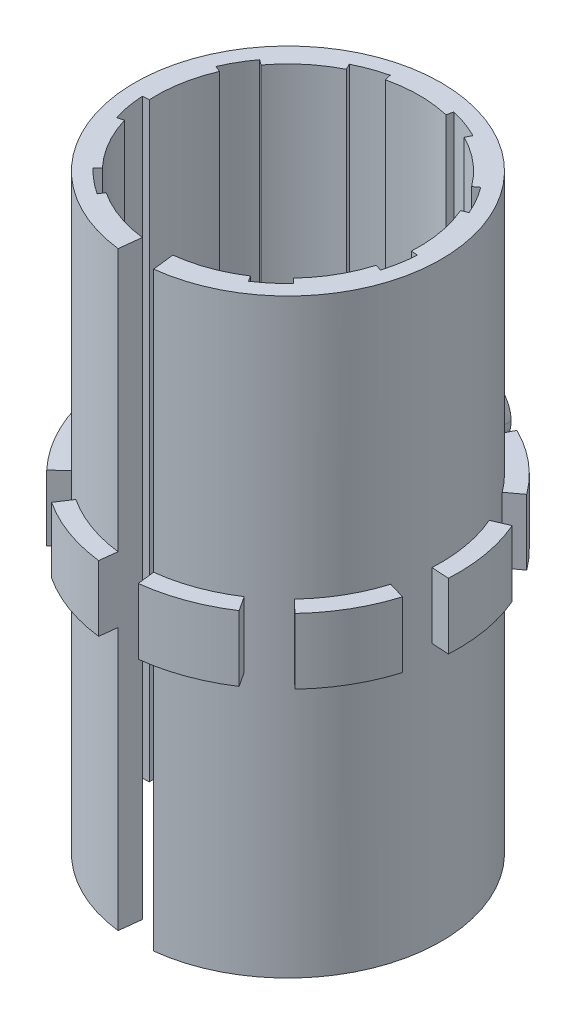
ISO-10303-21;
HEADER;
FILE_DESCRIPTION(('STEP AP214'),'2;1');
FILE_NAME('part.step','',(''),(''),'','','');
FILE_SCHEMA(('AUTOMOTIVE_DESIGN { 1 0 10303 214 1 1 1 1 }'));
ENDSEC;
DATA;
#1=APPLICATION_CONTEXT('core data for automotive mechanical design processes');
#2=APPLICATION_PROTOCOL_DEFINITION('international standard','automotive_design',2000,#1);
#3=PRODUCT_CONTEXT('',#1,'mechanical');
#4=PRODUCT('Part','Part','',(#3));
#5=PRODUCT_RELATED_PRODUCT_CATEGORY('part','',(#4));
#6=PRODUCT_DEFINITION_FORMATION('','',#4);
#7=PRODUCT_DEFINITION_CONTEXT('part definition',#1,'design');
#8=PRODUCT_DEFINITION('design','',#6,#7);
#9=PRODUCT_DEFINITION_SHAPE('','',#8);
#10=(LENGTH_UNIT() NAMED_UNIT(*) SI_UNIT(.MILLI.,.METRE.));
#11=(NAMED_UNIT(*) PLANE_ANGLE_UNIT() SI_UNIT($,.RADIAN.));
#12=(NAMED_UNIT(*) SI_UNIT($,.STERADIAN.) SOLID_ANGLE_UNIT());
#13=UNCERTAINTY_MEASURE_WITH_UNIT(LENGTH_MEASURE(1.E-05),#10,'distance_accuracy_value','');
#14=(GEOMETRIC_REPRESENTATION_CONTEXT(3) GLOBAL_UNCERTAINTY_ASSIGNED_CONTEXT((#13)) GLOBAL_UNIT_ASSIGNED_CONTEXT((#10,
#11,#12)) REPRESENTATION_CONTEXT('',''));
#15=CARTESIAN_POINT('',(0.,0.,0.));
#16=DIRECTION('',(0.,0.,1.));
#17=DIRECTION('',(1.,0.,0.));
#18=AXIS2_PLACEMENT_3D('',#15,#16,#17);
#19=CARTESIAN_POINT('',(-7.91207377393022E-12,-13.4999999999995,8.69746982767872E-12));
#20=DIRECTION('',(0.,1.,0.));
#21=DIRECTION('',(0.,0.,1.));
#22=AXIS2_PLACEMENT_3D('',#19,#20,#21);
#23=CYLINDRICAL_SURFACE('',#22,6.29999999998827);
#24=CARTESIAN_POINT('',(-7.91207377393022E-12,-13.4999999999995,8.69746982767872E-12));
#25=DIRECTION('',(0.,1.,0.));
#26=DIRECTION('',(0.,0.,1.));
#27=AXIS2_PLACEMENT_3D('',#24,#25,#26);
#28=CIRCLE('',#27,6.29999999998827);
#29=CARTESIAN_POINT('',(-3.46190656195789,-13.4999999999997,5.2635732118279));
#30=VERTEX_POINT('',#29);
#31=CARTESIAN_POINT('',(-4.58245394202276,-13.4999999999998,4.32332231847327));
#32=VERTEX_POINT('',#31);
#33=EDGE_CURVE('E485',#30,#32,#28,.F.);
#34=ORIENTED_EDGE('',*,*,#33,.T.);
#35=DIRECTION('',(0.,-1.,0.));
#36=VECTOR('',#35,1.);
#37=CARTESIAN_POINT('',(-4.58245394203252,-13.5,4.32332231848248));
#38=LINE('',#37,#36);
#39=CARTESIAN_POINT('',(-4.58245394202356,13.5000000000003,4.32332231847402));
#40=VERTEX_POINT('',#39);
#41=EDGE_CURVE('E483',#40,#32,#38,.T.);
#42=ORIENTED_EDGE('',*,*,#41,.F.);
#43=CARTESIAN_POINT('',(-9.41798359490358E-12,13.5000000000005,1.02936025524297E-11));
#44=DIRECTION('',(0.,1.,0.));
#45=DIRECTION('',(0.,0.,1.));
#46=AXIS2_PLACEMENT_3D('',#43,#44,#45);
#47=CIRCLE('',#46,6.29999999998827);
#48=CARTESIAN_POINT('',(-3.46190656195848,13.5000000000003,5.2635732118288));
#49=VERTEX_POINT('',#48);
#50=EDGE_CURVE('E21',#40,#49,#47,.T.);
#51=ORIENTED_EDGE('',*,*,#50,.T.);
#52=DIRECTION('',(0.,1.,0.));
#53=VECTOR('',#52,1.);
#54=CARTESIAN_POINT('',(-3.46190656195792,-13.5,5.26357321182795));
#55=LINE('',#54,#53);
#56=EDGE_CURVE('E480',#30,#49,#55,.T.);
#57=ORIENTED_EDGE('',*,*,#56,.F.);
#58=EDGE_LOOP('',(#34,#42,#51,#57));
#59=FACE_BOUND('',#58,.T.);
#60=ADVANCED_FACE('F17',(#59),#23,.F.);
#61=CARTESIAN_POINT('',(-3.47204903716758E-12,-13.4999999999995,2.3521766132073E-13));
#62=DIRECTION('',(0.,1.,0.));
#63=DIRECTION('',(-1.,0.,0.));
#64=AXIS2_PLACEMENT_3D('',#61,#62,#63);
#65=CYLINDRICAL_SURFACE('',#64,6.29999999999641);
#66=CARTESIAN_POINT('',(-3.47204903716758E-12,-13.4999999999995,2.3521766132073E-13));
#67=DIRECTION('',(0.,1.,0.));
#68=DIRECTION('',(-1.,0.,0.));
#69=AXIS2_PLACEMENT_3D('',#66,#67,#68);
#70=CIRCLE('',#69,6.29999999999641);
#71=CARTESIAN_POINT('',(-6.03533392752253,-13.4999999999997,1.80686036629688));
#72=VERTEX_POINT('',#71);
#73=CARTESIAN_POINT('',(-6.28934139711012,-13.4999999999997,0.366312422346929));
#74=VERTEX_POINT('',#73);
#75=EDGE_CURVE('E1139',#72,#74,#70,.F.);
#76=ORIENTED_EDGE('',*,*,#75,.T.);
#77=DIRECTION('',(0.,-1.,0.));
#78=VECTOR('',#77,1.);
#79=CARTESIAN_POINT('',(-6.28934139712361,-13.5,0.366312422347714));
#80=LINE('',#79,#78);
#81=CARTESIAN_POINT('',(-6.28934139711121,13.5000000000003,0.366312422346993));
#82=VERTEX_POINT('',#81);
#83=EDGE_CURVE('E509',#82,#74,#80,.T.);
#84=ORIENTED_EDGE('',*,*,#83,.F.);
#85=CARTESIAN_POINT('',(-5.65161722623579E-12,13.5000000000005,4.89946091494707E-13));
#86=DIRECTION('',(0.,1.,0.));
#87=DIRECTION('',(-1.,0.,0.));
#88=AXIS2_PLACEMENT_3D('',#85,#86,#87);
#89=CIRCLE('',#88,6.29999999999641);
#90=CARTESIAN_POINT('',(-6.03533392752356,13.5000000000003,1.80686036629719));
#91=VERTEX_POINT('',#90);
#92=EDGE_CURVE('E1150',#82,#91,#89,.T.);
#93=ORIENTED_EDGE('',*,*,#92,.T.);
#94=DIRECTION('',(0.,1.,0.));
#95=VECTOR('',#94,1.);
#96=CARTESIAN_POINT('',(-6.03533392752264,-13.5,1.80686036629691));
#97=LINE('',#96,#95);
#98=EDGE_CURVE('E1092',#72,#91,#97,.T.);
#99=ORIENTED_EDGE('',*,*,#98,.F.);
#100=EDGE_LOOP('',(#76,#84,#93,#99));
#101=FACE_BOUND('',#100,.T.);
#102=ADVANCED_FACE('F1147',(#101),#65,.F.);
#103=CARTESIAN_POINT('',(37.617233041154,27.330983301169,-2.1909543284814));
#104=DIRECTION('',(0.0581448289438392,0.,0.998308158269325));
#105=DIRECTION('',(-0.998308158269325,0.,0.0581448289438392));
#106=AXIS2_PLACEMENT_3D('',#103,#104,#105);
#107=PLANE('',#106);
#108=ORIENTED_EDGE('',*,*,#83,.T.);
#109=DIRECTION('',(0.998308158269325,0.,-0.0581448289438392));
#110=VECTOR('',#109,1.);
#111=CARTESIAN_POINT('',(-3.144670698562,-13.5,0.18315621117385));
#112=LINE('',#111,#110);
#113=CARTESIAN_POINT('',(-5.98984894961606,-13.5,0.348868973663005));
#114=VERTEX_POINT('',#113);
#115=EDGE_CURVE('E511',#74,#114,#112,.T.);
#116=ORIENTED_EDGE('',*,*,#115,.T.);
#117=DIRECTION('',(0.,1.,0.));
#118=VECTOR('',#117,1.);
#119=CARTESIAN_POINT('',(-5.98984894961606,-13.5,0.348868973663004));
#120=LINE('',#119,#118);
#121=CARTESIAN_POINT('',(-5.98984894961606,13.5,0.348868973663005));
#122=VERTEX_POINT('',#121);
#123=EDGE_CURVE('E1087',#122,#114,#120,.F.);
#124=ORIENTED_EDGE('',*,*,#123,.F.);
#125=DIRECTION('',(-0.998308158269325,0.,0.0581448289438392));
#126=VECTOR('',#125,1.);
#127=CARTESIAN_POINT('',(-3.144670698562,13.5,0.18315621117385));
#128=LINE('',#127,#126);
#129=EDGE_CURVE('E512',#122,#82,#128,.T.);
#130=ORIENTED_EDGE('',*,*,#129,.T.);
#131=EDGE_LOOP('',(#108,#116,#124,#130));
#132=FACE_BOUND('',#131,.T.);
#133=ADVANCED_FACE('F2180',(#132),#107,.T.);
#134=CARTESIAN_POINT('',(-1.06121708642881E-12,-13.4999999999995,-4.15466272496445E-13));
#135=DIRECTION('',(0.,1.,0.));
#136=DIRECTION('',(-1.,0.,0.));
#137=AXIS2_PLACEMENT_3D('',#134,#135,#136);
#138=CYLINDRICAL_SURFACE('',#137,6.2999999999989);
#139=CARTESIAN_POINT('',(-1.06121708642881E-12,-13.4999999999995,-4.15466272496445E-13));
#140=DIRECTION('',(0.,1.,0.));
#141=DIRECTION('',(-1.,0.,0.));
#142=AXIS2_PLACEMENT_3D('',#139,#140,#141);
#143=CIRCLE('',#142,6.2999999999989);
#144=CARTESIAN_POINT('',(-5.78476147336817,-13.4999999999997,-2.49530252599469));
#145=VERTEX_POINT('',#144);
#146=CARTESIAN_POINT('',(-5.05337611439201,-13.4999999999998,-3.7620991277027));
#147=VERTEX_POINT('',#146);
#148=EDGE_CURVE('E1223',#145,#147,#143,.F.);
#149=ORIENTED_EDGE('',*,*,#148,.T.);
#150=DIRECTION('',(0.,-1.,0.));
#151=VECTOR('',#150,1.);
#152=CARTESIAN_POINT('',(-5.05337611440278,-13.5,-3.76209912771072));
#153=LINE('',#152,#151);
#154=CARTESIAN_POINT('',(-5.05337611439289,13.5000000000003,-3.76209912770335));
#155=VERTEX_POINT('',#154);
#156=EDGE_CURVE('E1074',#155,#147,#153,.T.);
#157=ORIENTED_EDGE('',*,*,#156,.F.);
#158=CARTESIAN_POINT('',(-2.89459946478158E-12,13.5000000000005,-1.62133240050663E-12));
#159=DIRECTION('',(0.,1.,0.));
#160=DIRECTION('',(-1.,0.,0.));
#161=AXIS2_PLACEMENT_3D('',#158,#159,#160);
#162=CIRCLE('',#161,6.2999999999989);
#163=CARTESIAN_POINT('',(-5.78476147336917,13.5000000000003,-2.49530252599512));
#164=VERTEX_POINT('',#163);
#165=EDGE_CURVE('E1137',#155,#164,#162,.T.);
#166=ORIENTED_EDGE('',*,*,#165,.T.);
#167=DIRECTION('',(0.,1.,0.));
#168=VECTOR('',#167,1.);
#169=CARTESIAN_POINT('',(-5.78476147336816,-13.5,-2.49530252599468));
#170=LINE('',#169,#168);
#171=EDGE_CURVE('E1086',#145,#164,#170,.T.);
#172=ORIENTED_EDGE('',*,*,#171,.F.);
#173=EDGE_LOOP('',(#149,#157,#166,#172));
#174=FACE_BOUND('',#173,.T.);
#175=ADVANCED_FACE('F1229',(#174),#138,.F.);
#176=CARTESIAN_POINT('',(-4.86069517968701E-12,-13.4999999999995,-1.69608251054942E-11));
#177=DIRECTION('',(0.,1.,0.));
#178=DIRECTION('',(0.,0.,1.));
#179=AXIS2_PLACEMENT_3D('',#176,#177,#178);
#180=CYLINDRICAL_SURFACE('',#179,6.29999999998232);
#181=CARTESIAN_POINT('',(-4.86069517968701E-12,-13.4999999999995,-1.69608251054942E-11));
#182=DIRECTION('',(0.,1.,0.));
#183=DIRECTION('',(0.,0.,1.));
#184=AXIS2_PLACEMENT_3D('',#181,#182,#183);
#185=CIRCLE('',#184,6.29999999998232);
#186=CARTESIAN_POINT('',(-2.82743483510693,-13.4999999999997,-5.62988563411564));
#187=VERTEX_POINT('',#186);
#188=CARTESIAN_POINT('',(-1.45287998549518,-13.4999999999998,-6.13018268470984));
#189=VERTEX_POINT('',#188);
#190=EDGE_CURVE('E1220',#187,#189,#185,.F.);
#191=ORIENTED_EDGE('',*,*,#190,.T.);
#192=DIRECTION('',(0.,-1.,0.));
#193=VECTOR('',#192,1.);
#194=CARTESIAN_POINT('',(-1.45287998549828,-13.5,-6.13018268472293));
#195=LINE('',#194,#193);
#196=CARTESIAN_POINT('',(-1.45287998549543,13.5000000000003,-6.1301826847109));
#197=VERTEX_POINT('',#196);
#198=EDGE_CURVE('E1062',#197,#189,#195,.T.);
#199=ORIENTED_EDGE('',*,*,#198,.F.);
#200=CARTESIAN_POINT('',(-5.49003175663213E-12,13.5000000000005,-1.90630476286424E-11));
#201=DIRECTION('',(0.,1.,0.));
#202=DIRECTION('',(0.,0.,1.));
#203=AXIS2_PLACEMENT_3D('',#200,#201,#202);
#204=CIRCLE('',#203,6.29999999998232);
#205=CARTESIAN_POINT('',(-2.82743483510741,13.5000000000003,-5.62988563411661));
#206=VERTEX_POINT('',#205);
#207=EDGE_CURVE('E1222',#197,#206,#204,.T.);
#208=ORIENTED_EDGE('',*,*,#207,.T.);
#209=DIRECTION('',(0.,1.,0.));
#210=VECTOR('',#209,1.);
#211=CARTESIAN_POINT('',(-2.827434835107,-13.5,-5.62988563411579));
#212=LINE('',#211,#210);
#213=EDGE_CURVE('E1080',#187,#206,#212,.T.);
#214=ORIENTED_EDGE('',*,*,#213,.F.);
#215=EDGE_LOOP('',(#191,#199,#208,#214));
#216=FACE_BOUND('',#215,.T.);
#217=ADVANCED_FACE('F1247',(#216),#180,.F.);
#218=CARTESIAN_POINT('',(7.38558519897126E-13,-13.4999999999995,-1.23468943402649E-12));
#219=DIRECTION('',(0.,1.,0.));
#220=DIRECTION('',(0.,0.,1.));
#221=AXIS2_PLACEMENT_3D('',#218,#219,#220);
#222=CYLINDRICAL_SURFACE('',#221,6.29999999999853);
#223=CARTESIAN_POINT('',(7.38558519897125E-13,-13.4999999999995,-1.23468943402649E-12));
#224=DIRECTION('',(0.,1.,0.));
#225=DIRECTION('',(0.,0.,1.));
#226=AXIS2_PLACEMENT_3D('',#223,#224,#225);
#227=CIRCLE('',#226,6.29999999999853);
#228=CARTESIAN_POINT('',(1.45287998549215,-13.4999999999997,-6.13018268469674));
#229=VERTEX_POINT('',#228);
#230=CARTESIAN_POINT('',(2.82743483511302,-13.4999999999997,-5.62988563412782));
#231=VERTEX_POINT('',#230);
#232=EDGE_CURVE('E1120',#229,#231,#227,.F.);
#233=ORIENTED_EDGE('',*,*,#232,.T.);
#234=DIRECTION('',(0.,-1.,0.));
#235=VECTOR('',#234,1.);
#236=CARTESIAN_POINT('',(2.82743483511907,-13.5,-5.62988563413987));
#237=LINE('',#236,#235);
#238=CARTESIAN_POINT('',(2.82743483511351,13.5000000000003,-5.6298856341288));
#239=VERTEX_POINT('',#238);
#240=EDGE_CURVE('E1049',#239,#231,#237,.T.);
#241=ORIENTED_EDGE('',*,*,#240,.F.);
#242=CARTESIAN_POINT('',(1.60774132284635E-12,13.5000000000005,-3.24961507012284E-12));
#243=DIRECTION('',(0.,1.,0.));
#244=DIRECTION('',(0.,0.,1.));
#245=AXIS2_PLACEMENT_3D('',#242,#243,#244);
#246=CIRCLE('',#245,6.29999999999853);
#247=CARTESIAN_POINT('',(1.4528799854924,13.5000000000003,-6.13018268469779));
#248=VERTEX_POINT('',#247);
#249=EDGE_CURVE('E1218',#239,#248,#246,.T.);
#250=ORIENTED_EDGE('',*,*,#249,.T.);
#251=DIRECTION('',(0.,1.,0.));
#252=VECTOR('',#251,1.);
#253=CARTESIAN_POINT('',(1.45287998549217,-13.5,-6.1301826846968));
#254=LINE('',#253,#252);
#255=EDGE_CURVE('E1068',#229,#248,#254,.T.);
#256=ORIENTED_EDGE('',*,*,#255,.F.);
#257=EDGE_LOOP('',(#233,#241,#250,#256));
#258=FACE_BOUND('',#257,.T.);
#259=ADVANCED_FACE('F1265',(#258),#222,.F.);
#260=CARTESIAN_POINT('',(43.906574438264,27.330983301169,2.5572667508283));
#261=DIRECTION('',(-0.0581448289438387,0.,0.998308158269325));
#262=DIRECTION('',(-0.998308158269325,0.,-0.0581448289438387));
#263=AXIS2_PLACEMENT_3D('',#260,#261,#262);
#264=PLANE('',#263);
#265=DIRECTION('',(0.,-1.,0.));
#266=VECTOR('',#265,1.);
#267=CARTESIAN_POINT('',(6.28934139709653,0.,0.366312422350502));
#268=LINE('',#267,#266);
#269=CARTESIAN_POINT('',(6.28934139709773,13.5000000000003,0.366312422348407));
#270=VERTEX_POINT('',#269);
#271=CARTESIAN_POINT('',(6.28934139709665,-13.4999999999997,0.366312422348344));
#272=VERTEX_POINT('',#271);
#273=EDGE_CURVE('E504',#270,#272,#268,.T.);
#274=ORIENTED_EDGE('',*,*,#273,.F.);
#275=DIRECTION('',(-0.998308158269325,0.,-0.0581448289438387));
#276=VECTOR('',#275,1.);
#277=CARTESIAN_POINT('',(3.1446706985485,13.5,0.1831562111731));
#278=LINE('',#277,#276);
#279=CARTESIAN_POINT('',(5.9898489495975,13.4999999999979,0.348868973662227));
#280=VERTEX_POINT('',#279);
#281=EDGE_CURVE('E1114',#270,#280,#278,.T.);
#282=ORIENTED_EDGE('',*,*,#281,.T.);
#283=DIRECTION('',(-6.83058293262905E-13,1.,0.));
#284=VECTOR('',#283,1.);
#285=CARTESIAN_POINT('',(5.98984894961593,-13.5,0.348868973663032));
#286=LINE('',#285,#284);
#287=CARTESIAN_POINT('',(5.98984894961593,-13.500000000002,0.348868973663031));
#288=VERTEX_POINT('',#287);
#289=EDGE_CURVE('E1044',#288,#280,#286,.T.);
#290=ORIENTED_EDGE('',*,*,#289,.F.);
#291=DIRECTION('',(0.998308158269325,0.,0.0581448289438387));
#292=VECTOR('',#291,1.);
#293=CARTESIAN_POINT('',(3.1446706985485,-13.5,0.1831562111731));
#294=LINE('',#293,#292);
#295=EDGE_CURVE('E1118',#288,#272,#294,.T.);
#296=ORIENTED_EDGE('',*,*,#295,.T.);
#297=EDGE_LOOP('',(#274,#282,#290,#296));
#298=FACE_BOUND('',#297,.T.);
#299=ADVANCED_FACE('F1291',(#298),#264,.T.);
#300=CARTESIAN_POINT('',(9.6034291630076E-12,-13.4999999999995,-5.38631639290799E-12));
#301=DIRECTION('',(0.,1.,0.));
#302=DIRECTION('',(-1.,0.,0.));
#303=AXIS2_PLACEMENT_3D('',#300,#301,#302);
#304=CYLINDRICAL_SURFACE('',#303,6.29999999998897);
#305=CARTESIAN_POINT('',(9.6034291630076E-12,-13.4999999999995,-5.38631639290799E-12));
#306=DIRECTION('',(0.,1.,0.));
#307=DIRECTION('',(-1.,0.,0.));
#308=AXIS2_PLACEMENT_3D('',#305,#306,#307);
#309=CIRCLE('',#308,6.29999999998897);
#310=CARTESIAN_POINT('',(5.05337611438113,-13.4999999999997,-3.76209912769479));
#311=VERTEX_POINT('',#310);
#312=CARTESIAN_POINT('',(5.78476147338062,-13.4999999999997,-2.49530252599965));
#313=VERTEX_POINT('',#312);
#314=EDGE_CURVE('E1214',#311,#313,#309,.F.);
#315=ORIENTED_EDGE('',*,*,#314,.T.);
#316=DIRECTION('',(0.,-1.,0.));
#317=VECTOR('',#316,1.);
#318=CARTESIAN_POINT('',(5.78476147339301,-13.5,-2.49530252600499));
#319=LINE('',#318,#317);
#320=CARTESIAN_POINT('',(5.78476147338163,13.5000000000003,-2.49530252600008));
#321=VERTEX_POINT('',#320);
#322=EDGE_CURVE('E1043',#321,#313,#319,.T.);
#323=ORIENTED_EDGE('',*,*,#322,.F.);
#324=CARTESIAN_POINT('',(1.15644310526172E-11,13.5000000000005,-6.37113904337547E-12));
#325=DIRECTION('',(0.,1.,0.));
#326=DIRECTION('',(-1.,0.,0.));
#327=AXIS2_PLACEMENT_3D('',#324,#325,#326);
#328=CIRCLE('',#327,6.29999999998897);
#329=CARTESIAN_POINT('',(5.053376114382,13.5000000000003,-3.76209912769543));
#330=VERTEX_POINT('',#329);
#331=EDGE_CURVE('E1117',#321,#330,#328,.T.);
#332=ORIENTED_EDGE('',*,*,#331,.T.);
#333=DIRECTION('',(0.,1.,0.));
#334=VECTOR('',#333,1.);
#335=CARTESIAN_POINT('',(5.0533761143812,-13.5,-3.76209912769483));
#336=LINE('',#335,#334);
#337=EDGE_CURVE('E1056',#311,#330,#336,.T.);
#338=ORIENTED_EDGE('',*,*,#337,.F.);
#339=EDGE_LOOP('',(#315,#323,#332,#338));
#340=FACE_BOUND('',#339,.T.);
#341=ADVANCED_FACE('F1280',(#340),#304,.F.);
#342=CARTESIAN_POINT('',(-1.12583553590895E-12,-13.4999999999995,-3.17020715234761E-13));
#343=DIRECTION('',(0.,1.,0.));
#344=DIRECTION('',(-1.,0.,0.));
#345=AXIS2_PLACEMENT_3D('',#342,#343,#344);
#346=CYLINDRICAL_SURFACE('',#345,6.30000000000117);
#347=CARTESIAN_POINT('',(-1.12583553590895E-12,-13.4999999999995,-3.17020715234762E-13));
#348=DIRECTION('',(0.,1.,0.));
#349=DIRECTION('',(-1.,0.,0.));
#350=AXIS2_PLACEMENT_3D('',#347,#348,#349);
#351=CIRCLE('',#350,6.30000000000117);
#352=CARTESIAN_POINT('',(6.03533392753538,-13.4999999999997,1.80686036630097));
#353=VERTEX_POINT('',#352);
#354=EDGE_CURVE('E507',#272,#353,#351,.F.);
#355=ORIENTED_EDGE('',*,*,#354,.T.);
#356=DIRECTION('',(0.,-1.,0.));
#357=VECTOR('',#356,1.);
#358=CARTESIAN_POINT('',(6.03533392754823,-13.5,1.80686036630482));
#359=LINE('',#358,#357);
#360=CARTESIAN_POINT('',(6.03533392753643,13.5000000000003,1.80686036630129));
#361=VERTEX_POINT('',#360);
#362=EDGE_CURVE('E1037',#361,#353,#359,.T.);
#363=ORIENTED_EDGE('',*,*,#362,.F.);
#364=CARTESIAN_POINT('',(1.00941086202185E-12,13.5000000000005,1.89069083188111E-13));
#365=DIRECTION('',(0.,1.,0.));
#366=DIRECTION('',(-1.,0.,0.));
#367=AXIS2_PLACEMENT_3D('',#364,#365,#366);
#368=CIRCLE('',#367,6.30000000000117);
#369=EDGE_CURVE('E508',#361,#270,#368,.T.);
#370=ORIENTED_EDGE('',*,*,#369,.T.);
#371=ORIENTED_EDGE('',*,*,#273,.T.);
#372=EDGE_LOOP('',(#355,#363,#370,#371));
#373=FACE_BOUND('',#372,.T.);
#374=ADVANCED_FACE('F2132',(#373),#346,.F.);
#375=CARTESIAN_POINT('',(4.46387718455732E-12,-13.4999999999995,5.4075667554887E-12));
#376=DIRECTION('',(0.,1.,0.));
#377=DIRECTION('',(0.,0.,1.));
#378=AXIS2_PLACEMENT_3D('',#375,#376,#377);
#379=CYLINDRICAL_SURFACE('',#378,6.29999999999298);
#380=CARTESIAN_POINT('',(4.46387718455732E-12,-13.4999999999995,5.4075667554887E-12));
#381=DIRECTION('',(0.,1.,0.));
#382=DIRECTION('',(0.,0.,1.));
#383=AXIS2_PLACEMENT_3D('',#380,#381,#382);
#384=CIRCLE('',#383,6.29999999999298);
#385=CARTESIAN_POINT('',(4.58245394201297,-13.4999999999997,4.32332231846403));
#386=VERTEX_POINT('',#385);
#387=CARTESIAN_POINT('',(3.46190656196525,-13.4999999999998,5.26357321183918));
#388=VERTEX_POINT('',#387);
#389=EDGE_CURVE('E499',#386,#388,#384,.F.);
#390=ORIENTED_EDGE('',*,*,#389,.T.);
#391=DIRECTION('',(0.,-1.,0.));
#392=VECTOR('',#391,1.);
#393=CARTESIAN_POINT('',(3.46190656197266,-13.5,5.26357321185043));
#394=LINE('',#393,#392);
#395=CARTESIAN_POINT('',(3.46190656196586,13.5000000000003,5.26357321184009));
#396=VERTEX_POINT('',#395);
#397=EDGE_CURVE('E1024',#396,#388,#394,.T.);
#398=ORIENTED_EDGE('',*,*,#397,.F.);
#399=CARTESIAN_POINT('',(5.77426257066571E-12,13.5000000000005,7.16776396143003E-12));
#400=DIRECTION('',(0.,1.,0.));
#401=DIRECTION('',(0.,0.,1.));
#402=AXIS2_PLACEMENT_3D('',#399,#400,#401);
#403=CIRCLE('',#402,6.29999999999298);
#404=CARTESIAN_POINT('',(4.58245394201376,13.5000000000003,4.32332231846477));
#405=VERTEX_POINT('',#404);
#406=EDGE_CURVE('E1204',#396,#405,#403,.T.);
#407=ORIENTED_EDGE('',*,*,#406,.T.);
#408=DIRECTION('',(0.,1.,0.));
#409=VECTOR('',#408,1.);
#410=CARTESIAN_POINT('',(4.58245394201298,-13.5,4.32332231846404));
#411=LINE('',#410,#409);
#412=EDGE_CURVE('E1031',#386,#405,#411,.T.);
#413=ORIENTED_EDGE('',*,*,#412,.F.);
#414=EDGE_LOOP('',(#390,#398,#407,#413));
#415=FACE_BOUND('',#414,.T.);
#416=ADVANCED_FACE('F1203',(#415),#379,.F.);
#417=CARTESIAN_POINT('',(4.2426406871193,-4.2426406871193,-8.7));
#418=DIRECTION('',(0.,0.,-1.));
#419=DIRECTION('',(-1.,0.,0.));
#420=AXIS2_PLACEMENT_3D('',#417,#418,#419);
#421=PLANE('',#420);
#422=CARTESIAN_POINT('',(0.,0.,-8.7));
#423=DIRECTION('',(0.,0.,1.));
#424=DIRECTION('',(1.,0.,0.));
#425=AXIS2_PLACEMENT_3D('',#422,#423,#424);
#426=CIRCLE('',#425,1.50000000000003);
#427=CARTESIAN_POINT('',(-1.49999999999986,-4.80324947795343E-07,-8.7));
#428=VERTEX_POINT('',#427);
#429=CARTESIAN_POINT('',(1.50000000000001,-5.98081649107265E-08,-8.7));
#430=VERTEX_POINT('',#429);
#431=EDGE_CURVE('E1011',#428,#430,#426,.T.);
#432=ORIENTED_EDGE('',*,*,#431,.F.);
#433=CARTESIAN_POINT('',(1.5,-1.19616378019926E-07,-8.7));
#434=CARTESIAN_POINT('',(1.50000012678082,0.0445453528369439,-8.7));
#435=CARTESIAN_POINT('',(1.49801450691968,0.0890678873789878,-8.7));
#436=CARTESIAN_POINT('',(1.49009595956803,0.177757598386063,-8.7));
#437=CARTESIAN_POINT('',(1.48416328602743,0.221924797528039,-8.7));
#438=CARTESIAN_POINT('',(1.46051590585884,0.353241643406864,-8.7));
#439=CARTESIAN_POINT('',(1.43695158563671,0.439408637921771,-8.7));
#440=CARTESIAN_POINT('',(1.37653730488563,0.60188898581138,-8.7));
#441=CARTESIAN_POINT('',(1.34043354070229,0.678481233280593,-8.7));
#442=CARTESIAN_POINT('',(1.27708536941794,0.787930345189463,-8.7));
#443=CARTESIAN_POINT('',(1.25443563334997,0.823508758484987,-8.7));
#444=CARTESIAN_POINT('',(1.20620186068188,0.892668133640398,-8.7));
#445=CARTESIAN_POINT('',(1.18061501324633,0.926247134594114,-8.7));
#446=CARTESIAN_POINT('',(1.09976723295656,1.02352694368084,-8.7));
#447=CARTESIAN_POINT('',(1.04036651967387,1.08386113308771,-8.7));
#448=CARTESIAN_POINT('',(0.912268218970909,1.19368526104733,-8.7));
#449=CARTESIAN_POINT('',(0.843570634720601,1.24317520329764,-8.7));
#450=CARTESIAN_POINT('',(0.735078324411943,1.30822237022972,-8.7));
#451=CARTESIAN_POINT('',(0.697978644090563,1.32838437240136,-8.7));
#452=CARTESIAN_POINT('',(0.622251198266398,1.36549631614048,-8.7));
#453=CARTESIAN_POINT('',(0.583624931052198,1.38244931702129,-8.7));
#454=CARTESIAN_POINT('',(0.465785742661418,1.42833338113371,-8.7));
#455=CARTESIAN_POINT('',(0.38457726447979,1.45231054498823,-8.7));
#456=CARTESIAN_POINT('',(0.219327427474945,1.48627740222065,-8.7));
#457=CARTESIAN_POINT('',(0.135286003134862,1.4962667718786,-8.7));
#458=CARTESIAN_POINT('',(-0.0332937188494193,1.50199898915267,-8.7));
#459=CARTESIAN_POINT('',(-0.117832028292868,1.49774149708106,-8.7));
#460=CARTESIAN_POINT('',(-0.284992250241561,1.47509092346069,-8.7));
#461=CARTESIAN_POINT('',(-0.367614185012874,1.45669800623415,-8.7));
#462=CARTESIAN_POINT('',(-0.528589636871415,1.40631067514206,-8.7));
#463=CARTESIAN_POINT('',(-0.606943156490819,1.3743162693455,-8.7));
#464=CARTESIAN_POINT('',(-0.757200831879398,1.29759525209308,-8.7));
#465=CARTESIAN_POINT('',(-0.829104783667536,1.25286823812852,-8.7));
#466=CARTESIAN_POINT('',(-0.930485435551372,1.17727684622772,-8.7));
#467=CARTESIAN_POINT('',(-0.96320484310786,1.15065759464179,-8.7));
#468=CARTESIAN_POINT('',(-1.02632092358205,1.09473484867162,-8.7));
#469=CARTESIAN_POINT('',(-1.05671532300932,1.06542878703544,-8.7));
#470=CARTESIAN_POINT('',(-1.14398459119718,0.973855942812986,-8.7));
#471=CARTESIAN_POINT('',(-1.19703581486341,0.907867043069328,-8.7));
#472=CARTESIAN_POINT('',(-1.29128822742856,0.767914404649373,-8.7));
#473=CARTESIAN_POINT('',(-1.33248990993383,0.693950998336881,-8.69999999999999));
#474=CARTESIAN_POINT('',(-1.38454996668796,0.578627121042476,-8.7));
#475=CARTESIAN_POINT('',(-1.4002913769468,0.539410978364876,-8.7));
#476=CARTESIAN_POINT('',(-1.42840350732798,0.459831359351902,-8.7));
#477=CARTESIAN_POINT('',(-1.44077691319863,0.419468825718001,-8.69999999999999));
#478=CARTESIAN_POINT('',(-1.47268389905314,0.297114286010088,-8.70000000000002));
#479=CARTESIAN_POINT('',(-1.48708232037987,0.213682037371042,-8.70000000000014));
#480=CARTESIAN_POINT('',(-1.49625149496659,0.108193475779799,-8.69999999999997));
#481=CARTESIAN_POINT('',(-1.4976578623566,0.0865618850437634,-8.69999999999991));
#482=CARTESIAN_POINT('',(-1.49953055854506,0.0432902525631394,-8.70000000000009));
#483=CARTESIAN_POINT('',(-1.49999828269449,0.0216502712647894,-8.70000000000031));
#484=CARTESIAN_POINT('',(-1.5,-1.92129865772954E-07,-8.70000000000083));
#485=B_SPLINE_CURVE_WITH_KNOTS('',3,(#433,#434,#435,#436,#437,#438,#439,#440,#441,#442,#443,
#444,#445,#446,#447,#448,#449,#450,#451,#452,#453,#454,#455,#456,#457,#458,#459,#460,#461,#462,
#463,#464,#465,#466,#467,#468,#469,#470,#471,#472,#473,#474,#475,#476,#477,#478,#479,#480,#481,
#482,#483,#484),.UNSPECIFIED.,.F.,.F.,(4,2,2,2,2,2,2,2,2,2,2,2,2,2,2,2,2,2,2,2,2,2,2,2,2,4),(0.,
0.133546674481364,0.267084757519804,0.533563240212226,0.786326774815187,0.912723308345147,
1.03924182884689,1.29196876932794,1.54469562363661,1.67123658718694,1.79765629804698,
2.05037433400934,2.30309821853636,2.55582812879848,2.80855510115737,3.06128192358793,
3.31401673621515,3.44042762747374,3.56696058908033,3.8196927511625,4.07241438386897,
4.19905103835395,4.32558641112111,4.57809365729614,4.64311575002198,4.70804111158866),.UNSPECIFIED.);
#486=EDGE_CURVE('E1007',#430,#428,#485,.T.);
#487=ORIENTED_EDGE('',*,*,#486,.F.);
#488=EDGE_LOOP('',(#432,#487));
#489=FACE_BOUND('',#488,.T.);
#490=ADVANCED_FACE('F1303',(#489),#421,.T.);
#491=CARTESIAN_POINT('',(-4.51353364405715E-13,-1.50000000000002,8.34401991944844E-13));
#492=DIRECTION('',(0.,1.,0.));
#493=DIRECTION('',(0.,0.,1.));
#494=AXIS2_PLACEMENT_3D('',#491,#492,#493);
#495=CYLINDRICAL_SURFACE('',#494,7.79999999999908);
#496=CARTESIAN_POINT('',(-4.51353364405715E-13,-1.50000000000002,8.34401991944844E-13));
#497=DIRECTION('',(0.,1.,0.));
#498=DIRECTION('',(0.,0.,1.));
#499=AXIS2_PLACEMENT_3D('',#496,#497,#498);
#500=CIRCLE('',#499,7.79999999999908);
#501=CARTESIAN_POINT('',(-0.905524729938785,-1.50000000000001,7.74725919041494));
#502=VERTEX_POINT('',#501);
#503=CARTESIAN_POINT('',(-4.28617002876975,-1.50000000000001,6.51680492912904));
#504=VERTEX_POINT('',#503);
#505=EDGE_CURVE('E996',#502,#504,#500,.F.);
#506=ORIENTED_EDGE('',*,*,#505,.F.);
#507=DIRECTION('',(0.,-1.,0.));
#508=VECTOR('',#507,1.);
#509=CARTESIAN_POINT('',(-0.905524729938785,-1.5,7.74725919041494));
#510=LINE('',#509,#508);
#511=CARTESIAN_POINT('',(-0.905524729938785,1.49999999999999,7.74725919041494));
#512=VERTEX_POINT('',#511);
#513=EDGE_CURVE('E988',#512,#502,#510,.T.);
#514=ORIENTED_EDGE('',*,*,#513,.F.);
#515=CARTESIAN_POINT('',(-4.49936216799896E-13,1.49999999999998,8.28422338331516E-13));
#516=DIRECTION('',(0.,1.,0.));
#517=DIRECTION('',(0.,0.,1.));
#518=AXIS2_PLACEMENT_3D('',#515,#516,#517);
#519=CIRCLE('',#518,7.79999999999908);
#520=CARTESIAN_POINT('',(-4.28617002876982,1.49999999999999,6.51680492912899));
#521=VERTEX_POINT('',#520);
#522=EDGE_CURVE('E989',#521,#512,#519,.T.);
#523=ORIENTED_EDGE('',*,*,#522,.F.);
#524=DIRECTION('',(0.,1.,0.));
#525=VECTOR('',#524,1.);
#526=CARTESIAN_POINT('',(-4.28617002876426,-1.5,6.51680492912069));
#527=LINE('',#526,#525);
#528=EDGE_CURVE('E995',#504,#521,#527,.T.);
#529=ORIENTED_EDGE('',*,*,#528,.F.);
#530=EDGE_LOOP('',(#506,#514,#523,#529));
#531=FACE_BOUND('',#530,.T.);
#532=ADVANCED_FACE('F1308',(#531),#495,.T.);
#533=CARTESIAN_POINT('',(-4.79000519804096E-12,-1.50000000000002,3.44949763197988E-12));
#534=DIRECTION('',(0.,1.,0.));
#535=DIRECTION('',(-1.,0.,0.));
#536=AXIS2_PLACEMENT_3D('',#533,#534,#535);
#537=CYLINDRICAL_SURFACE('',#536,7.79999999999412);
#538=CARTESIAN_POINT('',(-4.79000519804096E-12,-1.50000000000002,3.44949763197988E-12));
#539=DIRECTION('',(0.,1.,0.));
#540=DIRECTION('',(-1.,0.,0.));
#541=AXIS2_PLACEMENT_3D('',#538,#539,#540);
#542=CIRCLE('',#541,7.79999999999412);
#543=CARTESIAN_POINT('',(-5.67351440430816,-1.50000000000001,5.35268477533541));
#544=VERTEX_POINT('',#543);
#545=CARTESIAN_POINT('',(-7.47231819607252,-1.50000000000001,2.2370652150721));
#546=VERTEX_POINT('',#545);
#547=EDGE_CURVE('E967',#544,#546,#542,.F.);
#548=ORIENTED_EDGE('',*,*,#547,.F.);
#549=DIRECTION('',(0.,-1.,0.));
#550=VECTOR('',#549,1.);
#551=CARTESIAN_POINT('',(-5.67351440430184,-1.5,5.35268477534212));
#552=LINE('',#551,#550);
#553=CARTESIAN_POINT('',(-5.67351440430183,1.49999999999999,5.35268477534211));
#554=VERTEX_POINT('',#553);
#555=EDGE_CURVE('E978',#554,#544,#552,.T.);
#556=ORIENTED_EDGE('',*,*,#555,.F.);
#557=CARTESIAN_POINT('',(-4.78507595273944E-12,1.49999999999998,3.44582787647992E-12));
#558=DIRECTION('',(0.,1.,0.));
#559=DIRECTION('',(-1.,0.,0.));
#560=AXIS2_PLACEMENT_3D('',#557,#558,#559);
#561=CIRCLE('',#560,7.79999999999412);
#562=CARTESIAN_POINT('',(-7.47231819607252,1.49999999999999,2.2370652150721));
#563=VERTEX_POINT('',#562);
#564=EDGE_CURVE('E979',#563,#554,#561,.T.);
#565=ORIENTED_EDGE('',*,*,#564,.F.);
#566=DIRECTION('',(0.,1.,0.));
#567=VECTOR('',#566,1.);
#568=CARTESIAN_POINT('',(-7.47231819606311,-1.5,2.23706521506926));
#569=LINE('',#568,#567);
#570=EDGE_CURVE('E983',#546,#563,#569,.T.);
#571=ORIENTED_EDGE('',*,*,#570,.F.);
#572=EDGE_LOOP('',(#548,#556,#565,#571));
#573=FACE_BOUND('',#572,.T.);
#574=ADVANCED_FACE('F1313',(#573),#537,.T.);
#575=CARTESIAN_POINT('',(-24.167945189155,27.330983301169,36.745575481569));
#576=DIRECTION('',(-0.835487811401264,0.,-0.549508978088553));
#577=DIRECTION('',(0.549508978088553,0.,-0.835487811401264));
#578=AXIS2_PLACEMENT_3D('',#575,#576,#577);
#579=PLANE('',#578);
#580=ORIENTED_EDGE('',*,*,#56,.T.);
#581=DIRECTION('',(0.549508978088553,0.,-0.835487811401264));
#582=VECTOR('',#581,1.);
#583=CARTESIAN_POINT('',(-1.730953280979,13.5,2.631786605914));
#584=LINE('',#583,#582);
#585=CARTESIAN_POINT('',(-3.29705386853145,13.5000000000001,5.01292686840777));
#586=VERTEX_POINT('',#585);
#587=EDGE_CURVE('E487',#49,#586,#584,.T.);
#588=ORIENTED_EDGE('',*,*,#587,.T.);
#589=DIRECTION('',(0.,1.,0.));
#590=VECTOR('',#589,1.);
#591=CARTESIAN_POINT('',(-3.29705386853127,0.,5.01292686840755));
#592=LINE('',#591,#590);
#593=CARTESIAN_POINT('',(-3.29705386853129,-13.4999999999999,5.01292686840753));
#594=VERTEX_POINT('',#593);
#595=EDGE_CURVE('E963',#594,#586,#592,.T.);
#596=ORIENTED_EDGE('',*,*,#595,.F.);
#597=DIRECTION('',(-0.549508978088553,0.,0.835487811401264));
#598=VECTOR('',#597,1.);
#599=CARTESIAN_POINT('',(-1.730953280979,-13.5,2.631786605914));
#600=LINE('',#599,#598);
#601=EDGE_CURVE('E497',#594,#30,#600,.T.);
#602=ORIENTED_EDGE('',*,*,#601,.T.);
#603=EDGE_LOOP('',(#580,#588,#596,#602));
#604=FACE_BOUND('',#603,.T.);
#605=ADVANCED_FACE('F496',(#604),#579,.T.);
#606=CARTESIAN_POINT('',(27.40815404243,27.330983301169,-25.858259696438));
#607=DIRECTION('',(0.686241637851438,0.,0.727373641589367));
#608=DIRECTION('',(-0.727373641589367,0.,0.686241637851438));
#609=AXIS2_PLACEMENT_3D('',#606,#607,#608);
#610=PLANE('',#609);
#611=ORIENTED_EDGE('',*,*,#41,.T.);
#612=DIRECTION('',(0.727373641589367,0.,-0.686241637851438));
#613=VECTOR('',#612,1.);
#614=CARTESIAN_POINT('',(-2.291226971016,-13.5,2.161661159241));
#615=LINE('',#614,#613);
#616=CARTESIAN_POINT('',(-4.3642418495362,-13.4999999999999,4.11744982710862));
#617=VERTEX_POINT('',#616);
#618=EDGE_CURVE('E1093',#32,#617,#615,.T.);
#619=ORIENTED_EDGE('',*,*,#618,.T.);
#620=DIRECTION('',(0.,-1.,0.));
#621=VECTOR('',#620,1.);
#622=CARTESIAN_POINT('',(-4.36424184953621,0.,4.11744982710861));
#623=LINE('',#622,#621);
#624=CARTESIAN_POINT('',(-4.36424184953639,13.5000000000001,4.11744982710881));
#625=VERTEX_POINT('',#624);
#626=EDGE_CURVE('E960',#625,#617,#623,.T.);
#627=ORIENTED_EDGE('',*,*,#626,.F.);
#628=DIRECTION('',(-0.727373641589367,0.,0.686241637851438));
#629=VECTOR('',#628,1.);
#630=CARTESIAN_POINT('',(-2.291226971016,13.5,2.161661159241));
#631=LINE('',#630,#629);
#632=EDGE_CURVE('E494',#625,#40,#631,.T.);
#633=ORIENTED_EDGE('',*,*,#632,.T.);
#634=EDGE_LOOP('',(#611,#619,#627,#633));
#635=FACE_BOUND('',#634,.T.);
#636=ADVANCED_FACE('F1320',(#635),#610,.T.);
#637=CARTESIAN_POINT('',(-42.133320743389,27.330983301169,12.613888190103));
#638=DIRECTION('',(-0.286803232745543,0.,-0.957989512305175));
#639=DIRECTION('',(0.957989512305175,0.,-0.286803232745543));
#640=AXIS2_PLACEMENT_3D('',#637,#638,#639);
#641=PLANE('',#640);
#642=ORIENTED_EDGE('',*,*,#98,.T.);
#643=DIRECTION('',(0.957989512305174,0.,-0.286803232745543));
#644=VECTOR('',#643,1.);
#645=CARTESIAN_POINT('',(-3.0176669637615,13.5,0.9034301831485));
#646=LINE('',#645,#644);
#647=CARTESIAN_POINT('',(-5.74793707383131,13.5000000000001,1.72081939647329));
#648=VERTEX_POINT('',#647);
#649=EDGE_CURVE('E1094',#91,#648,#646,.T.);
#650=ORIENTED_EDGE('',*,*,#649,.T.);
#651=DIRECTION('',(0.,1.,0.));
#652=VECTOR('',#651,1.);
#653=CARTESIAN_POINT('',(-5.74793707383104,0.,1.72081939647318));
#654=LINE('',#653,#652);
#655=CARTESIAN_POINT('',(-5.74793707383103,-13.4999999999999,1.72081939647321));
#656=VERTEX_POINT('',#655);
#657=EDGE_CURVE('E957',#656,#648,#654,.T.);
#658=ORIENTED_EDGE('',*,*,#657,.F.);
#659=DIRECTION('',(-0.957989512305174,0.,0.286803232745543));
#660=VECTOR('',#659,1.);
#661=CARTESIAN_POINT('',(-3.0176669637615,-13.5,0.9034301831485));
#662=LINE('',#661,#660);
#663=EDGE_CURVE('E1089',#656,#72,#662,.T.);
#664=ORIENTED_EDGE('',*,*,#663,.T.);
#665=EDGE_LOOP('',(#642,#650,#658,#664));
#666=FACE_BOUND('',#665,.T.);
#667=ADVANCED_FACE('F1143',(#666),#641,.T.);
#668=CARTESIAN_POINT('',(-40.384047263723,27.330983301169,-17.419977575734));
#669=DIRECTION('',(0.39607976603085,0.,-0.918216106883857));
#670=DIRECTION('',(0.918216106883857,0.,0.39607976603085));
#671=AXIS2_PLACEMENT_3D('',#668,#669,#670);
#672=PLANE('',#671);
#673=ORIENTED_EDGE('',*,*,#171,.T.);
#674=DIRECTION('',(0.918216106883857,0.,0.39607976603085));
#675=VECTOR('',#674,1.);
#676=CARTESIAN_POINT('',(-2.892380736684,13.5,-1.2476512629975));
#677=LINE('',#676,#675);
#678=CARTESIAN_POINT('',(-5.50929664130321,13.5,-2.37647859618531));
#679=VERTEX_POINT('',#678);
#680=EDGE_CURVE('E1081',#164,#679,#677,.T.);
#681=ORIENTED_EDGE('',*,*,#680,.T.);
#682=DIRECTION('',(0.,1.,0.));
#683=VECTOR('',#682,1.);
#684=CARTESIAN_POINT('',(-5.50929664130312,0.,-2.37647859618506));
#685=LINE('',#684,#683);
#686=CARTESIAN_POINT('',(-5.50929664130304,-13.5,-2.37647859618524));
#687=VERTEX_POINT('',#686);
#688=EDGE_CURVE('E952',#687,#679,#685,.T.);
#689=ORIENTED_EDGE('',*,*,#688,.F.);
#690=DIRECTION('',(-0.918216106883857,0.,-0.39607976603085));
#691=VECTOR('',#690,1.);
#692=CARTESIAN_POINT('',(-2.892380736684,-13.5,-1.2476512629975));
#693=LINE('',#692,#691);
#694=EDGE_CURVE('E1083',#687,#145,#693,.T.);
#695=ORIENTED_EDGE('',*,*,#694,.T.);
#696=EDGE_LOOP('',(#673,#681,#689,#695));
#697=FACE_BOUND('',#696,.T.);
#698=ADVANCED_FACE('F1232',(#697),#672,.T.);
#699=CARTESIAN_POINT('',(-19.738629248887,27.330983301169,-39.30284223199));
#700=DIRECTION('',(0.893632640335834,0.,-0.448799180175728));
#701=DIRECTION('',(0.448799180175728,0.,0.893632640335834));
#702=AXIS2_PLACEMENT_3D('',#699,#700,#701);
#703=PLANE('',#702);
#704=ORIENTED_EDGE('',*,*,#213,.T.);
#705=DIRECTION('',(0.448799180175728,0.,0.893632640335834));
#706=VECTOR('',#705,1.);
#707=CARTESIAN_POINT('',(-1.4137174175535,13.5,-2.814942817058));
#708=LINE('',#707,#706);
#709=CARTESIAN_POINT('',(-2.69279508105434,13.5,-5.36179584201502));
#710=VERTEX_POINT('',#709);
#711=EDGE_CURVE('E1075',#206,#710,#708,.T.);
#712=ORIENTED_EDGE('',*,*,#711,.T.);
#713=DIRECTION('',(0.,1.,0.));
#714=VECTOR('',#713,1.);
#715=CARTESIAN_POINT('',(-2.6927950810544,0.,-5.361795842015));
#716=LINE('',#715,#714);
#717=CARTESIAN_POINT('',(-2.69279508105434,-13.5,-5.36179584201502));
#718=VERTEX_POINT('',#717);
#719=EDGE_CURVE('E949',#718,#710,#716,.T.);
#720=ORIENTED_EDGE('',*,*,#719,.F.);
#721=DIRECTION('',(-0.448799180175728,0.,-0.893632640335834));
#722=VECTOR('',#721,1.);
#723=CARTESIAN_POINT('',(-1.4137174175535,-13.5,-2.814942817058));
#724=LINE('',#723,#722);
#725=EDGE_CURVE('E1077',#718,#187,#724,.T.);
#726=ORIENTED_EDGE('',*,*,#725,.T.);
#727=EDGE_LOOP('',(#704,#712,#720,#726));
#728=FACE_BOUND('',#727,.T.);
#729=ADVANCED_FACE('F1244',(#728),#703,.T.);
#730=CARTESIAN_POINT('',(30.224790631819,27.330983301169,22.501522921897));
#731=DIRECTION('',(-0.597158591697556,0.,0.802123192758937));
#732=DIRECTION('',(-0.802123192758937,0.,-0.597158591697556));
#733=AXIS2_PLACEMENT_3D('',#730,#731,#732);
#734=PLANE('',#733);
#735=ORIENTED_EDGE('',*,*,#156,.T.);
#736=DIRECTION('',(0.802123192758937,0.,0.597158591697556));
#737=VECTOR('',#736,1.);
#738=CARTESIAN_POINT('',(-2.5266880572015,-13.5,-1.8810495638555));
#739=LINE('',#738,#737);
#740=CARTESIAN_POINT('',(-4.81273915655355,-13.5,-3.58295155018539));
#741=VERTEX_POINT('',#740);
#742=EDGE_CURVE('E1069',#147,#741,#739,.T.);
#743=ORIENTED_EDGE('',*,*,#742,.T.);
#744=DIRECTION('',(0.,-1.,0.));
#745=VECTOR('',#744,1.);
#746=CARTESIAN_POINT('',(-4.81273915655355,0.,-3.58295155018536));
#747=LINE('',#746,#745);
#748=CARTESIAN_POINT('',(-4.81273915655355,13.5,-3.58295155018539));
#749=VERTEX_POINT('',#748);
#750=EDGE_CURVE('E946',#749,#741,#747,.T.);
#751=ORIENTED_EDGE('',*,*,#750,.F.);
#752=DIRECTION('',(-0.802123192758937,0.,-0.597158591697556));
#753=VECTOR('',#752,1.);
#754=CARTESIAN_POINT('',(-2.5266880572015,13.5,-1.8810495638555));
#755=LINE('',#754,#753);
#756=EDGE_CURVE('E1071',#749,#155,#755,.T.);
#757=ORIENTED_EDGE('',*,*,#756,.T.);
#758=EDGE_LOOP('',(#735,#743,#751,#757));
#759=FACE_BOUND('',#758,.T.);
#760=ADVANCED_FACE('F1237',(#759),#734,.T.);
#761=CARTESIAN_POINT('',(10.142712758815,27.330983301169,-42.795470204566));
#762=DIRECTION('',(0.973044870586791,0.,0.230615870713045));
#763=DIRECTION('',(-0.230615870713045,0.,0.973044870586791));
#764=AXIS2_PLACEMENT_3D('',#761,#762,#763);
#765=PLANE('',#764);
#766=ORIENTED_EDGE('',*,*,#255,.T.);
#767=DIRECTION('',(-0.230615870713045,0.,0.973044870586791));
#768=VECTOR('',#767,1.);
#769=CARTESIAN_POINT('',(0.726439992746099,13.5,-3.0650913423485));
#770=LINE('',#769,#768);
#771=CARTESIAN_POINT('',(1.38369522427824,13.5,-5.83826922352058));
#772=VERTEX_POINT('',#771);
#773=EDGE_CURVE('E1063',#248,#772,#770,.T.);
#774=ORIENTED_EDGE('',*,*,#773,.T.);
#775=DIRECTION('',(0.,1.,0.));
#776=VECTOR('',#775,1.);
#777=CARTESIAN_POINT('',(1.3836952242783,0.,-5.83826922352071));
#778=LINE('',#777,#776);
#779=CARTESIAN_POINT('',(1.38369522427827,-13.5,-5.83826922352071));
#780=VERTEX_POINT('',#779);
#781=EDGE_CURVE('E943',#780,#772,#778,.T.);
#782=ORIENTED_EDGE('',*,*,#781,.F.);
#783=DIRECTION('',(0.230615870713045,0.,-0.973044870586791));
#784=VECTOR('',#783,1.);
#785=CARTESIAN_POINT('',(0.726439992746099,-13.5,-3.0650913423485));
#786=LINE('',#785,#784);
#787=EDGE_CURVE('E1065',#780,#229,#786,.T.);
#788=ORIENTED_EDGE('',*,*,#787,.T.);
#789=EDGE_LOOP('',(#766,#774,#782,#788));
#790=FACE_BOUND('',#789,.T.);
#791=ADVANCED_FACE('F1260',(#790),#765,.T.);
#792=CARTESIAN_POINT('',(8.6898327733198,27.330983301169,36.665287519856));
#793=DIRECTION('',(-0.973044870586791,0.,0.230615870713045));
#794=DIRECTION('',(-0.230615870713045,0.,-0.973044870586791));
#795=AXIS2_PLACEMENT_3D('',#792,#793,#794);
#796=PLANE('',#795);
#797=ORIENTED_EDGE('',*,*,#198,.T.);
#798=DIRECTION('',(0.230615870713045,0.,0.973044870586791));
#799=VECTOR('',#798,1.);
#800=CARTESIAN_POINT('',(-0.7264399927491,-13.5,-3.0650913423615));
#801=LINE('',#800,#799);
#802=CARTESIAN_POINT('',(-1.38369522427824,-13.5,-5.83826922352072));
#803=VERTEX_POINT('',#802);
#804=EDGE_CURVE('E1057',#189,#803,#801,.T.);
#805=ORIENTED_EDGE('',*,*,#804,.T.);
#806=DIRECTION('',(0.,-1.,0.));
#807=VECTOR('',#806,1.);
#808=CARTESIAN_POINT('',(-1.38369522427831,0.,-5.83826922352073));
#809=LINE('',#808,#807);
#810=CARTESIAN_POINT('',(-1.3836952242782,13.5,-5.83826922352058));
#811=VERTEX_POINT('',#810);
#812=EDGE_CURVE('E940',#811,#803,#809,.T.);
#813=ORIENTED_EDGE('',*,*,#812,.F.);
#814=DIRECTION('',(-0.230615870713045,0.,-0.973044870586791));
#815=VECTOR('',#814,1.);
#816=CARTESIAN_POINT('',(-0.7264399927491,13.5,-3.0650913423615));
#817=LINE('',#816,#815);
#818=EDGE_CURVE('E1059',#811,#197,#817,.T.);
#819=ORIENTED_EDGE('',*,*,#818,.T.);
#820=EDGE_LOOP('',(#797,#805,#813,#819));
#821=FACE_BOUND('',#820,.T.);
#822=ADVANCED_FACE('F1254',(#821),#796,.T.);
#823=CARTESIAN_POINT('',(35.278166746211,27.330983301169,-26.2636220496));
#824=DIRECTION('',(0.597158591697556,0.,0.802123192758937));
#825=DIRECTION('',(-0.802123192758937,0.,0.597158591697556));
#826=AXIS2_PLACEMENT_3D('',#823,#824,#825);
#827=PLANE('',#826);
#828=ORIENTED_EDGE('',*,*,#337,.T.);
#829=DIRECTION('',(-0.802123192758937,0.,0.597158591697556));
#830=VECTOR('',#829,1.);
#831=CARTESIAN_POINT('',(2.5266880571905,13.5,-1.8810495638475));
#832=LINE('',#831,#830);
#833=CARTESIAN_POINT('',(4.81273915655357,13.5,-3.58295155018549));
#834=VERTEX_POINT('',#833);
#835=EDGE_CURVE('E1050',#330,#834,#832,.T.);
#836=ORIENTED_EDGE('',*,*,#835,.T.);
#837=DIRECTION('',(0.,1.,0.));
#838=VECTOR('',#837,1.);
#839=CARTESIAN_POINT('',(4.81273915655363,0.,-3.58295155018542));
#840=LINE('',#839,#838);
#841=CARTESIAN_POINT('',(4.81273915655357,-13.5,-3.58295155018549));
#842=VERTEX_POINT('',#841);
#843=EDGE_CURVE('E937',#842,#834,#840,.T.);
#844=ORIENTED_EDGE('',*,*,#843,.F.);
#845=DIRECTION('',(0.802123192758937,0.,-0.597158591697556));
#846=VECTOR('',#845,1.);
#847=CARTESIAN_POINT('',(2.5266880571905,-13.5,-1.8810495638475));
#848=LINE('',#847,#846);
#849=EDGE_CURVE('E1053',#842,#311,#848,.T.);
#850=ORIENTED_EDGE('',*,*,#849,.T.);
#851=EDGE_LOOP('',(#828,#836,#844,#850));
#852=FACE_BOUND('',#851,.T.);
#853=ADVANCED_FACE('F1278',(#852),#827,.T.);
#854=CARTESIAN_POINT('',(-16.911194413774,27.330983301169,33.672956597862));
#855=DIRECTION('',(-0.893632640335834,0.,-0.448799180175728));
#856=DIRECTION('',(0.448799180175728,0.,-0.893632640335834));
#857=AXIS2_PLACEMENT_3D('',#854,#855,#856);
#858=PLANE('',#857);
#859=ORIENTED_EDGE('',*,*,#240,.T.);
#860=DIRECTION('',(-0.448799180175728,0.,0.893632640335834));
#861=VECTOR('',#860,1.);
#862=CARTESIAN_POINT('',(1.4137174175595,-13.5,-2.81494281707));
#863=LINE('',#862,#861);
#864=CARTESIAN_POINT('',(2.69279508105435,-13.5,-5.36179584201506));
#865=VERTEX_POINT('',#864);
#866=EDGE_CURVE('E1051',#231,#865,#863,.T.);
#867=ORIENTED_EDGE('',*,*,#866,.T.);
#868=DIRECTION('',(0.,-1.,0.));
#869=VECTOR('',#868,1.);
#870=CARTESIAN_POINT('',(2.6927950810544,0.,-5.361795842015));
#871=LINE('',#870,#869);
#872=CARTESIAN_POINT('',(2.69279508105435,13.5,-5.36179584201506));
#873=VERTEX_POINT('',#872);
#874=EDGE_CURVE('E936',#873,#865,#871,.T.);
#875=ORIENTED_EDGE('',*,*,#874,.F.);
#876=DIRECTION('',(0.448799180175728,0.,-0.893632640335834));
#877=VECTOR('',#876,1.);
#878=CARTESIAN_POINT('',(1.4137174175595,13.5,-2.81494281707));
#879=LINE('',#878,#877);
#880=EDGE_CURVE('E1046',#873,#239,#879,.T.);
#881=ORIENTED_EDGE('',*,*,#880,.T.);
#882=EDGE_LOOP('',(#859,#867,#875,#881));
#883=FACE_BOUND('',#882,.T.);
#884=ADVANCED_FACE('F1268',(#883),#858,.T.);
#885=CARTESIAN_POINT('',(-34.599285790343,27.330983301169,14.924675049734));
#886=DIRECTION('',(-0.396079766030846,0.,-0.918216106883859));
#887=DIRECTION('',(0.918216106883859,0.,-0.396079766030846));
#888=AXIS2_PLACEMENT_3D('',#885,#886,#887);
#889=PLANE('',#888);
#890=ORIENTED_EDGE('',*,*,#322,.T.);
#891=DIRECTION('',(-0.918216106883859,0.,0.396079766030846));
#892=VECTOR('',#891,1.);
#893=CARTESIAN_POINT('',(2.8923807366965,-13.5,-1.2476512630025));
#894=LINE('',#893,#892);
#895=CARTESIAN_POINT('',(5.50929664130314,-13.5,-2.37647859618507));
#896=VERTEX_POINT('',#895);
#897=EDGE_CURVE('E1038',#313,#896,#894,.T.);
#898=ORIENTED_EDGE('',*,*,#897,.T.);
#899=DIRECTION('',(0.,-1.,0.));
#900=VECTOR('',#899,1.);
#901=CARTESIAN_POINT('',(5.50929664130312,0.,-2.37647859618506));
#902=LINE('',#901,#900);
#903=CARTESIAN_POINT('',(5.5092966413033,13.5,-2.37647859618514));
#904=VERTEX_POINT('',#903);
#905=EDGE_CURVE('E933',#904,#896,#902,.T.);
#906=ORIENTED_EDGE('',*,*,#905,.F.);
#907=DIRECTION('',(0.918216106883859,0.,-0.396079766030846));
#908=VECTOR('',#907,1.);
#909=CARTESIAN_POINT('',(2.8923807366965,13.5,-1.2476512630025));
#910=LINE('',#909,#908);
#911=EDGE_CURVE('E1040',#904,#321,#910,.T.);
#912=ORIENTED_EDGE('',*,*,#911,.T.);
#913=EDGE_LOOP('',(#890,#898,#906,#912));
#914=FACE_BOUND('',#913,.T.);
#915=ADVANCED_FACE('F1284',(#914),#889,.T.);
#916=CARTESIAN_POINT('',(-36.097986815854,27.330983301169,-10.807027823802));
#917=DIRECTION('',(0.286803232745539,0.,-0.957989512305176));
#918=DIRECTION('',(0.957989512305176,0.,0.286803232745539));
#919=AXIS2_PLACEMENT_3D('',#916,#917,#918);
#920=PLANE('',#919);
#921=ORIENTED_EDGE('',*,*,#362,.T.);
#922=DIRECTION('',(-0.957989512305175,0.,-0.286803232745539));
#923=VECTOR('',#922,1.);
#924=CARTESIAN_POINT('',(3.017666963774,-13.5,0.903430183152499));
#925=LINE('',#924,#923);
#926=CARTESIAN_POINT('',(5.74793707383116,-13.4999999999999,1.72081939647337));
#927=VERTEX_POINT('',#926);
#928=EDGE_CURVE('E1032',#353,#927,#925,.T.);
#929=ORIENTED_EDGE('',*,*,#928,.T.);
#930=DIRECTION('',(0.,-1.,0.));
#931=VECTOR('',#930,1.);
#932=CARTESIAN_POINT('',(5.74793707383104,0.,1.72081939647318));
#933=LINE('',#932,#931);
#934=CARTESIAN_POINT('',(5.74793707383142,13.5000000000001,1.72081939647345));
#935=VERTEX_POINT('',#934);
#936=EDGE_CURVE('E930',#935,#927,#933,.T.);
#937=ORIENTED_EDGE('',*,*,#936,.F.);
#938=DIRECTION('',(0.957989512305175,0.,0.286803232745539));
#939=VECTOR('',#938,1.);
#940=CARTESIAN_POINT('',(3.017666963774,13.5,0.9034301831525));
#941=LINE('',#940,#939);
#942=EDGE_CURVE('E1034',#935,#361,#941,.T.);
#943=ORIENTED_EDGE('',*,*,#942,.T.);
#944=EDGE_LOOP('',(#921,#929,#937,#943));
#945=FACE_BOUND('',#944,.T.);
#946=ADVANCED_FACE('F1342',(#945),#920,.T.);
#947=CARTESIAN_POINT('',(31.990607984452,27.330983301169,30.181582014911));
#948=DIRECTION('',(-0.686241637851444,0.,0.727373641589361));
#949=DIRECTION('',(-0.727373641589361,0.,-0.686241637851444));
#950=AXIS2_PLACEMENT_3D('',#947,#948,#949);
#951=PLANE('',#950);
#952=ORIENTED_EDGE('',*,*,#412,.T.);
#953=DIRECTION('',(-0.727373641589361,0.,-0.686241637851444));
#954=VECTOR('',#953,1.);
#955=CARTESIAN_POINT('',(2.2912269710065,13.5,2.161661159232));
#956=LINE('',#955,#954);
#957=CARTESIAN_POINT('',(4.3642418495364,13.5000000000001,4.11744982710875));
#958=VERTEX_POINT('',#957);
#959=EDGE_CURVE('E1025',#405,#958,#956,.T.);
#960=ORIENTED_EDGE('',*,*,#959,.T.);
#961=DIRECTION('',(0.,1.,0.));
#962=VECTOR('',#961,1.);
#963=CARTESIAN_POINT('',(4.3642418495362,0.,4.11744982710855));
#964=LINE('',#963,#962);
#965=CARTESIAN_POINT('',(4.36424184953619,-13.4999999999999,4.11744982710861));
#966=VERTEX_POINT('',#965);
#967=EDGE_CURVE('E927',#966,#958,#964,.T.);
#968=ORIENTED_EDGE('',*,*,#967,.F.);
#969=DIRECTION('',(0.727373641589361,0.,0.686241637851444));
#970=VECTOR('',#969,1.);
#971=CARTESIAN_POINT('',(2.2912269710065,-13.5,2.161661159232));
#972=LINE('',#971,#970);
#973=EDGE_CURVE('E1028',#966,#386,#972,.T.);
#974=ORIENTED_EDGE('',*,*,#973,.T.);
#975=EDGE_LOOP('',(#952,#960,#968,#974));
#976=FACE_BOUND('',#975,.T.);
#977=ADVANCED_FACE('F1345',(#976),#951,.T.);
#978=CARTESIAN_POINT('',(-20.70603862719,27.330983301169,-31.48200226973));
#979=DIRECTION('',(0.835487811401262,0.,-0.549508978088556));
#980=DIRECTION('',(0.549508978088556,0.,0.835487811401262));
#981=AXIS2_PLACEMENT_3D('',#978,#979,#980);
#982=PLANE('',#981);
#983=ORIENTED_EDGE('',*,*,#397,.T.);
#984=DIRECTION('',(-0.549508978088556,0.,-0.835487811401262));
#985=VECTOR('',#984,1.);
#986=CARTESIAN_POINT('',(1.7309532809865,-13.5,2.6317866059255));
#987=LINE('',#986,#985);
#988=CARTESIAN_POINT('',(3.29705386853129,-13.4999999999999,5.01292686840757));
#989=VERTEX_POINT('',#988);
#990=EDGE_CURVE('E1026',#388,#989,#987,.T.);
#991=ORIENTED_EDGE('',*,*,#990,.T.);
#992=DIRECTION('',(0.,-1.,0.));
#993=VECTOR('',#992,1.);
#994=CARTESIAN_POINT('',(3.29705386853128,0.,5.01292686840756));
#995=LINE('',#994,#993);
#996=CARTESIAN_POINT('',(3.29705386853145,13.5000000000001,5.0129268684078));
#997=VERTEX_POINT('',#996);
#998=EDGE_CURVE('E924',#997,#989,#995,.T.);
#999=ORIENTED_EDGE('',*,*,#998,.F.);
#1000=DIRECTION('',(0.549508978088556,0.,0.835487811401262));
#1001=VECTOR('',#1000,1.);
#1002=CARTESIAN_POINT('',(1.7309532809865,13.5,2.6317866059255));
#1003=LINE('',#1002,#1001);
#1004=EDGE_CURVE('E1021',#997,#396,#1003,.T.);
#1005=ORIENTED_EDGE('',*,*,#1004,.T.);
#1006=EDGE_LOOP('',(#983,#991,#999,#1005));
#1007=FACE_BOUND('',#1006,.T.);
#1008=ADVANCED_FACE('F1201',(#1007),#982,.T.);
#1009=CARTESIAN_POINT('',(1.59963188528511E-12,-1.50000000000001,3.13681372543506E-12));
#1010=DIRECTION('',(0.,1.,0.));
#1011=DIRECTION('',(0.,0.,1.));
#1012=AXIS2_PLACEMENT_3D('',#1009,#1010,#1011);
#1013=CYLINDRICAL_SURFACE('',#1012,7.7999999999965);
#1014=CARTESIAN_POINT('',(1.59963188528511E-12,-1.50000000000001,3.13681372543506E-12));
#1015=DIRECTION('',(0.,1.,0.));
#1016=DIRECTION('',(0.,0.,1.));
#1017=AXIS2_PLACEMENT_3D('',#1014,#1015,#1016);
#1018=CIRCLE('',#1017,7.7999999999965);
#1019=CARTESIAN_POINT('',(4.28617002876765,-1.5,6.51680492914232));
#1020=VERTEX_POINT('',#1019);
#1021=CARTESIAN_POINT('',(0.905524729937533,-1.5,7.747259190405));
#1022=VERTEX_POINT('',#1021);
#1023=EDGE_CURVE('E918',#1020,#1022,#1018,.F.);
#1024=ORIENTED_EDGE('',*,*,#1023,.F.);
#1025=DIRECTION('',(0.,-1.,0.));
#1026=VECTOR('',#1025,1.);
#1027=CARTESIAN_POINT('',(4.28617002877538,-1.5,6.51680492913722));
#1028=LINE('',#1027,#1026);
#1029=CARTESIAN_POINT('',(4.28617002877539,1.5,6.51680492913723));
#1030=VERTEX_POINT('',#1029);
#1031=EDGE_CURVE('E912',#1030,#1020,#1028,.T.);
#1032=ORIENTED_EDGE('',*,*,#1031,.F.);
#1033=CARTESIAN_POINT('',(1.5979318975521E-12,1.49999999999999,3.13422912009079E-12));
#1034=DIRECTION('',(0.,1.,0.));
#1035=DIRECTION('',(0.,0.,1.));
#1036=AXIS2_PLACEMENT_3D('',#1033,#1034,#1035);
#1037=CIRCLE('',#1036,7.7999999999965);
#1038=CARTESIAN_POINT('',(0.905524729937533,1.5,7.747259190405));
#1039=VERTEX_POINT('',#1038);
#1040=EDGE_CURVE('E913',#1039,#1030,#1037,.T.);
#1041=ORIENTED_EDGE('',*,*,#1040,.F.);
#1042=DIRECTION('',(0.,1.,0.));
#1043=VECTOR('',#1042,1.);
#1044=CARTESIAN_POINT('',(0.905524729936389,-1.5,7.74725919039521));
#1045=LINE('',#1044,#1043);
#1046=EDGE_CURVE('E905',#1022,#1039,#1045,.T.);
#1047=ORIENTED_EDGE('',*,*,#1046,.F.);
#1048=EDGE_LOOP('',(#1024,#1032,#1041,#1047));
#1049=FACE_BOUND('',#1048,.T.);
#1050=ADVANCED_FACE('F1188',(#1049),#1013,.T.);
#1051=CARTESIAN_POINT('',(-1.31838984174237E-12,-1.50000000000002,-8.0404433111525E-13));
#1052=DIRECTION('',(0.,1.,0.));
#1053=DIRECTION('',(-1.,0.,0.));
#1054=AXIS2_PLACEMENT_3D('',#1051,#1052,#1053);
#1055=CYLINDRICAL_SURFACE('',#1054,7.80000000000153);
#1056=CARTESIAN_POINT('',(-1.31838984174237E-12,-1.50000000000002,-8.0404433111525E-13));
#1057=DIRECTION('',(0.,1.,0.));
#1058=DIRECTION('',(-1.,0.,0.));
#1059=AXIS2_PLACEMENT_3D('',#1056,#1057,#1058);
#1060=CIRCLE('',#1059,7.80000000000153);
#1061=CARTESIAN_POINT('',(7.47231819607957,-1.50000000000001,2.23706521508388));
#1062=VERTEX_POINT('',#1061);
#1063=CARTESIAN_POINT('',(5.67351440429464,-1.50000000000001,5.35268477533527));
#1064=VERTEX_POINT('',#1063);
#1065=EDGE_CURVE('E887',#1062,#1064,#1060,.F.);
#1066=ORIENTED_EDGE('',*,*,#1065,.F.);
#1067=DIRECTION('',(0.,-1.,0.));
#1068=VECTOR('',#1067,1.);
#1069=CARTESIAN_POINT('',(7.47231819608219,-1.5,2.23706521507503));
#1070=LINE('',#1069,#1068);
#1071=CARTESIAN_POINT('',(7.47231819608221,1.49999999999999,2.23706521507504));
#1072=VERTEX_POINT('',#1071);
#1073=EDGE_CURVE('E898',#1072,#1062,#1070,.T.);
#1074=ORIENTED_EDGE('',*,*,#1073,.F.);
#1075=CARTESIAN_POINT('',(-1.32403256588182E-12,1.49999999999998,-8.06478305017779E-13));
#1076=DIRECTION('',(0.,1.,0.));
#1077=DIRECTION('',(-1.,0.,0.));
#1078=AXIS2_PLACEMENT_3D('',#1075,#1076,#1077);
#1079=CIRCLE('',#1078,7.80000000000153);
#1080=CARTESIAN_POINT('',(5.67351440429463,1.49999999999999,5.35268477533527));
#1081=VERTEX_POINT('',#1080);
#1082=EDGE_CURVE('E899',#1081,#1072,#1079,.T.);
#1083=ORIENTED_EDGE('',*,*,#1082,.F.);
#1084=DIRECTION('',(0.,1.,0.));
#1085=VECTOR('',#1084,1.);
#1086=CARTESIAN_POINT('',(5.67351440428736,-1.5,5.35268477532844));
#1087=LINE('',#1086,#1085);
#1088=EDGE_CURVE('E1014',#1064,#1081,#1087,.T.);
#1089=ORIENTED_EDGE('',*,*,#1088,.F.);
#1090=EDGE_LOOP('',(#1066,#1074,#1083,#1089));
#1091=FACE_BOUND('',#1090,.T.);
#1092=ADVANCED_FACE('F1354',(#1091),#1055,.T.);
#1093=CARTESIAN_POINT('',(0.,0.,-8.7));
#1094=DIRECTION('',(0.,0.,1.));
#1095=DIRECTION('',(1.,0.,0.));
#1096=AXIS2_PLACEMENT_3D('',#1093,#1094,#1095);
#1097=CYLINDRICAL_SURFACE('',#1096,1.50000000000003);
#1098=DIRECTION('',(0.,0.,1.));
#1099=VECTOR('',#1098,1.);
#1100=CARTESIAN_POINT('',(-1.5,0.,-8.1772052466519));
#1101=LINE('',#1100,#1099);
#1102=CARTESIAN_POINT('',(-1.50000000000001,-9.60649891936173E-08,-7.65441049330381));
#1103=VERTEX_POINT('',#1102);
#1104=EDGE_CURVE('E1004',#428,#1103,#1101,.T.);
#1105=ORIENTED_EDGE('',*,*,#1104,.F.);
#1106=ORIENTED_EDGE('',*,*,#431,.T.);
#1107=DIRECTION('',(0.,0.,-1.));
#1108=VECTOR('',#1107,1.);
#1109=CARTESIAN_POINT('',(1.5,0.,-8.1772052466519));
#1110=LINE('',#1109,#1108);
#1111=CARTESIAN_POINT('',(1.5,-5.98081891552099E-08,-7.65441049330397));
#1112=VERTEX_POINT('',#1111);
#1113=EDGE_CURVE('E1008',#1112,#430,#1110,.T.);
#1114=ORIENTED_EDGE('',*,*,#1113,.F.);
#1115=CARTESIAN_POINT('',(0.,-1.49999999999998,-7.8));
#1116=CARTESIAN_POINT('',(0.0417930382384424,-1.5000001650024,-7.80000186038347));
#1117=CARTESIAN_POINT('',(0.0835656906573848,-1.49825223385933,-7.79966368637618));
#1118=CARTESIAN_POINT('',(0.166804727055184,-1.49128195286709,-7.7983270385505));
#1119=CARTESIAN_POINT('',(0.208271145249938,-1.48605999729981,-7.79732863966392));
#1120=CARTESIAN_POINT('',(0.331631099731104,-1.46524822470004,-7.79337891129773));
#1121=CARTESIAN_POINT('',(0.412686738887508,-1.44451225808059,-7.78947286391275));
#1122=CARTESIAN_POINT('',(0.570087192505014,-1.38994631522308,-7.77953980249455));
#1123=CARTESIAN_POINT('',(0.64643118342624,-1.35611405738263,-7.77351241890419));
#1124=CARTESIAN_POINT('',(0.792378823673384,-1.27634216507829,-7.75999413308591));
#1125=CARTESIAN_POINT('',(0.861981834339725,-1.23040138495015,-7.75250309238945));
#1126=CARTESIAN_POINT('',(0.993311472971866,-1.12711587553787,-7.73677989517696));
#1127=CARTESIAN_POINT('',(1.0549420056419,-1.06965012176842,-7.72854042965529));
#1128=CARTESIAN_POINT('',(1.16775934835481,-0.945194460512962,-7.71230147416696));
#1129=CARTESIAN_POINT('',(1.21894406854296,-0.878202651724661,-7.70430203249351));
#1130=CARTESIAN_POINT('',(1.30982389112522,-0.735901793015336,-7.68937630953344));
#1131=CARTESIAN_POINT('',(1.34941633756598,-0.660526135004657,-7.68245985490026));
#1132=CARTESIAN_POINT('',(1.41531679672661,-0.504055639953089,-7.67059360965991));
#1133=CARTESIAN_POINT('',(1.4416341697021,-0.422964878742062,-7.66564243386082));
#1134=CARTESIAN_POINT('',(1.4738835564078,-0.284509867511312,-7.65949365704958));
#1135=CARTESIAN_POINT('',(1.48366590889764,-0.228043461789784,-7.65759831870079));
#1136=CARTESIAN_POINT('',(1.49672612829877,-0.114393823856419,-7.65505211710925));
#1137=CARTESIAN_POINT('',(1.50001050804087,-0.0572113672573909,-7.65440000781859));
#1138=CARTESIAN_POINT('',(1.50000000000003,-1.1961637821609E-07,-7.65441049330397));
#1139=B_SPLINE_CURVE_WITH_KNOTS('',3,(#1115,#1116,#1117,#1118,#1119,#1120,#1121,#1122,#1123,
#1124,#1125,#1126,#1127,#1128,#1129,#1130,#1131,#1132,#1133,#1134,#1135,#1136,#1137,#1138),
.UNSPECIFIED.,.F.,.F.,(4,2,2,2,2,2,2,2,2,2,2,4),(0.,0.12530092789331,0.250587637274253,
0.500564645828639,0.75058522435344,1.00062946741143,1.25345163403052,1.50632433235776,
1.7613729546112,2.0162414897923,2.18789464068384,2.35937565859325),.UNSPECIFIED.);
#1140=CARTESIAN_POINT('',(0.,-1.49999999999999,-7.79999999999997));
#1141=VERTEX_POINT('',#1140);
#1142=EDGE_CURVE('E734',#1141,#1112,#1139,.T.);
#1143=ORIENTED_EDGE('',*,*,#1142,.F.);
#1144=CARTESIAN_POINT('',(-1.50000000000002,-1.92129978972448E-07,-7.65441049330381));
#1145=CARTESIAN_POINT('',(-1.5000001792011,-0.0417859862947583,-7.65440844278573));
#1146=CARTESIAN_POINT('',(-1.49825283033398,-0.0835513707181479,-7.6547530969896));
#1147=CARTESIAN_POINT('',(-1.4912850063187,-0.166775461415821,-7.65611440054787));
#1148=CARTESIAN_POINT('',(-1.48606494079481,-0.208234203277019,-7.65713097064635));
#1149=CARTESIAN_POINT('',(-1.46526136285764,-0.331568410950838,-7.66115010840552));
#1150=CARTESIAN_POINT('',(-1.44453422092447,-0.412605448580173,-7.66512230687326));
#1151=CARTESIAN_POINT('',(-1.38999397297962,-0.569967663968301,-7.67519874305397));
#1152=CARTESIAN_POINT('',(-1.35617884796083,-0.646292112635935,-7.68130330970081));
#1153=CARTESIAN_POINT('',(-1.27644700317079,-0.792207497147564,-7.69495374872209));
#1154=CARTESIAN_POINT('',(-1.23052898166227,-0.861797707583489,-7.70249977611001));
#1155=CARTESIAN_POINT('',(-1.1272666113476,-0.993141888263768,-7.71829138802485));
#1156=CARTESIAN_POINT('',(-1.06979611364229,-1.05479579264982,-7.7265440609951));
#1157=CARTESIAN_POINT('',(-0.945321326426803,-1.16765818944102,-7.74275785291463));
#1158=CARTESIAN_POINT('',(-0.878315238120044,-1.21886470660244,-7.75071891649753));
#1159=CARTESIAN_POINT('',(-0.736001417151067,-1.30976777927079,-7.76553005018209));
#1160=CARTESIAN_POINT('',(-0.660629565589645,-1.34936556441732,-7.77237037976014));
#1161=CARTESIAN_POINT('',(-0.504166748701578,-1.41527719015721,-7.78408325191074));
#1162=CARTESIAN_POINT('',(-0.42307978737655,-1.44160022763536,-7.78895715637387));
#1163=CARTESIAN_POINT('',(-0.284609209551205,-1.47386525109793,-7.79500579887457));
#1164=CARTESIAN_POINT('',(-0.228122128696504,-1.48365463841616,-7.7968685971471));
#1165=CARTESIAN_POINT('',(-0.114432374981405,-1.49672392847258,-7.79936993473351));
#1166=CARTESIAN_POINT('',(-0.0572304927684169,-1.50001047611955,-7.80000972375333));
#1167=CARTESIAN_POINT('',(0.,-1.49999999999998,-7.79999999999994));
#1168=B_SPLINE_CURVE_WITH_KNOTS('',3,(#1144,#1145,#1146,#1147,#1148,#1149,#1150,#1151,#1152,
#1153,#1154,#1155,#1156,#1157,#1158,#1159,#1160,#1161,#1162,#1163,#1164,#1165,#1166,#1167),
.UNSPECIFIED.,.F.,.F.,(4,2,2,2,2,2,2,2,2,2,2,4),(0.,0.125279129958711,0.25054348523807,
0.500469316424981,0.750433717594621,1.00042501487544,1.25331095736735,1.50624466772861,
1.76127179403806,2.01612199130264,2.18783663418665,2.35937572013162),.UNSPECIFIED.);
#1169=EDGE_CURVE('E1365',#1103,#1141,#1168,.T.);
#1170=ORIENTED_EDGE('',*,*,#1169,.F.);
#1171=EDGE_LOOP('',(#1105,#1106,#1114,#1143,#1170));
#1172=FACE_BOUND('',#1171,.T.);
#1173=ADVANCED_FACE('F1356',(#1172),#1097,.T.);
#1174=CARTESIAN_POINT('',(-1.5,-0.0424281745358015,-8.7));
#1175=CARTESIAN_POINT('',(-1.5,-0.0212140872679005,-8.7));
#1176=CARTESIAN_POINT('',(-1.5,0.,-8.7));
#1177=CARTESIAN_POINT('',(-1.5,1.5,-8.7));
#1178=CARTESIAN_POINT('',(0.,1.5,-8.7));
#1179=CARTESIAN_POINT('',(1.5,1.5,-8.7));
#1180=CARTESIAN_POINT('',(1.5,0.,-8.7));
#1181=CARTESIAN_POINT('',(1.5,-8.8385387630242E-05,-8.7));
#1182=CARTESIAN_POINT('',(1.499999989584,-0.00017677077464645,-8.7));
#1183=CARTESIAN_POINT('',(-1.5,-0.0424281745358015,-7.6544104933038));
#1184=CARTESIAN_POINT('',(-1.5,-0.0212140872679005,-7.6544104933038));
#1185=CARTESIAN_POINT('',(-1.5,0.,-7.6544104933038));
#1186=CARTESIAN_POINT('',(-1.5,1.5,-7.6544104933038));
#1187=CARTESIAN_POINT('',(0.,1.5,-7.6544104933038));
#1188=CARTESIAN_POINT('',(1.5,1.5,-7.6544104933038));
#1189=CARTESIAN_POINT('',(1.5,0.,-7.6544104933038));
#1190=CARTESIAN_POINT('',(1.5,-8.8385387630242E-05,-7.6544104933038));
#1191=CARTESIAN_POINT('',(1.499999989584,-0.00017677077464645,-7.6544104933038));
#1192=(BOUNDED_SURFACE() B_SPLINE_SURFACE(1,2,((#1174,#1175,#1176,#1177,#1178,#1179,#1180,#1181,
#1182),(#1183,#1184,#1185,#1186,#1187,#1188,#1189,#1190,#1191)),.UNSPECIFIED.,.F.,.F.,
.F.) B_SPLINE_SURFACE_WITH_KNOTS((2,2),(3,2,2,2,3),(0.,0.11762319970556),(-0.005000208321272,0.,
0.25,0.5,0.5000208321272),
.UNSPECIFIED.) GEOMETRIC_REPRESENTATION_ITEM() RATIONAL_B_SPLINE_SURFACE(((1.,1.,1.,
0.70710678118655,1.,0.70710678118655,1.,0.99997559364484,0.99995119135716),(1.,1.,1.,
0.70710678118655,1.,0.70710678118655,1.,0.99997559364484,0.99995119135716))) REPRESENTATION_ITEM('') SURFACE());
#1193=CARTESIAN_POINT('',(0.,1.5,-7.79999999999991));
#1194=CARTESIAN_POINT('',(-0.0445873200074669,1.50000589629,-7.80000419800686));
#1195=CARTESIAN_POINT('',(-0.0891717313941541,1.49801207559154,-7.79961778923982));
#1196=CARTESIAN_POINT('',(-0.177970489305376,1.49007009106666,-7.7980947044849));
#1197=CARTESIAN_POINT('',(-0.222184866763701,1.48412226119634,-7.79695809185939));
#1198=CARTESIAN_POINT('',(-0.309788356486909,1.46833510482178,-7.79396890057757));
#1199=CARTESIAN_POINT('',(-0.353179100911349,1.45850455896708,-7.79211793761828));
#1200=CARTESIAN_POINT('',(-0.438873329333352,1.43504912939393,-7.78776180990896));
#1201=CARTESIAN_POINT('',(-0.481176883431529,1.42142449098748,-7.78525668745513));
#1202=CARTESIAN_POINT('',(-0.600502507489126,1.3770465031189,-7.7772384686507));
#1203=CARTESIAN_POINT('',(-0.67581973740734,1.34168517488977,-7.77100076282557));
#1204=CARTESIAN_POINT('',(-0.819455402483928,1.25911321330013,-7.75717209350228));
#1205=CARTESIAN_POINT('',(-0.887773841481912,1.21190258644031,-7.74958113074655));
#1206=CARTESIAN_POINT('',(-1.01670934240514,1.10605889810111,-7.73373068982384));
#1207=CARTESIAN_POINT('',(-1.07718449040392,1.04725395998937,-7.72546240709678));
#1208=CARTESIAN_POINT('',(-1.18747725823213,0.92030980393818,-7.70928110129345));
#1209=CARTESIAN_POINT('',(-1.23729202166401,0.852168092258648,-7.70136817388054));
#1210=CARTESIAN_POINT('',(-1.32517970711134,0.707876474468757,-7.68673563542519));
#1211=CARTESIAN_POINT('',(-1.36316311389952,0.631671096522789,-7.68002527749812));
#1212=CARTESIAN_POINT('',(-1.42571950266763,0.473830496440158,-7.66865980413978));
#1213=CARTESIAN_POINT('',(-1.45030401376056,0.392200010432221,-7.66400292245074));
#1214=CARTESIAN_POINT('',(-1.47850736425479,0.2582966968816,-7.65859854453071));
#1215=CARTESIAN_POINT('',(-1.48656134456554,0.206949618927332,-7.6570350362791));
#1216=CARTESIAN_POINT('',(-1.49730693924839,0.103743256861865,-7.654938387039));
#1217=CARTESIAN_POINT('',(-1.50000538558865,0.0518847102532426,-7.6544039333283));
#1218=CARTESIAN_POINT('',(-1.5,-1.92129979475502E-07,-7.6544104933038));
#1219=B_SPLINE_CURVE_WITH_KNOTS('',3,(#1193,#1194,#1195,#1196,#1197,#1198,#1199,#1200,#1201,
#1202,#1203,#1204,#1205,#1206,#1207,#1208,#1209,#1210,#1211,#1212,#1213,#1214,#1215,#1216,#1217,
#1218),.UNSPECIFIED.,.F.,.F.,(4,2,2,2,2,2,2,2,2,2,2,2,4),(0.,0.13371073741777,0.267410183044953,
0.400808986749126,0.534199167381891,0.783261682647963,1.03232406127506,1.28540169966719,
1.53854706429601,1.79356363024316,2.04836041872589,2.20408998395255,2.35962075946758),.UNSPECIFIED.);
#1220=CARTESIAN_POINT('',(0.,1.5,-7.79999999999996));
#1221=VERTEX_POINT('',#1220);
#1222=EDGE_CURVE('E886',#1221,#1103,#1219,.T.);
#1223=CARTESIAN_POINT('',(1.5,-1.19616378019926E-07,-7.65441049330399));
#1224=CARTESIAN_POINT('',(1.50000592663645,0.0445891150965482,-7.65440597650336));
#1225=CARTESIAN_POINT('',(1.49801191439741,0.0891753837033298,-7.65480000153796));
#1226=CARTESIAN_POINT('',(1.49006933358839,0.177977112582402,-7.65635183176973));
#1227=CARTESIAN_POINT('',(1.48412112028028,0.222192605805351,-7.65750956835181));
#1228=CARTESIAN_POINT('',(1.46833345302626,0.30979611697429,-7.66055205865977));
#1229=CARTESIAN_POINT('',(1.45850289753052,0.353185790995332,-7.66243514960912));
#1230=CARTESIAN_POINT('',(1.4350479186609,0.438877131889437,-7.66686241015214));
#1231=CARTESIAN_POINT('',(1.42142373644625,0.481178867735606,-7.6694065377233));
#1232=CARTESIAN_POINT('',(1.37706072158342,0.600464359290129,-7.67753713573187));
#1233=CARTESIAN_POINT('',(1.34172042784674,0.675744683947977,-7.68384980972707));
#1234=CARTESIAN_POINT('',(1.25920103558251,0.819316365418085,-7.69780184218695));
#1235=CARTESIAN_POINT('',(1.21202179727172,0.887607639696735,-7.70544121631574));
#1236=CARTESIAN_POINT('',(1.10620995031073,1.01654659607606,-7.72134724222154));
#1237=CARTESIAN_POINT('',(1.04739802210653,1.07704637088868,-7.72962228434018));
#1238=CARTESIAN_POINT('',(0.920429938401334,1.18738581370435,-7.745766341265));
#1239=CARTESIAN_POINT('',(0.852271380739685,1.23722273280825,-7.75363525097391));
#1240=CARTESIAN_POINT('',(0.707966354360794,1.32513137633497,-7.7681448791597));
#1241=CARTESIAN_POINT('',(0.631767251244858,1.36311819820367,-7.77477660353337));
#1242=CARTESIAN_POINT('',(0.473940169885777,1.425682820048,-7.78598851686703));
#1243=CARTESIAN_POINT('',(0.392316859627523,1.45027198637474,-7.79057044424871));
#1244=CARTESIAN_POINT('',(0.258400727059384,1.47848998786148,-7.79588514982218));
#1245=CARTESIAN_POINT('',(0.207032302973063,1.48655059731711,-7.79742175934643));
#1246=CARTESIAN_POINT('',(0.103784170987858,1.49730481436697,-7.79948155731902));
#1247=CARTESIAN_POINT('',(0.0519052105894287,1.5000053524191,-7.80000605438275));
#1248=CARTESIAN_POINT('',(0.,1.5,-7.8));
#1249=B_SPLINE_CURVE_WITH_KNOTS('',3,(#1223,#1224,#1225,#1226,#1227,#1228,#1229,#1230,#1231,
#1232,#1233,#1234,#1235,#1236,#1237,#1238,#1239,#1240,#1241,#1242,#1243,#1244,#1245,#1246,#1247,
#1248),.UNSPECIFIED.,.F.,.F.,(4,2,2,2,2,2,2,2,2,2,2,2,4),(0.,0.133716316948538,
0.267420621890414,0.400820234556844,0.534211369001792,0.783166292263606,1.0321241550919,
1.28527003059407,1.53848108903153,1.79346674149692,2.04823573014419,2.20402918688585,
2.35962107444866),.UNSPECIFIED.);
#1250=EDGE_CURVE('E726',#1112,#1221,#1249,.T.);
#1251=ORIENTED_EDGE('',*,*,#1222,.F.);
#1252=ORIENTED_EDGE('',*,*,#1250,.F.);
#1253=ORIENTED_EDGE('',*,*,#1113,.T.);
#1254=ORIENTED_EDGE('',*,*,#486,.T.);
#1255=ORIENTED_EDGE('',*,*,#1104,.T.);
#1256=EDGE_LOOP('',(#1251,#1252,#1253,#1254,#1255));
#1257=FACE_BOUND('',#1256,.T.);
#1258=ADVANCED_FACE('F740',(#1257),#1192,.T.);
#1259=CARTESIAN_POINT('',(3.49720252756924E-12,-1.50000000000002,0.));
#1260=DIRECTION('',(0.,1.,0.));
#1261=DIRECTION('',(-1.,0.,0.));
#1262=AXIS2_PLACEMENT_3D('',#1259,#1260,#1261);
#1263=CYLINDRICAL_SURFACE('',#1262,7.80000000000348);
#1264=CARTESIAN_POINT('',(3.49720252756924E-12,-1.50000000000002,0.));
#1265=DIRECTION('',(0.,1.,0.));
#1266=DIRECTION('',(-1.,0.,0.));
#1267=AXIS2_PLACEMENT_3D('',#1264,#1265,#1266);
#1268=CIRCLE('',#1267,7.80000000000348);
#1269=CARTESIAN_POINT('',(-7.78680363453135,-1.50000000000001,0.453529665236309));
#1270=VERTEX_POINT('',#1269);
#1271=CARTESIAN_POINT('',(-7.16208563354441,-1.50000000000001,-3.08942217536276));
#1272=VERTEX_POINT('',#1271);
#1273=EDGE_CURVE('E688',#1270,#1272,#1268,.F.);
#1274=ORIENTED_EDGE('',*,*,#1273,.F.);
#1275=DIRECTION('',(0.,-1.,0.));
#1276=VECTOR('',#1275,1.);
#1277=CARTESIAN_POINT('',(-7.78680363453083,-1.5,0.453529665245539));
#1278=LINE('',#1277,#1276);
#1279=CARTESIAN_POINT('',(-7.78680363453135,1.49999999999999,0.453529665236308));
#1280=VERTEX_POINT('',#1279);
#1281=EDGE_CURVE('E1002',#1280,#1270,#1278,.T.);
#1282=ORIENTED_EDGE('',*,*,#1281,.F.);
#1283=CARTESIAN_POINT('',(3.50333742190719E-12,1.49999999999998,0.));
#1284=DIRECTION('',(0.,1.,0.));
#1285=DIRECTION('',(-1.,0.,0.));
#1286=AXIS2_PLACEMENT_3D('',#1283,#1284,#1285);
#1287=CIRCLE('',#1286,7.80000000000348);
#1288=CARTESIAN_POINT('',(-7.1620856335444,1.49999999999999,-3.08942217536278));
#1289=VERTEX_POINT('',#1288);
#1290=EDGE_CURVE('E681',#1289,#1280,#1287,.T.);
#1291=ORIENTED_EDGE('',*,*,#1290,.F.);
#1292=DIRECTION('',(0.,1.,0.));
#1293=VECTOR('',#1292,1.);
#1294=CARTESIAN_POINT('',(-7.16208563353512,-1.5,-3.08942217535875));
#1295=LINE('',#1294,#1293);
#1296=EDGE_CURVE('E687',#1272,#1289,#1295,.T.);
#1297=ORIENTED_EDGE('',*,*,#1296,.F.);
#1298=EDGE_LOOP('',(#1274,#1282,#1291,#1297));
#1299=FACE_BOUND('',#1298,.T.);
#1300=ADVANCED_FACE('F1362',(#1299),#1263,.T.);
#1301=CARTESIAN_POINT('',(-11.984524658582,-6.1048349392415,0.69801907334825));
#1302=DIRECTION('',(0.0581448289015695,0.,0.998308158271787));
#1303=DIRECTION('',(0.998308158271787,0.,-0.0581448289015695));
#1304=AXIS2_PLACEMENT_3D('',#1301,#1302,#1303);
#1305=PLANE('',#1304);
#1306=DIRECTION('',(-0.99830815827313,0.,0.0581448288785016));
#1307=VECTOR('',#1306,1.);
#1308=CARTESIAN_POINT('',(-6.9881571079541,-1.5,0.40701380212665));
#1309=LINE('',#1308,#1307);
#1310=CARTESIAN_POINT('',(-6.98815710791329,-1.5,0.407013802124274));
#1311=VERTEX_POINT('',#1310);
#1312=EDGE_CURVE('E691',#1311,#1270,#1309,.T.);
#1313=ORIENTED_EDGE('',*,*,#1312,.F.);
#1314=DIRECTION('',(0.,-1.,0.));
#1315=VECTOR('',#1314,1.);
#1316=CARTESIAN_POINT('',(-6.98815710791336,0.,0.407013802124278));
#1317=LINE('',#1316,#1315);
#1318=CARTESIAN_POINT('',(-6.98815710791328,1.5,0.407013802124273));
#1319=VERTEX_POINT('',#1318);
#1320=EDGE_CURVE('E680',#1319,#1311,#1317,.T.);
#1321=ORIENTED_EDGE('',*,*,#1320,.F.);
#1322=DIRECTION('',(0.998308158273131,0.,-0.0581448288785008));
#1323=VECTOR('',#1322,1.);
#1324=CARTESIAN_POINT('',(-7.7868036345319,1.5,0.453529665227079));
#1325=LINE('',#1324,#1323);
#1326=EDGE_CURVE('E677',#1280,#1319,#1325,.T.);
#1327=ORIENTED_EDGE('',*,*,#1326,.F.);
#1328=ORIENTED_EDGE('',*,*,#1281,.T.);
#1329=EDGE_LOOP('',(#1313,#1321,#1327,#1328));
#1330=FACE_BOUND('',#1329,.T.);
#1331=ADVANCED_FACE('F1414',(#1330),#1305,.T.);
#1332=CARTESIAN_POINT('',(-0.082317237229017,-1.5,12.062490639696));
#1333=DIRECTION('',(0.,-1.,0.));
#1334=DIRECTION('',(-0.939692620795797,0.,-0.342020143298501));
#1335=AXIS2_PLACEMENT_3D('',#1332,#1333,#1334);
#1336=PLANE('',#1335);
#1337=DIRECTION('',(0.116092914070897,0.,-0.993238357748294));
#1338=VECTOR('',#1337,1.);
#1339=CARTESIAN_POINT('',(-0.85908756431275,-1.5,7.3499638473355));
#1340=LINE('',#1339,#1338);
#1341=CARTESIAN_POINT('',(-0.812650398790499,-1.5,6.95266850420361));
#1342=VERTEX_POINT('',#1341);
#1343=EDGE_CURVE('E984',#502,#1342,#1340,.T.);
#1344=ORIENTED_EDGE('',*,*,#1343,.F.);
#1345=ORIENTED_EDGE('',*,*,#505,.T.);
#1346=DIRECTION('',(-0.549508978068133,0.,0.835487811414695));
#1347=VECTOR('',#1346,1.);
#1348=CARTESIAN_POINT('',(-4.0663664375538,-1.5,6.18260980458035));
#1349=LINE('',#1348,#1347);
#1350=CARTESIAN_POINT('',(-3.84656284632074,-1.5,5.84841468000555));
#1351=VERTEX_POINT('',#1350);
#1352=EDGE_CURVE('E992',#1351,#504,#1349,.T.);
#1353=ORIENTED_EDGE('',*,*,#1352,.F.);
#1354=CARTESIAN_POINT('',(-1.48266558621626E-13,-1.5,2.5853246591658E-13));
#1355=DIRECTION('',(0.,1.,0.));
#1356=DIRECTION('',(-1.,0.,0.));
#1357=AXIS2_PLACEMENT_3D('',#1354,#1355,#1356);
#1358=CIRCLE('',#1357,6.99999999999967);
#1359=EDGE_CURVE('E673',#1342,#1351,#1358,.F.);
#1360=ORIENTED_EDGE('',*,*,#1359,.F.);
#1361=EDGE_LOOP('',(#1344,#1345,#1353,#1360));
#1362=FACE_BOUND('',#1361,.T.);
#1363=ADVANCED_FACE('F1412',(#1362),#1336,.T.);
#1364=CARTESIAN_POINT('',(-1.5359682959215,-6.1048349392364,2.3353263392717));
#1365=DIRECTION('',(-0.835487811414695,0.,-0.549508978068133));
#1366=DIRECTION('',(-0.549508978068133,0.,0.835487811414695));
#1367=AXIS2_PLACEMENT_3D('',#1364,#1365,#1366);
#1368=PLANE('',#1367);
#1369=ORIENTED_EDGE('',*,*,#1352,.T.);
#1370=ORIENTED_EDGE('',*,*,#528,.T.);
#1371=DIRECTION('',(-0.549508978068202,0.,0.835487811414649));
#1372=VECTOR('',#1371,1.);
#1373=CARTESIAN_POINT('',(-3.8465628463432,1.5,5.8484146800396));
#1374=LINE('',#1373,#1372);
#1375=CARTESIAN_POINT('',(-3.84656284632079,1.5,5.84841468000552));
#1376=VERTEX_POINT('',#1375);
#1377=EDGE_CURVE('E1105',#1376,#521,#1374,.T.);
#1378=ORIENTED_EDGE('',*,*,#1377,.F.);
#1379=DIRECTION('',(0.,1.,0.));
#1380=VECTOR('',#1379,1.);
#1381=CARTESIAN_POINT('',(-3.84656284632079,0.,5.84841468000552));
#1382=LINE('',#1381,#1380);
#1383=EDGE_CURVE('E672',#1351,#1376,#1382,.T.);
#1384=ORIENTED_EDGE('',*,*,#1383,.F.);
#1385=EDGE_LOOP('',(#1369,#1370,#1378,#1384));
#1386=FACE_BOUND('',#1385,.T.);
#1387=ADVANCED_FACE('F1406',(#1386),#1368,.T.);
#1388=CARTESIAN_POINT('',(2.6868569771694,1.5,4.4542470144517));
#1389=DIRECTION('',(0.,1.,0.));
#1390=DIRECTION('',(-0.939692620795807,0.,-0.342020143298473));
#1391=AXIS2_PLACEMENT_3D('',#1388,#1389,#1390);
#1392=PLANE('',#1391);
#1393=ORIENTED_EDGE('',*,*,#522,.T.);
#1394=DIRECTION('',(-0.116092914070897,0.,0.993238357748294));
#1395=VECTOR('',#1394,1.);
#1396=CARTESIAN_POINT('',(-0.85908756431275,1.5,7.3499638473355));
#1397=LINE('',#1396,#1395);
#1398=CARTESIAN_POINT('',(-0.81265039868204,1.5,6.95266850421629));
#1399=VERTEX_POINT('',#1398);
#1400=EDGE_CURVE('E985',#1399,#512,#1397,.T.);
#1401=ORIENTED_EDGE('',*,*,#1400,.F.);
#1402=CARTESIAN_POINT('',(-1.4631547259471E-13,1.49999999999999,2.57029249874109E-13));
#1403=DIRECTION('',(0.,1.,0.));
#1404=DIRECTION('',(-1.,0.,0.));
#1405=AXIS2_PLACEMENT_3D('',#1402,#1403,#1404);
#1406=CIRCLE('',#1405,6.99999999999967);
#1407=EDGE_CURVE('E668',#1376,#1399,#1406,.T.);
#1408=ORIENTED_EDGE('',*,*,#1407,.F.);
#1409=ORIENTED_EDGE('',*,*,#1377,.T.);
#1410=EDGE_LOOP('',(#1393,#1401,#1408,#1409));
#1411=FACE_BOUND('',#1410,.T.);
#1412=ADVANCED_FACE('F1401',(#1411),#1392,.T.);
#1413=CARTESIAN_POINT('',(-4.1841131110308,-30.141072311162,35.797375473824));
#1414=DIRECTION('',(0.993238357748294,0.,0.116092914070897));
#1415=DIRECTION('',(0.116092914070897,0.,-0.993238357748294));
#1416=AXIS2_PLACEMENT_3D('',#1413,#1414,#1415);
#1417=PLANE('',#1416);
#1418=DIRECTION('',(-0.116092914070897,0.,0.993238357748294));
#1419=VECTOR('',#1418,1.);
#1420=CARTESIAN_POINT('',(-0.85908756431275,13.5,7.3499638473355));
#1421=LINE('',#1420,#1419);
#1422=CARTESIAN_POINT('',(-0.696557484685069,13.5000000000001,5.95943014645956));
#1423=VERTEX_POINT('',#1422);
#1424=CARTESIAN_POINT('',(-0.812650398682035,13.5,6.95266850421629));
#1425=VERTEX_POINT('',#1424);
#1426=EDGE_CURVE('E980',#1423,#1425,#1421,.T.);
#1427=ORIENTED_EDGE('',*,*,#1426,.T.);
#1428=DIRECTION('',(0.,1.,0.));
#1429=VECTOR('',#1428,1.);
#1430=CARTESIAN_POINT('',(-0.812650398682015,0.,6.95266850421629));
#1431=LINE('',#1430,#1429);
#1432=EDGE_CURVE('E671',#1399,#1425,#1431,.T.);
#1433=ORIENTED_EDGE('',*,*,#1432,.F.);
#1434=ORIENTED_EDGE('',*,*,#1400,.T.);
#1435=ORIENTED_EDGE('',*,*,#513,.T.);
#1436=ORIENTED_EDGE('',*,*,#1343,.T.);
#1437=DIRECTION('',(0.,1.,0.));
#1438=VECTOR('',#1437,1.);
#1439=CARTESIAN_POINT('',(-0.812650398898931,0.,6.95266850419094));
#1440=LINE('',#1439,#1438);
#1441=CARTESIAN_POINT('',(-0.81265039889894,-13.5,6.95266850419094));
#1442=VERTEX_POINT('',#1441);
#1443=EDGE_CURVE('E676',#1442,#1342,#1440,.T.);
#1444=ORIENTED_EDGE('',*,*,#1443,.F.);
#1445=DIRECTION('',(-0.116092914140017,0.,0.993238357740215));
#1446=VECTOR('',#1445,1.);
#1447=CARTESIAN_POINT('',(-0.696557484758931,-13.5,5.9594301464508));
#1448=LINE('',#1447,#1446);
#1449=CARTESIAN_POINT('',(-0.696557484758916,-13.4999999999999,5.95943014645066));
#1450=VERTEX_POINT('',#1449);
#1451=EDGE_CURVE('E694',#1450,#1442,#1448,.T.);
#1452=ORIENTED_EDGE('',*,*,#1451,.F.);
#1453=DIRECTION('',(0.,-1.,0.));
#1454=VECTOR('',#1453,1.);
#1455=CARTESIAN_POINT('',(-0.696557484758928,0.,5.95943014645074));
#1456=LINE('',#1455,#1454);
#1457=EDGE_CURVE('E965',#1423,#1450,#1456,.T.);
#1458=ORIENTED_EDGE('',*,*,#1457,.F.);
#1459=EDGE_LOOP('',(#1427,#1433,#1434,#1435,#1436,#1444,#1452,#1458));
#1460=FACE_BOUND('',#1459,.T.);
#1461=ADVANCED_FACE('F1169',(#1460),#1417,.T.);
#1462=CARTESIAN_POINT('',(-2.6777388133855,-6.1048349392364,0.80166237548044));
#1463=DIRECTION('',(-0.286803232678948,0.,-0.957989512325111));
#1464=DIRECTION('',(-0.957989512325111,0.,0.286803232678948));
#1465=AXIS2_PLACEMENT_3D('',#1462,#1463,#1464);
#1466=PLANE('',#1465);
#1467=DIRECTION('',(0.95798951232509,0.,-0.28680323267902));
#1468=VECTOR('',#1467,1.);
#1469=CARTESIAN_POINT('',(-7.4723181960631,-1.5,2.2370652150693));
#1470=LINE('',#1469,#1468);
#1471=CARTESIAN_POINT('',(-6.70592658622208,-1.5,2.00762262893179));
#1472=VERTEX_POINT('',#1471);
#1473=EDGE_CURVE('E1099',#546,#1472,#1470,.T.);
#1474=ORIENTED_EDGE('',*,*,#1473,.F.);
#1475=ORIENTED_EDGE('',*,*,#570,.T.);
#1476=DIRECTION('',(-0.95798951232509,0.,0.28680323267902));
#1477=VECTOR('',#1476,1.);
#1478=CARTESIAN_POINT('',(-6.7059265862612,1.5,2.0076226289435));
#1479=LINE('',#1478,#1477);
#1480=CARTESIAN_POINT('',(-6.70592658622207,1.5,2.00762262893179));
#1481=VERTEX_POINT('',#1480);
#1482=EDGE_CURVE('E1101',#1481,#563,#1479,.T.);
#1483=ORIENTED_EDGE('',*,*,#1482,.F.);
#1484=DIRECTION('',(0.,1.,0.));
#1485=VECTOR('',#1484,1.);
#1486=CARTESIAN_POINT('',(-6.70592658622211,0.,2.0076226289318));
#1487=LINE('',#1486,#1485);
#1488=EDGE_CURVE('E667',#1472,#1481,#1487,.T.);
#1489=ORIENTED_EDGE('',*,*,#1488,.F.);
#1490=EDGE_LOOP('',(#1474,#1475,#1483,#1489));
#1491=FACE_BOUND('',#1490,.T.);
#1492=ADVANCED_FACE('F1427',(#1491),#1466,.T.);
#1493=CARTESIAN_POINT('',(-0.64766614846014,1.5,5.1813556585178));
#1494=DIRECTION('',(0.,1.,0.));
#1495=DIRECTION('',(-0.499999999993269,0.,-0.866025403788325));
#1496=AXIS2_PLACEMENT_3D('',#1493,#1494,#1495);
#1497=PLANE('',#1496);
#1498=ORIENTED_EDGE('',*,*,#564,.T.);
#1499=DIRECTION('',(-0.72737364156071,0.,0.686241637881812));
#1500=VECTOR('',#1499,1.);
#1501=CARTESIAN_POINT('',(-5.3825649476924,1.5,5.0781881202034));
#1502=LINE('',#1501,#1500);
#1503=CARTESIAN_POINT('',(-5.09161549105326,1.5,4.80369146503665));
#1504=VERTEX_POINT('',#1503);
#1505=EDGE_CURVE('E975',#1504,#554,#1502,.T.);
#1506=ORIENTED_EDGE('',*,*,#1505,.F.);
#1507=CARTESIAN_POINT('',(-1.4631547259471E-13,1.49999999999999,2.57029249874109E-13));
#1508=DIRECTION('',(0.,1.,0.));
#1509=DIRECTION('',(-1.,0.,0.));
#1510=AXIS2_PLACEMENT_3D('',#1507,#1508,#1509);
#1511=CIRCLE('',#1510,6.99999999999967);
#1512=EDGE_CURVE('E664',#1481,#1504,#1511,.T.);
#1513=ORIENTED_EDGE('',*,*,#1512,.F.);
#1514=ORIENTED_EDGE('',*,*,#1482,.T.);
#1515=EDGE_LOOP('',(#1498,#1506,#1513,#1514));
#1516=FACE_BOUND('',#1515,.T.);
#1517=ADVANCED_FACE('F1430',(#1516),#1497,.T.);
#1518=CARTESIAN_POINT('',(-8.7320005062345,-6.1048349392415,8.2382175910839));
#1519=DIRECTION('',(0.686241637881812,0.,0.72737364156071));
#1520=DIRECTION('',(0.72737364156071,0.,-0.686241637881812));
#1521=AXIS2_PLACEMENT_3D('',#1518,#1519,#1520);
#1522=PLANE('',#1521);
#1523=DIRECTION('',(-0.727373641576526,0.,0.686241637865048));
#1524=VECTOR('',#1523,1.);
#1525=CARTESIAN_POINT('',(-5.091615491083,-1.5,4.8036914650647));
#1526=LINE('',#1525,#1524);
#1527=CARTESIAN_POINT('',(-5.09161549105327,-1.5,4.80369146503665));
#1528=VERTEX_POINT('',#1527);
#1529=EDGE_CURVE('E1390',#1528,#544,#1526,.T.);
#1530=ORIENTED_EDGE('',*,*,#1529,.F.);
#1531=DIRECTION('',(0.,-1.,0.));
#1532=VECTOR('',#1531,1.);
#1533=CARTESIAN_POINT('',(-5.09161549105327,0.,4.80369146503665));
#1534=LINE('',#1533,#1532);
#1535=EDGE_CURVE('E663',#1504,#1528,#1534,.T.);
#1536=ORIENTED_EDGE('',*,*,#1535,.F.);
#1537=ORIENTED_EDGE('',*,*,#1505,.T.);
#1538=ORIENTED_EDGE('',*,*,#555,.T.);
#1539=EDGE_LOOP('',(#1530,#1536,#1537,#1538));
#1540=FACE_BOUND('',#1539,.T.);
#1541=ADVANCED_FACE('F1434',(#1540),#1522,.T.);
#1542=CARTESIAN_POINT('',(-7.8588042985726,-1.5,9.3447082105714));
#1543=DIRECTION('',(0.,-1.,0.));
#1544=DIRECTION('',(-0.499999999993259,0.,-0.866025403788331));
#1545=AXIS2_PLACEMENT_3D('',#1542,#1543,#1544);
#1546=PLANE('',#1545);
#1547=ORIENTED_EDGE('',*,*,#1529,.T.);
#1548=ORIENTED_EDGE('',*,*,#547,.T.);
#1549=ORIENTED_EDGE('',*,*,#1473,.T.);
#1550=CARTESIAN_POINT('',(-1.48266558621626E-13,-1.5,2.5853246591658E-13));
#1551=DIRECTION('',(0.,1.,0.));
#1552=DIRECTION('',(-1.,0.,0.));
#1553=AXIS2_PLACEMENT_3D('',#1550,#1551,#1552);
#1554=CIRCLE('',#1553,6.99999999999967);
#1555=EDGE_CURVE('E660',#1528,#1472,#1554,.F.);
#1556=ORIENTED_EDGE('',*,*,#1555,.F.);
#1557=EDGE_LOOP('',(#1547,#1548,#1549,#1556));
#1558=FACE_BOUND('',#1557,.T.);
#1559=ADVANCED_FACE('F1438',(#1558),#1546,.T.);
#1560=CARTESIAN_POINT('',(-1.10176624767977E-12,-13.4999999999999,2.14411821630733E-12));
#1561=DIRECTION('',(0.,1.,0.));
#1562=DIRECTION('',(0.,0.,1.));
#1563=AXIS2_PLACEMENT_3D('',#1560,#1561,#1562);
#1564=CYLINDRICAL_SURFACE('',#1563,5.99999999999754);
#1565=ORIENTED_EDGE('',*,*,#595,.T.);
#1566=CARTESIAN_POINT('',(-1.35992089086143E-12,13.5000000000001,2.65813534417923E-12));
#1567=DIRECTION('',(0.,1.,0.));
#1568=DIRECTION('',(0.,0.,1.));
#1569=AXIS2_PLACEMENT_3D('',#1566,#1567,#1568);
#1570=CIRCLE('',#1569,5.99999999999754);
#1571=EDGE_CURVE('E490',#1423,#586,#1570,.F.);
#1572=ORIENTED_EDGE('',*,*,#1571,.F.);
#1573=ORIENTED_EDGE('',*,*,#1457,.T.);
#1574=CARTESIAN_POINT('',(-1.10176624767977E-12,-13.4999999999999,2.14411821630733E-12));
#1575=DIRECTION('',(0.,1.,0.));
#1576=DIRECTION('',(0.,0.,1.));
#1577=AXIS2_PLACEMENT_3D('',#1574,#1575,#1576);
#1578=CIRCLE('',#1577,5.99999999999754);
#1579=EDGE_CURVE('E697',#594,#1450,#1578,.T.);
#1580=ORIENTED_EDGE('',*,*,#1579,.F.);
#1581=EDGE_LOOP('',(#1565,#1572,#1573,#1580));
#1582=FACE_BOUND('',#1581,.T.);
#1583=ADVANCED_FACE('F1164',(#1582),#1564,.F.);
#1584=CARTESIAN_POINT('',(1.96067120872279E-12,-13.4999999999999,-1.07043280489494E-12));
#1585=DIRECTION('',(0.,1.,0.));
#1586=DIRECTION('',(-1.,0.,0.));
#1587=AXIS2_PLACEMENT_3D('',#1584,#1585,#1586);
#1588=CYLINDRICAL_SURFACE('',#1587,6.00000000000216);
#1589=ORIENTED_EDGE('',*,*,#657,.T.);
#1590=CARTESIAN_POINT('',(1.43250943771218E-12,13.5000000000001,-8.42611446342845E-13));
#1591=DIRECTION('',(0.,1.,0.));
#1592=DIRECTION('',(-1.,0.,0.));
#1593=AXIS2_PLACEMENT_3D('',#1590,#1591,#1592);
#1594=CIRCLE('',#1593,6.00000000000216);
#1595=EDGE_CURVE('E653',#625,#648,#1594,.F.);
#1596=ORIENTED_EDGE('',*,*,#1595,.F.);
#1597=ORIENTED_EDGE('',*,*,#626,.T.);
#1598=CARTESIAN_POINT('',(1.96067120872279E-12,-13.4999999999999,-1.07043280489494E-12));
#1599=DIRECTION('',(0.,1.,0.));
#1600=DIRECTION('',(-1.,0.,0.));
#1601=AXIS2_PLACEMENT_3D('',#1598,#1599,#1600);
#1602=CIRCLE('',#1601,6.00000000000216);
#1603=EDGE_CURVE('E700',#656,#617,#1602,.T.);
#1604=ORIENTED_EDGE('',*,*,#1603,.F.);
#1605=EDGE_LOOP('',(#1589,#1596,#1597,#1604));
#1606=FACE_BOUND('',#1605,.T.);
#1607=ADVANCED_FACE('F1156',(#1606),#1588,.F.);
#1608=CARTESIAN_POINT('',(-4.71367736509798E-12,-13.4999999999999,-1.27729857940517E-12));
#1609=DIRECTION('',(0.,1.,0.));
#1610=DIRECTION('',(-1.,0.,0.));
#1611=AXIS2_PLACEMENT_3D('',#1608,#1609,#1610);
#1612=CYLINDRICAL_SURFACE('',#1611,5.99999999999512);
#1613=ORIENTED_EDGE('',*,*,#688,.T.);
#1614=CARTESIAN_POINT('',(-5.06055209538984E-12,13.5000000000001,-1.42693479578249E-12));
#1615=DIRECTION('',(0.,1.,0.));
#1616=DIRECTION('',(-1.,0.,0.));
#1617=AXIS2_PLACEMENT_3D('',#1614,#1615,#1616);
#1618=CIRCLE('',#1617,5.99999999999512);
#1619=EDGE_CURVE('E650',#122,#679,#1618,.F.);
#1620=ORIENTED_EDGE('',*,*,#1619,.F.);
#1621=ORIENTED_EDGE('',*,*,#123,.T.);
#1622=CARTESIAN_POINT('',(-4.71367736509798E-12,-13.4999999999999,-1.27729857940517E-12));
#1623=DIRECTION('',(0.,1.,0.));
#1624=DIRECTION('',(-1.,0.,0.));
#1625=AXIS2_PLACEMENT_3D('',#1622,#1623,#1624);
#1626=CIRCLE('',#1625,5.99999999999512);
#1627=EDGE_CURVE('E703',#687,#114,#1626,.T.);
#1628=ORIENTED_EDGE('',*,*,#1627,.F.);
#1629=EDGE_LOOP('',(#1613,#1620,#1621,#1628));
#1630=FACE_BOUND('',#1629,.T.);
#1631=ADVANCED_FACE('F1447',(#1630),#1612,.F.);
#1632=CARTESIAN_POINT('',(-5.69856661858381E-13,-13.5,-7.31619625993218E-13));
#1633=DIRECTION('',(0.,1.,0.));
#1634=DIRECTION('',(0.,0.,1.));
#1635=AXIS2_PLACEMENT_3D('',#1632,#1633,#1634);
#1636=CYLINDRICAL_SURFACE('',#1635,5.99999999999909);
#1637=ORIENTED_EDGE('',*,*,#750,.T.);
#1638=CARTESIAN_POINT('',(-5.69856661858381E-13,-13.5,-7.31619625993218E-13));
#1639=DIRECTION('',(0.,1.,0.));
#1640=DIRECTION('',(0.,0.,1.));
#1641=AXIS2_PLACEMENT_3D('',#1638,#1639,#1640);
#1642=CIRCLE('',#1641,5.99999999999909);
#1643=EDGE_CURVE('E705',#718,#741,#1642,.T.);
#1644=ORIENTED_EDGE('',*,*,#1643,.F.);
#1645=ORIENTED_EDGE('',*,*,#719,.T.);
#1646=CARTESIAN_POINT('',(-5.69856661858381E-13,13.5,-7.31619625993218E-13));
#1647=DIRECTION('',(0.,1.,0.));
#1648=DIRECTION('',(0.,0.,1.));
#1649=AXIS2_PLACEMENT_3D('',#1646,#1647,#1648);
#1650=CIRCLE('',#1649,5.99999999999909);
#1651=EDGE_CURVE('E647',#749,#710,#1650,.F.);
#1652=ORIENTED_EDGE('',*,*,#1651,.F.);
#1653=EDGE_LOOP('',(#1637,#1644,#1645,#1652));
#1654=FACE_BOUND('',#1653,.T.);
#1655=ADVANCED_FACE('F1241',(#1654),#1636,.F.);
#1656=CARTESIAN_POINT('',(0.,-13.5000000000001,-1.5256892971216E-12));
#1657=DIRECTION('',(0.,1.,0.));
#1658=DIRECTION('',(0.,0.,1.));
#1659=AXIS2_PLACEMENT_3D('',#1656,#1657,#1658);
#1660=CYLINDRICAL_SURFACE('',#1659,5.99999999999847);
#1661=ORIENTED_EDGE('',*,*,#812,.T.);
#1662=CARTESIAN_POINT('',(0.,-13.5000000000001,-1.5256892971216E-12));
#1663=DIRECTION('',(0.,1.,0.));
#1664=DIRECTION('',(0.,0.,1.));
#1665=AXIS2_PLACEMENT_3D('',#1662,#1663,#1664);
#1666=CIRCLE('',#1665,5.99999999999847);
#1667=EDGE_CURVE('E708',#780,#803,#1666,.T.);
#1668=ORIENTED_EDGE('',*,*,#1667,.F.);
#1669=ORIENTED_EDGE('',*,*,#781,.T.);
#1670=CARTESIAN_POINT('',(0.,13.4999999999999,-1.23613161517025E-12));
#1671=DIRECTION('',(0.,1.,0.));
#1672=DIRECTION('',(0.,0.,1.));
#1673=AXIS2_PLACEMENT_3D('',#1670,#1671,#1672);
#1674=CIRCLE('',#1673,5.99999999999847);
#1675=EDGE_CURVE('E644',#811,#772,#1674,.F.);
#1676=ORIENTED_EDGE('',*,*,#1675,.F.);
#1677=EDGE_LOOP('',(#1661,#1668,#1669,#1676));
#1678=FACE_BOUND('',#1677,.T.);
#1679=ADVANCED_FACE('F1257',(#1678),#1660,.F.);
#1680=CARTESIAN_POINT('',(-1.02825734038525E-12,-13.5,1.1666015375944E-12));
#1681=DIRECTION('',(0.,1.,0.));
#1682=DIRECTION('',(0.,0.,1.));
#1683=AXIS2_PLACEMENT_3D('',#1680,#1681,#1682);
#1684=CYLINDRICAL_SURFACE('',#1683,6.00000000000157);
#1685=ORIENTED_EDGE('',*,*,#874,.T.);
#1686=CARTESIAN_POINT('',(-1.02825734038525E-12,-13.5,1.1666015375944E-12));
#1687=DIRECTION('',(0.,1.,0.));
#1688=DIRECTION('',(0.,0.,1.));
#1689=AXIS2_PLACEMENT_3D('',#1686,#1687,#1688);
#1690=CIRCLE('',#1689,6.00000000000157);
#1691=EDGE_CURVE('E711',#842,#865,#1690,.T.);
#1692=ORIENTED_EDGE('',*,*,#1691,.F.);
#1693=ORIENTED_EDGE('',*,*,#843,.T.);
#1694=CARTESIAN_POINT('',(-1.02825734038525E-12,13.5,1.1666015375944E-12));
#1695=DIRECTION('',(0.,1.,0.));
#1696=DIRECTION('',(0.,0.,1.));
#1697=AXIS2_PLACEMENT_3D('',#1694,#1695,#1696);
#1698=CIRCLE('',#1697,6.00000000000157);
#1699=EDGE_CURVE('E641',#873,#834,#1698,.F.);
#1700=ORIENTED_EDGE('',*,*,#1699,.F.);
#1701=EDGE_LOOP('',(#1685,#1692,#1693,#1700));
#1702=FACE_BOUND('',#1701,.T.);
#1703=ADVANCED_FACE('F1272',(#1702),#1684,.F.);
#1704=CARTESIAN_POINT('',(-1.42984582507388E-12,-13.4999999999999,3.66435955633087E-13));
#1705=DIRECTION('',(0.,1.,0.));
#1706=DIRECTION('',(-1.,0.,0.));
#1707=AXIS2_PLACEMENT_3D('',#1704,#1705,#1706);
#1708=CYLINDRICAL_SURFACE('',#1707,6.00000000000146);
#1709=ORIENTED_EDGE('',*,*,#905,.T.);
#1710=CARTESIAN_POINT('',(-1.42984582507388E-12,-13.4999999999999,3.66435955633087E-13));
#1711=DIRECTION('',(0.,1.,0.));
#1712=DIRECTION('',(-1.,0.,0.));
#1713=AXIS2_PLACEMENT_3D('',#1710,#1711,#1712);
#1714=CIRCLE('',#1713,6.00000000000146);
#1715=EDGE_CURVE('E714',#288,#896,#1714,.T.);
#1716=ORIENTED_EDGE('',*,*,#1715,.F.);
#1717=ORIENTED_EDGE('',*,*,#289,.T.);
#1718=CARTESIAN_POINT('',(-1.05207495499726E-12,13.5000000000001,3.66444581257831E-13));
#1719=DIRECTION('',(0.,1.,0.));
#1720=DIRECTION('',(-1.,0.,0.));
#1721=AXIS2_PLACEMENT_3D('',#1718,#1719,#1720);
#1722=CIRCLE('',#1721,6.00000000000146);
#1723=EDGE_CURVE('E639',#904,#280,#1722,.F.);
#1724=ORIENTED_EDGE('',*,*,#1723,.F.);
#1725=EDGE_LOOP('',(#1709,#1716,#1717,#1724));
#1726=FACE_BOUND('',#1725,.T.);
#1727=ADVANCED_FACE('F1292',(#1726),#1708,.F.);
#1728=CARTESIAN_POINT('',(-4.0614213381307E-12,-13.4999999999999,-3.18581966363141E-12));
#1729=DIRECTION('',(0.,1.,0.));
#1730=DIRECTION('',(-1.,0.,0.));
#1731=AXIS2_PLACEMENT_3D('',#1728,#1729,#1730);
#1732=CYLINDRICAL_SURFACE('',#1731,6.00000000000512);
#1733=ORIENTED_EDGE('',*,*,#967,.T.);
#1734=CARTESIAN_POINT('',(-3.60004136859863E-12,13.5000000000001,-2.84232883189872E-12));
#1735=DIRECTION('',(0.,1.,0.));
#1736=DIRECTION('',(-1.,0.,0.));
#1737=AXIS2_PLACEMENT_3D('',#1734,#1735,#1736);
#1738=CIRCLE('',#1737,6.00000000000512);
#1739=EDGE_CURVE('E636',#935,#958,#1738,.F.);
#1740=ORIENTED_EDGE('',*,*,#1739,.F.);
#1741=ORIENTED_EDGE('',*,*,#936,.T.);
#1742=CARTESIAN_POINT('',(-4.0614213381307E-12,-13.4999999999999,-3.18581966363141E-12));
#1743=DIRECTION('',(0.,1.,0.));
#1744=DIRECTION('',(-1.,0.,0.));
#1745=AXIS2_PLACEMENT_3D('',#1742,#1743,#1744);
#1746=CIRCLE('',#1745,6.00000000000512);
#1747=EDGE_CURVE('E717',#966,#927,#1746,.T.);
#1748=ORIENTED_EDGE('',*,*,#1747,.F.);
#1749=EDGE_LOOP('',(#1733,#1740,#1741,#1748));
#1750=FACE_BOUND('',#1749,.T.);
#1751=ADVANCED_FACE('F1459',(#1750),#1732,.F.);
#1752=CARTESIAN_POINT('',(-1.25333771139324E-13,-13.4999999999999,-6.43582409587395E-13));
#1753=DIRECTION('',(0.,1.,0.));
#1754=DIRECTION('',(0.,0.,1.));
#1755=AXIS2_PLACEMENT_3D('',#1752,#1753,#1754);
#1756=CYLINDRICAL_SURFACE('',#1755,6.0000000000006);
#1757=DIRECTION('',(0.,-1.,0.));
#1758=VECTOR('',#1757,1.);
#1759=CARTESIAN_POINT('',(0.696557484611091,-1.5,5.95943014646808));
#1760=LINE('',#1759,#1758);
#1761=CARTESIAN_POINT('',(0.69655748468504,13.5000000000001,5.95943014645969));
#1762=VERTEX_POINT('',#1761);
#1763=CARTESIAN_POINT('',(0.696557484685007,-13.4999999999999,5.9594301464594));
#1764=VERTEX_POINT('',#1763);
#1765=EDGE_CURVE('E906',#1762,#1764,#1760,.T.);
#1766=ORIENTED_EDGE('',*,*,#1765,.F.);
#1767=CARTESIAN_POINT('',(0.,13.5000000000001,0.));
#1768=DIRECTION('',(0.,1.,0.));
#1769=DIRECTION('',(0.,0.,1.));
#1770=AXIS2_PLACEMENT_3D('',#1767,#1768,#1769);
#1771=CIRCLE('',#1770,6.0000000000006);
#1772=EDGE_CURVE('E632',#997,#1762,#1771,.F.);
#1773=ORIENTED_EDGE('',*,*,#1772,.F.);
#1774=ORIENTED_EDGE('',*,*,#998,.T.);
#1775=CARTESIAN_POINT('',(-1.25333771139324E-13,-13.4999999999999,-6.43582409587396E-13));
#1776=DIRECTION('',(0.,1.,0.));
#1777=DIRECTION('',(0.,0.,1.));
#1778=AXIS2_PLACEMENT_3D('',#1775,#1776,#1777);
#1779=CIRCLE('',#1778,6.0000000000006);
#1780=EDGE_CURVE('E720',#1764,#989,#1779,.T.);
#1781=ORIENTED_EDGE('',*,*,#1780,.F.);
#1782=EDGE_LOOP('',(#1766,#1773,#1774,#1781));
#1783=FACE_BOUND('',#1782,.T.);
#1784=ADVANCED_FACE('F1196',(#1783),#1756,.F.);
#1785=CARTESIAN_POINT('',(2.7904360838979,-6.1048349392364,0.16252439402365));
#1786=DIRECTION('',(-0.0581448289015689,0.,0.998308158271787));
#1787=DIRECTION('',(0.998308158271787,0.,0.0581448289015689));
#1788=AXIS2_PLACEMENT_3D('',#1785,#1786,#1787);
#1789=PLANE('',#1788);
#1790=DIRECTION('',(0.998308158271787,0.,0.0581448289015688));
#1791=VECTOR('',#1790,1.);
#1792=CARTESIAN_POINT('',(7.38748037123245,-1.5,0.43027173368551));
#1793=LINE('',#1792,#1791);
#1794=CARTESIAN_POINT('',(6.98815710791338,-1.5,0.407013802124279));
#1795=VERTEX_POINT('',#1794);
#1796=CARTESIAN_POINT('',(7.78680363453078,-1.5,0.45352966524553));
#1797=VERTEX_POINT('',#1796);
#1798=EDGE_CURVE('E919',#1795,#1797,#1793,.T.);
#1799=ORIENTED_EDGE('',*,*,#1798,.T.);
#1800=DIRECTION('',(0.,-1.,0.));
#1801=VECTOR('',#1800,1.);
#1802=CARTESIAN_POINT('',(7.78680363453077,0.,0.453529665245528));
#1803=LINE('',#1802,#1801);
#1804=CARTESIAN_POINT('',(7.78680363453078,1.5,0.45352966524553));
#1805=VERTEX_POINT('',#1804);
#1806=EDGE_CURVE('E883',#1805,#1797,#1803,.T.);
#1807=ORIENTED_EDGE('',*,*,#1806,.F.);
#1808=DIRECTION('',(-0.998308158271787,0.,-0.0581448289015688));
#1809=VECTOR('',#1808,1.);
#1810=CARTESIAN_POINT('',(7.38748037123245,1.5,0.43027173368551));
#1811=LINE('',#1810,#1809);
#1812=CARTESIAN_POINT('',(6.98815710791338,1.5,0.407013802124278));
#1813=VERTEX_POINT('',#1812);
#1814=EDGE_CURVE('E921',#1805,#1813,#1811,.T.);
#1815=ORIENTED_EDGE('',*,*,#1814,.T.);
#1816=DIRECTION('',(0.,1.,0.));
#1817=VECTOR('',#1816,1.);
#1818=CARTESIAN_POINT('',(6.98815710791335,0.,0.407013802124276));
#1819=LINE('',#1818,#1817);
#1820=EDGE_CURVE('E635',#1795,#1813,#1819,.T.);
#1821=ORIENTED_EDGE('',*,*,#1820,.F.);
#1822=EDGE_LOOP('',(#1799,#1807,#1815,#1821));
#1823=FACE_BOUND('',#1822,.T.);
#1824=ADVANCED_FACE('F1465',(#1823),#1789,.T.);
#1825=CARTESIAN_POINT('',(4.9213866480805,1.5,1.6850728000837));
#1826=DIRECTION('',(0.,1.,0.));
#1827=DIRECTION('',(-0.939692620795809,0.,0.342020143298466));
#1828=AXIS2_PLACEMENT_3D('',#1825,#1826,#1827);
#1829=PLANE('',#1828);
#1830=ORIENTED_EDGE('',*,*,#1040,.T.);
#1831=DIRECTION('',(0.549508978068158,0.,0.835487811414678));
#1832=VECTOR('',#1831,1.);
#1833=CARTESIAN_POINT('',(4.0663664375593,1.5,6.18260980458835));
#1834=LINE('',#1833,#1832);
#1835=CARTESIAN_POINT('',(3.84656284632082,1.5,5.8484146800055));
#1836=VERTEX_POINT('',#1835);
#1837=EDGE_CURVE('E909',#1836,#1030,#1834,.T.);
#1838=ORIENTED_EDGE('',*,*,#1837,.F.);
#1839=CARTESIAN_POINT('',(0.,1.5,0.));
#1840=DIRECTION('',(0.,1.,0.));
#1841=DIRECTION('',(0.,0.,1.));
#1842=AXIS2_PLACEMENT_3D('',#1839,#1840,#1841);
#1843=CIRCLE('',#1842,6.99999999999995);
#1844=CARTESIAN_POINT('',(0.812650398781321,1.5,6.95266850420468));
#1845=VERTEX_POINT('',#1844);
#1846=EDGE_CURVE('E628',#1845,#1836,#1843,.T.);
#1847=ORIENTED_EDGE('',*,*,#1846,.F.);
#1848=DIRECTION('',(-0.116092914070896,0.,-0.993238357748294));
#1849=VECTOR('',#1848,1.);
#1850=CARTESIAN_POINT('',(0.85908756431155,1.5,7.349963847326));
#1851=LINE('',#1850,#1849);
#1852=EDGE_CURVE('E916',#1039,#1845,#1851,.T.);
#1853=ORIENTED_EDGE('',*,*,#1852,.F.);
#1854=EDGE_LOOP('',(#1830,#1838,#1847,#1853));
#1855=FACE_BOUND('',#1854,.T.);
#1856=ADVANCED_FACE('F1192',(#1855),#1829,.T.);
#1857=CARTESIAN_POINT('',(6.5967645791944,-6.1048349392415,10.029893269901));
#1858=DIRECTION('',(0.835487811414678,0.,-0.549508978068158));
#1859=DIRECTION('',(-0.549508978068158,0.,-0.835487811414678));
#1860=AXIS2_PLACEMENT_3D('',#1857,#1858,#1859);
#1861=PLANE('',#1860);
#1862=DIRECTION('',(0.549508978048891,0.,0.83548781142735));
#1863=VECTOR('',#1862,1.);
#1864=CARTESIAN_POINT('',(3.8465628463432,-1.5,5.8484146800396));
#1865=LINE('',#1864,#1863);
#1866=CARTESIAN_POINT('',(3.84656284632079,-1.5,5.84841468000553));
#1867=VERTEX_POINT('',#1866);
#1868=EDGE_CURVE('E1020',#1867,#1020,#1865,.T.);
#1869=ORIENTED_EDGE('',*,*,#1868,.F.);
#1870=DIRECTION('',(0.,-1.,0.));
#1871=VECTOR('',#1870,1.);
#1872=CARTESIAN_POINT('',(3.84656284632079,0.,5.84841468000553));
#1873=LINE('',#1872,#1871);
#1874=EDGE_CURVE('E627',#1836,#1867,#1873,.T.);
#1875=ORIENTED_EDGE('',*,*,#1874,.F.);
#1876=ORIENTED_EDGE('',*,*,#1837,.T.);
#1877=ORIENTED_EDGE('',*,*,#1031,.T.);
#1878=EDGE_LOOP('',(#1869,#1875,#1876,#1877));
#1879=FACE_BOUND('',#1878,.T.);
#1880=ADVANCED_FACE('F1471',(#1879),#1861,.T.);
#1881=CARTESIAN_POINT('',(7.6905608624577,-1.5,9.2933164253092));
#1882=DIRECTION('',(0.,-1.,0.));
#1883=DIRECTION('',(-0.939692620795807,0.,0.342020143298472));
#1884=AXIS2_PLACEMENT_3D('',#1881,#1882,#1883);
#1885=PLANE('',#1884);
#1886=ORIENTED_EDGE('',*,*,#1868,.T.);
#1887=ORIENTED_EDGE('',*,*,#1023,.T.);
#1888=DIRECTION('',(0.116092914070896,0.,0.993238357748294));
#1889=VECTOR('',#1888,1.);
#1890=CARTESIAN_POINT('',(0.859087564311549,-1.5,7.349963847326));
#1891=LINE('',#1890,#1889);
#1892=CARTESIAN_POINT('',(0.812650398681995,-1.5,6.95266850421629));
#1893=VERTEX_POINT('',#1892);
#1894=EDGE_CURVE('E902',#1893,#1022,#1891,.T.);
#1895=ORIENTED_EDGE('',*,*,#1894,.F.);
#1896=CARTESIAN_POINT('',(0.,-1.5,0.));
#1897=DIRECTION('',(0.,1.,0.));
#1898=DIRECTION('',(0.,0.,1.));
#1899=AXIS2_PLACEMENT_3D('',#1896,#1897,#1898);
#1900=CIRCLE('',#1899,6.99999999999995);
#1901=EDGE_CURVE('E623',#1867,#1893,#1900,.F.);
#1902=ORIENTED_EDGE('',*,*,#1901,.F.);
#1903=EDGE_LOOP('',(#1886,#1887,#1895,#1902));
#1904=FACE_BOUND('',#1903,.T.);
#1905=ADVANCED_FACE('F1181',(#1904),#1885,.T.);
#1906=CARTESIAN_POINT('',(-2.4659379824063,-30.141072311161,-21.097447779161));
#1907=DIRECTION('',(-0.993238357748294,0.,0.116092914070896));
#1908=DIRECTION('',(0.116092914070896,0.,0.993238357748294));
#1909=AXIS2_PLACEMENT_3D('',#1906,#1907,#1908);
#1910=PLANE('',#1909);
#1911=ORIENTED_EDGE('',*,*,#1894,.T.);
#1912=ORIENTED_EDGE('',*,*,#1046,.T.);
#1913=ORIENTED_EDGE('',*,*,#1852,.T.);
#1914=DIRECTION('',(0.,-1.,0.));
#1915=VECTOR('',#1914,1.);
#1916=CARTESIAN_POINT('',(0.812650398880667,0.,6.95266850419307));
#1917=LINE('',#1916,#1915);
#1918=CARTESIAN_POINT('',(0.812650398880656,13.5,6.95266850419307));
#1919=VERTEX_POINT('',#1918);
#1920=EDGE_CURVE('E631',#1919,#1845,#1917,.T.);
#1921=ORIENTED_EDGE('',*,*,#1920,.F.);
#1922=DIRECTION('',(0.116092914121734,0.,0.993238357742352));
#1923=VECTOR('',#1922,1.);
#1924=CARTESIAN_POINT('',(0.696557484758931,13.5,5.9594301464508));
#1925=LINE('',#1924,#1923);
#1926=EDGE_CURVE('E657',#1762,#1919,#1925,.T.);
#1927=ORIENTED_EDGE('',*,*,#1926,.F.);
#1928=ORIENTED_EDGE('',*,*,#1765,.T.);
#1929=DIRECTION('',(-0.116092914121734,0.,-0.993238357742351));
#1930=VECTOR('',#1929,1.);
#1931=CARTESIAN_POINT('',(0.812650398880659,-13.5,6.9526685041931));
#1932=LINE('',#1931,#1930);
#1933=CARTESIAN_POINT('',(0.812650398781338,-13.5,6.95266850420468));
#1934=VERTEX_POINT('',#1933);
#1935=EDGE_CURVE('E723',#1934,#1764,#1932,.T.);
#1936=ORIENTED_EDGE('',*,*,#1935,.F.);
#1937=DIRECTION('',(0.,-1.,0.));
#1938=VECTOR('',#1937,1.);
#1939=CARTESIAN_POINT('',(0.812650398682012,0.,6.95266850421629));
#1940=LINE('',#1939,#1938);
#1941=EDGE_CURVE('E626',#1893,#1934,#1940,.T.);
#1942=ORIENTED_EDGE('',*,*,#1941,.F.);
#1943=EDGE_LOOP('',(#1911,#1912,#1913,#1921,#1927,#1928,#1936,#1942));
#1944=FACE_BOUND('',#1943,.T.);
#1945=ADVANCED_FACE('F1173',(#1944),#1910,.T.);
#1946=CARTESIAN_POINT('',(2.0331293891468,-6.1048349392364,1.9181586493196));
#1947=DIRECTION('',(-0.686241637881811,0.,0.727373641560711));
#1948=DIRECTION('',(0.727373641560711,0.,0.68624163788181));
#1949=AXIS2_PLACEMENT_3D('',#1946,#1947,#1948);
#1950=PLANE('',#1949);
#1951=DIRECTION('',(-0.72737364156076,0.,-0.686241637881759));
#1952=VECTOR('',#1951,1.);
#1953=CARTESIAN_POINT('',(5.6735144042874,-1.5,5.3526847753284));
#1954=LINE('',#1953,#1952);
#1955=CARTESIAN_POINT('',(5.09161549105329,-1.5,4.80369146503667));
#1956=VERTEX_POINT('',#1955);
#1957=EDGE_CURVE('E1013',#1064,#1956,#1954,.T.);
#1958=ORIENTED_EDGE('',*,*,#1957,.F.);
#1959=ORIENTED_EDGE('',*,*,#1088,.T.);
#1960=DIRECTION('',(0.727373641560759,0.,0.68624163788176));
#1961=VECTOR('',#1960,1.);
#1962=CARTESIAN_POINT('',(5.091615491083,1.5,4.8036914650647));
#1963=LINE('',#1962,#1961);
#1964=CARTESIAN_POINT('',(5.09161549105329,1.5,4.80369146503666));
#1965=VERTEX_POINT('',#1964);
#1966=EDGE_CURVE('E1016',#1965,#1081,#1963,.T.);
#1967=ORIENTED_EDGE('',*,*,#1966,.F.);
#1968=DIRECTION('',(0.,1.,0.));
#1969=VECTOR('',#1968,1.);
#1970=CARTESIAN_POINT('',(5.09161549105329,0.,4.80369146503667));
#1971=LINE('',#1970,#1969);
#1972=EDGE_CURVE('E622',#1956,#1965,#1971,.T.);
#1973=ORIENTED_EDGE('',*,*,#1972,.F.);
#1974=EDGE_LOOP('',(#1958,#1959,#1967,#1973));
#1975=FACE_BOUND('',#1974,.T.);
#1976=ADVANCED_FACE('F1479',(#1975),#1950,.T.);
#1977=CARTESIAN_POINT('',(4.8110187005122,1.5,-2.0297824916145));
#1978=DIRECTION('',(0.,1.,0.));
#1979=DIRECTION('',(-0.499999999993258,0.,0.866025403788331));
#1980=AXIS2_PLACEMENT_3D('',#1977,#1978,#1979);
#1981=PLANE('',#1980);
#1982=ORIENTED_EDGE('',*,*,#1082,.T.);
#1983=DIRECTION('',(0.957989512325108,0.,0.286803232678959));
#1984=VECTOR('',#1983,1.);
#1985=CARTESIAN_POINT('',(7.08912239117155,1.5,2.12234392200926));
#1986=LINE('',#1985,#1984);
#1987=CARTESIAN_POINT('',(6.70592658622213,1.5,2.00762262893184));
#1988=VERTEX_POINT('',#1987);
#1989=EDGE_CURVE('E895',#1988,#1072,#1986,.T.);
#1990=ORIENTED_EDGE('',*,*,#1989,.F.);
#1991=CARTESIAN_POINT('',(0.,1.5,0.));
#1992=DIRECTION('',(0.,1.,0.));
#1993=DIRECTION('',(0.,0.,1.));
#1994=AXIS2_PLACEMENT_3D('',#1991,#1992,#1993);
#1995=CIRCLE('',#1994,6.99999999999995);
#1996=EDGE_CURVE('E619',#1965,#1988,#1995,.T.);
#1997=ORIENTED_EDGE('',*,*,#1996,.F.);
#1998=ORIENTED_EDGE('',*,*,#1966,.T.);
#1999=EDGE_LOOP('',(#1982,#1990,#1997,#1998));
#2000=FACE_BOUND('',#1999,.T.);
#2001=ADVANCED_FACE('F1482',(#2000),#1981,.T.);
#2002=CARTESIAN_POINT('',(11.500505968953,-6.1048349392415,3.4430254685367));
#2003=DIRECTION('',(0.286803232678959,0.,-0.957989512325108));
#2004=DIRECTION('',(-0.957989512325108,0.,-0.286803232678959));
#2005=AXIS2_PLACEMENT_3D('',#2002,#2003,#2004);
#2006=PLANE('',#2005);
#2007=DIRECTION('',(0.957989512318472,0.,0.286803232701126));
#2008=VECTOR('',#2007,1.);
#2009=CARTESIAN_POINT('',(6.7059265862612,-1.5,2.0076226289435));
#2010=LINE('',#2009,#2008);
#2011=CARTESIAN_POINT('',(6.70592658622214,-1.5,2.00762262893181));
#2012=VERTEX_POINT('',#2011);
#2013=EDGE_CURVE('E1378',#2012,#1062,#2010,.T.);
#2014=ORIENTED_EDGE('',*,*,#2013,.F.);
#2015=DIRECTION('',(0.,-1.,0.));
#2016=VECTOR('',#2015,1.);
#2017=CARTESIAN_POINT('',(6.70592658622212,0.,2.0076226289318));
#2018=LINE('',#2017,#2016);
#2019=EDGE_CURVE('E618',#1988,#2012,#2018,.T.);
#2020=ORIENTED_EDGE('',*,*,#2019,.F.);
#2021=ORIENTED_EDGE('',*,*,#1989,.T.);
#2022=ORIENTED_EDGE('',*,*,#1073,.T.);
#2023=EDGE_LOOP('',(#2014,#2020,#2021,#2022));
#2024=FACE_BOUND('',#2023,.T.);
#2025=ADVANCED_FACE('F1486',(#2024),#2006,.T.);
#2026=CARTESIAN_POINT('',(12.02215685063,-1.5,2.1335700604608));
#2027=DIRECTION('',(0.,-1.,0.));
#2028=DIRECTION('',(-0.499999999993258,0.,0.866025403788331));
#2029=AXIS2_PLACEMENT_3D('',#2026,#2027,#2028);
#2030=PLANE('',#2029);
#2031=ORIENTED_EDGE('',*,*,#2013,.T.);
#2032=ORIENTED_EDGE('',*,*,#1065,.T.);
#2033=ORIENTED_EDGE('',*,*,#1957,.T.);
#2034=CARTESIAN_POINT('',(0.,-1.5,0.));
#2035=DIRECTION('',(0.,1.,0.));
#2036=DIRECTION('',(0.,0.,1.));
#2037=AXIS2_PLACEMENT_3D('',#2034,#2035,#2036);
#2038=CIRCLE('',#2037,6.99999999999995);
#2039=EDGE_CURVE('E615',#2012,#1956,#2038,.F.);
#2040=ORIENTED_EDGE('',*,*,#2039,.F.);
#2041=EDGE_LOOP('',(#2031,#2032,#2033,#2040));
#2042=FACE_BOUND('',#2041,.T.);
#2043=ADVANCED_FACE('F1490',(#2042),#2030,.T.);
#2044=CARTESIAN_POINT('',(-5.67254576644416E-13,-1.50000000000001,0.));
#2045=DIRECTION('',(0.,1.,0.));
#2046=DIRECTION('',(-1.,0.,0.));
#2047=AXIS2_PLACEMENT_3D('',#2044,#2045,#2046);
#2048=CYLINDRICAL_SURFACE('',#2047,7.80000000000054);
#2049=CARTESIAN_POINT('',(-5.67254576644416E-13,-1.50000000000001,0.));
#2050=DIRECTION('',(0.,1.,0.));
#2051=DIRECTION('',(-1.,0.,0.));
#2052=AXIS2_PLACEMENT_3D('',#2049,#2050,#2051);
#2053=CIRCLE('',#2052,7.80000000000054);
#2054=CARTESIAN_POINT('',(7.16208563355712,-1.5,-3.08942217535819));
#2055=VERTEX_POINT('',#2054);
#2056=EDGE_CURVE('E605',#2055,#1797,#2053,.F.);
#2057=ORIENTED_EDGE('',*,*,#2056,.F.);
#2058=DIRECTION('',(0.,-1.,0.));
#2059=VECTOR('',#2058,1.);
#2060=CARTESIAN_POINT('',(7.16208563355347,-1.5,-3.08942217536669));
#2061=LINE('',#2060,#2059);
#2062=CARTESIAN_POINT('',(7.16208563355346,1.5,-3.08942217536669));
#2063=VERTEX_POINT('',#2062);
#2064=EDGE_CURVE('E611',#2063,#2055,#2061,.T.);
#2065=ORIENTED_EDGE('',*,*,#2064,.F.);
#2066=CARTESIAN_POINT('',(-5.70095115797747E-13,1.49999999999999,0.));
#2067=DIRECTION('',(0.,1.,0.));
#2068=DIRECTION('',(-1.,0.,0.));
#2069=AXIS2_PLACEMENT_3D('',#2066,#2067,#2068);
#2070=CIRCLE('',#2069,7.80000000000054);
#2071=EDGE_CURVE('E612',#1805,#2063,#2070,.T.);
#2072=ORIENTED_EDGE('',*,*,#2071,.F.);
#2073=ORIENTED_EDGE('',*,*,#1806,.T.);
#2074=EDGE_LOOP('',(#2057,#2065,#2072,#2073));
#2075=FACE_BOUND('',#2074,.T.);
#2076=ADVANCED_FACE('F1493',(#2075),#2048,.T.);
#2077=CARTESIAN_POINT('',(-3.35994253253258E-13,-1.50000000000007,-1.07466119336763E-12));
#2078=DIRECTION('',(0.,1.,0.));
#2079=DIRECTION('',(0.,0.,1.));
#2080=AXIS2_PLACEMENT_3D('',#2077,#2078,#2079);
#2081=CYLINDRICAL_SURFACE('',#2080,7.79999999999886);
#2082=DIRECTION('',(0.,-1.,0.));
#2083=VECTOR('',#2082,1.);
#2084=CARTESIAN_POINT('',(-1.79880379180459,-1.5,-7.58974999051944));
#2085=LINE('',#2084,#2083);
#2086=CARTESIAN_POINT('',(-1.79880379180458,1.49999999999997,-7.58974999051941));
#2087=VERTEX_POINT('',#2086);
#2088=CARTESIAN_POINT('',(-1.79880379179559,-1.50000000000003,-7.58974999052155));
#2089=VERTEX_POINT('',#2088);
#2090=EDGE_CURVE('E594',#2087,#2089,#2085,.T.);
#2091=ORIENTED_EDGE('',*,*,#2090,.F.);
#2092=CARTESIAN_POINT('',(-3.31324629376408E-13,1.49999999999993,-1.04851235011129E-12));
#2093=DIRECTION('',(0.,1.,0.));
#2094=DIRECTION('',(0.,0.,1.));
#2095=AXIS2_PLACEMENT_3D('',#2092,#2093,#2094);
#2096=CIRCLE('',#2095,7.79999999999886);
#2097=EDGE_CURVE('E599',#1221,#2087,#2096,.T.);
#2098=ORIENTED_EDGE('',*,*,#2097,.F.);
#2099=ORIENTED_EDGE('',*,*,#1222,.T.);
#2100=ORIENTED_EDGE('',*,*,#1169,.T.);
#2101=CARTESIAN_POINT('',(-3.35994253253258E-13,-1.50000000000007,-1.07466119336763E-12));
#2102=DIRECTION('',(0.,1.,0.));
#2103=DIRECTION('',(0.,0.,1.));
#2104=AXIS2_PLACEMENT_3D('',#2101,#2102,#2103);
#2105=CIRCLE('',#2104,7.79999999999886);
#2106=EDGE_CURVE('E591',#2089,#1141,#2105,.F.);
#2107=ORIENTED_EDGE('',*,*,#2106,.F.);
#2108=EDGE_LOOP('',(#2091,#2098,#2099,#2100,#2107));
#2109=FACE_BOUND('',#2108,.T.);
#2110=ADVANCED_FACE('F751',(#2109),#2081,.T.);
#2111=CARTESIAN_POINT('',(0.,-1.5,6.72031874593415E-12));
#2112=DIRECTION('',(0.,1.,0.));
#2113=DIRECTION('',(0.,0.,1.));
#2114=AXIS2_PLACEMENT_3D('',#2111,#2112,#2113);
#2115=CYLINDRICAL_SURFACE('',#2114,7.80000000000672);
#2116=DIRECTION('',(0.,1.,0.));
#2117=VECTOR('',#2116,1.);
#2118=CARTESIAN_POINT('',(1.79880379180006,-1.5,-7.58974999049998));
#2119=LINE('',#2118,#2117);
#2120=CARTESIAN_POINT('',(1.79880379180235,-1.5,-7.58974999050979));
#2121=VERTEX_POINT('',#2120);
#2122=CARTESIAN_POINT('',(1.79880379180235,1.5,-7.58974999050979));
#2123=VERTEX_POINT('',#2122);
#2124=EDGE_CURVE('E604',#2121,#2123,#2119,.T.);
#2125=ORIENTED_EDGE('',*,*,#2124,.F.);
#2126=CARTESIAN_POINT('',(0.,-1.5,6.72031874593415E-12));
#2127=DIRECTION('',(0.,1.,0.));
#2128=DIRECTION('',(0.,0.,1.));
#2129=AXIS2_PLACEMENT_3D('',#2126,#2127,#2128);
#2130=CIRCLE('',#2129,7.80000000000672);
#2131=EDGE_CURVE('E588',#1141,#2121,#2130,.F.);
#2132=ORIENTED_EDGE('',*,*,#2131,.F.);
#2133=ORIENTED_EDGE('',*,*,#1142,.T.);
#2134=ORIENTED_EDGE('',*,*,#1250,.T.);
#2135=CARTESIAN_POINT('',(0.,1.5,6.72031874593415E-12));
#2136=DIRECTION('',(0.,1.,0.));
#2137=DIRECTION('',(0.,0.,1.));
#2138=AXIS2_PLACEMENT_3D('',#2135,#2136,#2137);
#2139=CIRCLE('',#2138,7.80000000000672);
#2140=EDGE_CURVE('E601',#2123,#1221,#2139,.T.);
#2141=ORIENTED_EDGE('',*,*,#2140,.F.);
#2142=EDGE_LOOP('',(#2125,#2132,#2133,#2134,#2141));
#2143=FACE_BOUND('',#2142,.T.);
#2144=ADVANCED_FACE('F745',(#2143),#2115,.T.);
#2145=CARTESIAN_POINT('',(-2.83193607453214E-13,-1.50000000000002,5.73326108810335E-13));
#2146=DIRECTION('',(0.,1.,0.));
#2147=DIRECTION('',(0.,0.,1.));
#2148=AXIS2_PLACEMENT_3D('',#2145,#2146,#2147);
#2149=CYLINDRICAL_SURFACE('',#2148,7.8000000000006);
#2150=CARTESIAN_POINT('',(-2.83193607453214E-13,-1.50000000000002,5.73326108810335E-13));
#2151=DIRECTION('',(0.,1.,0.));
#2152=DIRECTION('',(0.,0.,1.));
#2153=AXIS2_PLACEMENT_3D('',#2150,#2151,#2152);
#2154=CIRCLE('',#2153,7.8000000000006);
#2155=CARTESIAN_POINT('',(3.5006336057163,-1.50000000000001,-6.97033459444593));
#2156=VERTEX_POINT('',#2155);
#2157=CARTESIAN_POINT('',(6.25656090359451,-1.50000000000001,-4.65783701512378));
#2158=VERTEX_POINT('',#2157);
#2159=EDGE_CURVE('E565',#2156,#2158,#2154,.F.);
#2160=ORIENTED_EDGE('',*,*,#2159,.F.);
#2161=DIRECTION('',(0.,-1.,0.));
#2162=VECTOR('',#2161,1.);
#2163=CARTESIAN_POINT('',(3.50063360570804,-1.5,-6.97033459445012));
#2164=LINE('',#2163,#2162);
#2165=CARTESIAN_POINT('',(3.50063360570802,1.49999999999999,-6.97033459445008));
#2166=VERTEX_POINT('',#2165);
#2167=EDGE_CURVE('E574',#2166,#2156,#2164,.T.);
#2168=ORIENTED_EDGE('',*,*,#2167,.F.);
#2169=CARTESIAN_POINT('',(-2.86570452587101E-13,1.49999999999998,5.78460452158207E-13));
#2170=DIRECTION('',(0.,1.,0.));
#2171=DIRECTION('',(0.,0.,1.));
#2172=AXIS2_PLACEMENT_3D('',#2169,#2170,#2171);
#2173=CIRCLE('',#2172,7.8000000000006);
#2174=CARTESIAN_POINT('',(6.25656090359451,1.49999999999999,-4.65783701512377));
#2175=VERTEX_POINT('',#2174);
#2176=EDGE_CURVE('E575',#2175,#2166,#2173,.T.);
#2177=ORIENTED_EDGE('',*,*,#2176,.F.);
#2178=DIRECTION('',(0.,1.,0.));
#2179=VECTOR('',#2178,1.);
#2180=CARTESIAN_POINT('',(6.25656090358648,-1.5,-4.65783701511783));
#2181=LINE('',#2180,#2179);
#2182=EDGE_CURVE('E581',#2158,#2175,#2181,.T.);
#2183=ORIENTED_EDGE('',*,*,#2182,.F.);
#2184=EDGE_LOOP('',(#2160,#2168,#2177,#2183));
#2185=FACE_BOUND('',#2184,.T.);
#2186=ADVANCED_FACE('F750',(#2185),#2149,.T.);
#2187=CARTESIAN_POINT('',(-4.83987849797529E-13,-1.50000000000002,-3.28730098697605E-13));
#2188=DIRECTION('',(0.,1.,0.));
#2189=DIRECTION('',(-1.,0.,0.));
#2190=AXIS2_PLACEMENT_3D('',#2187,#2188,#2189);
#2191=CYLINDRICAL_SURFACE('',#2190,7.79999999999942);
#2192=CARTESIAN_POINT('',(-4.83987849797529E-13,-1.50000000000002,-3.28730098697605E-13));
#2193=DIRECTION('',(0.,1.,0.));
#2194=DIRECTION('',(-1.,0.,0.));
#2195=AXIS2_PLACEMENT_3D('',#2192,#2193,#2194);
#2196=CIRCLE('',#2195,7.79999999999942);
#2197=CARTESIAN_POINT('',(-6.25656090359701,-1.50000000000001,-4.65783701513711));
#2198=VERTEX_POINT('',#2197);
#2199=CARTESIAN_POINT('',(-3.50063360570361,-1.50000000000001,-6.97033459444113));
#2200=VERTEX_POINT('',#2199);
#2201=EDGE_CURVE('E550',#2198,#2200,#2196,.F.);
#2202=ORIENTED_EDGE('',*,*,#2201,.F.);
#2203=DIRECTION('',(0.,-1.,0.));
#2204=VECTOR('',#2203,1.);
#2205=CARTESIAN_POINT('',(-6.25656090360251,-1.5,-4.65783701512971));
#2206=LINE('',#2205,#2204);
#2207=CARTESIAN_POINT('',(-6.25656090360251,1.49999999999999,-4.65783701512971));
#2208=VERTEX_POINT('',#2207);
#2209=EDGE_CURVE('E557',#2208,#2198,#2206,.T.);
#2210=ORIENTED_EDGE('',*,*,#2209,.F.);
#2211=CARTESIAN_POINT('',(-4.79517891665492E-13,1.49999999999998,-3.24512986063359E-13));
#2212=DIRECTION('',(0.,1.,0.));
#2213=DIRECTION('',(-1.,0.,0.));
#2214=AXIS2_PLACEMENT_3D('',#2211,#2212,#2213);
#2215=CIRCLE('',#2214,7.79999999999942);
#2216=CARTESIAN_POINT('',(-3.5006336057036,1.49999999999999,-6.97033459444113));
#2217=VERTEX_POINT('',#2216);
#2218=EDGE_CURVE('E558',#2217,#2208,#2215,.T.);
#2219=ORIENTED_EDGE('',*,*,#2218,.F.);
#2220=DIRECTION('',(0.,1.,0.));
#2221=VECTOR('',#2220,1.);
#2222=CARTESIAN_POINT('',(-3.50063360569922,-1.5,-6.97033459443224));
#2223=LINE('',#2222,#2221);
#2224=EDGE_CURVE('E564',#2200,#2217,#2223,.T.);
#2225=ORIENTED_EDGE('',*,*,#2224,.F.);
#2226=EDGE_LOOP('',(#2202,#2210,#2219,#2225));
#2227=FACE_BOUND('',#2226,.T.);
#2228=ADVANCED_FACE('F758',(#2227),#2191,.T.);
#2229=CARTESIAN_POINT('',(19.789215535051,-13.5,19.789215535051));
#2230=DIRECTION('',(0.,-1.,0.));
#2231=DIRECTION('',(-1.,0.,0.));
#2232=AXIS2_PLACEMENT_3D('',#2229,#2230,#2231);
#2233=PLANE('',#2232);
#2234=CARTESIAN_POINT('',(0.,-13.5,0.));
#2235=DIRECTION('',(0.,1.,0.));
#2236=DIRECTION('',(0.,0.,1.));
#2237=AXIS2_PLACEMENT_3D('',#2234,#2235,#2236);
#2238=CIRCLE('',#2237,7.00000000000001);
#2239=EDGE_CURVE('E548',#1934,#1442,#2238,.T.);
#2240=ORIENTED_EDGE('',*,*,#2239,.F.);
#2241=ORIENTED_EDGE('',*,*,#1935,.T.);
#2242=ORIENTED_EDGE('',*,*,#1780,.T.);
#2243=ORIENTED_EDGE('',*,*,#990,.F.);
#2244=ORIENTED_EDGE('',*,*,#389,.F.);
#2245=ORIENTED_EDGE('',*,*,#973,.F.);
#2246=ORIENTED_EDGE('',*,*,#1747,.T.);
#2247=ORIENTED_EDGE('',*,*,#928,.F.);
#2248=ORIENTED_EDGE('',*,*,#354,.F.);
#2249=ORIENTED_EDGE('',*,*,#295,.F.);
#2250=ORIENTED_EDGE('',*,*,#1715,.T.);
#2251=ORIENTED_EDGE('',*,*,#897,.F.);
#2252=ORIENTED_EDGE('',*,*,#314,.F.);
#2253=ORIENTED_EDGE('',*,*,#849,.F.);
#2254=ORIENTED_EDGE('',*,*,#1691,.T.);
#2255=ORIENTED_EDGE('',*,*,#866,.F.);
#2256=ORIENTED_EDGE('',*,*,#232,.F.);
#2257=ORIENTED_EDGE('',*,*,#787,.F.);
#2258=ORIENTED_EDGE('',*,*,#1667,.T.);
#2259=ORIENTED_EDGE('',*,*,#804,.F.);
#2260=ORIENTED_EDGE('',*,*,#190,.F.);
#2261=ORIENTED_EDGE('',*,*,#725,.F.);
#2262=ORIENTED_EDGE('',*,*,#1643,.T.);
#2263=ORIENTED_EDGE('',*,*,#742,.F.);
#2264=ORIENTED_EDGE('',*,*,#148,.F.);
#2265=ORIENTED_EDGE('',*,*,#694,.F.);
#2266=ORIENTED_EDGE('',*,*,#1627,.T.);
#2267=ORIENTED_EDGE('',*,*,#115,.F.);
#2268=ORIENTED_EDGE('',*,*,#75,.F.);
#2269=ORIENTED_EDGE('',*,*,#663,.F.);
#2270=ORIENTED_EDGE('',*,*,#1603,.T.);
#2271=ORIENTED_EDGE('',*,*,#618,.F.);
#2272=ORIENTED_EDGE('',*,*,#33,.F.);
#2273=ORIENTED_EDGE('',*,*,#601,.F.);
#2274=ORIENTED_EDGE('',*,*,#1579,.T.);
#2275=ORIENTED_EDGE('',*,*,#1451,.T.);
#2276=EDGE_LOOP('',(#2240,#2241,#2242,#2243,#2244,#2245,#2246,#2247,#2248,#2249,#2250,#2251,
#2252,#2253,#2254,#2255,#2256,#2257,#2258,#2259,#2260,#2261,#2262,#2263,#2264,#2265,#2266,#2267,
#2268,#2269,#2270,#2271,#2272,#2273,#2274,#2275));
#2277=FACE_BOUND('',#2276,.T.);
#2278=ADVANCED_FACE('F762',(#2277),#2233,.T.);
#2279=CARTESIAN_POINT('',(-11.720312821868,-1.5,1.8922759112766));
#2280=DIRECTION('',(0.,-1.,0.));
#2281=DIRECTION('',(0.173648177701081,0.,-0.984807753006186));
#2282=AXIS2_PLACEMENT_3D('',#2279,#2280,#2281);
#2283=PLANE('',#2282);
#2284=ORIENTED_EDGE('',*,*,#1312,.T.);
#2285=ORIENTED_EDGE('',*,*,#1273,.T.);
#2286=DIRECTION('',(-0.918216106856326,0.,-0.396079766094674));
#2287=VECTOR('',#2286,1.);
#2288=CARTESIAN_POINT('',(-6.79479919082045,-1.5,-2.9309902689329));
#2289=LINE('',#2288,#2287);
#2290=CARTESIAN_POINT('',(-6.42751274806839,-1.5,-2.77255836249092));
#2291=VERTEX_POINT('',#2290);
#2292=EDGE_CURVE('E690',#2291,#1272,#2289,.T.);
#2293=ORIENTED_EDGE('',*,*,#2292,.F.);
#2294=CARTESIAN_POINT('',(0.,-1.5,0.));
#2295=DIRECTION('',(0.,1.,0.));
#2296=DIRECTION('',(0.,0.,1.));
#2297=AXIS2_PLACEMENT_3D('',#2294,#2295,#2296);
#2298=CIRCLE('',#2297,7.00000000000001);
#2299=EDGE_CURVE('E545',#1311,#2291,#2298,.F.);
#2300=ORIENTED_EDGE('',*,*,#2299,.F.);
#2301=EDGE_LOOP('',(#2284,#2285,#2293,#2300));
#2302=FACE_BOUND('',#2301,.T.);
#2303=ADVANCED_FACE('F766',(#2302),#2283,.T.);
#2304=CARTESIAN_POINT('',(-2.5665655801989,-6.1048349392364,-1.1071083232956));
#2305=DIRECTION('',(0.396079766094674,0.,-0.918216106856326));
#2306=DIRECTION('',(-0.918216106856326,0.,-0.396079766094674));
#2307=AXIS2_PLACEMENT_3D('',#2304,#2305,#2306);
#2308=PLANE('',#2307);
#2309=ORIENTED_EDGE('',*,*,#2292,.T.);
#2310=ORIENTED_EDGE('',*,*,#1296,.T.);
#2311=DIRECTION('',(-0.9182161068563,0.,-0.396079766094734));
#2312=VECTOR('',#2311,1.);
#2313=CARTESIAN_POINT('',(-6.4275127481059,1.5,-2.7725583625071));
#2314=LINE('',#2313,#2312);
#2315=CARTESIAN_POINT('',(-6.42751274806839,1.5,-2.77255836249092));
#2316=VERTEX_POINT('',#2315);
#2317=EDGE_CURVE('E684',#2316,#1289,#2314,.T.);
#2318=ORIENTED_EDGE('',*,*,#2317,.F.);
#2319=DIRECTION('',(0.,1.,0.));
#2320=VECTOR('',#2319,1.);
#2321=CARTESIAN_POINT('',(-6.42751274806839,0.,-2.77255836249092));
#2322=LINE('',#2321,#2320);
#2323=EDGE_CURVE('E544',#2291,#2316,#2322,.T.);
#2324=ORIENTED_EDGE('',*,*,#2323,.F.);
#2325=EDGE_LOOP('',(#2309,#2310,#2318,#2324));
#2326=FACE_BOUND('',#2325,.T.);
#2327=ADVANCED_FACE('F770',(#2326),#2308,.T.);
#2328=CARTESIAN_POINT('',(-4.0412961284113,1.5,3.2462937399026));
#2329=DIRECTION('',(0.,1.,0.));
#2330=DIRECTION('',(0.173648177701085,0.,-0.984807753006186));
#2331=AXIS2_PLACEMENT_3D('',#2328,#2329,#2330);
#2332=PLANE('',#2331);
#2333=ORIENTED_EDGE('',*,*,#1326,.T.);
#2334=CARTESIAN_POINT('',(0.,1.5,0.));
#2335=DIRECTION('',(0.,1.,0.));
#2336=DIRECTION('',(0.,0.,1.));
#2337=AXIS2_PLACEMENT_3D('',#2334,#2335,#2336);
#2338=CIRCLE('',#2337,7.00000000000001);
#2339=EDGE_CURVE('E542',#2316,#1319,#2338,.T.);
#2340=ORIENTED_EDGE('',*,*,#2339,.F.);
#2341=ORIENTED_EDGE('',*,*,#2317,.T.);
#2342=ORIENTED_EDGE('',*,*,#1290,.T.);
#2343=EDGE_LOOP('',(#2333,#2340,#2341,#2342));
#2344=FACE_BOUND('',#2343,.T.);
#2345=ADVANCED_FACE('F774',(#2344),#2332,.T.);
#2346=CARTESIAN_POINT('',(-19.789215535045,13.5,19.789215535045));
#2347=DIRECTION('',(0.,1.,0.));
#2348=DIRECTION('',(1.,0.,0.));
#2349=AXIS2_PLACEMENT_3D('',#2346,#2347,#2348);
#2350=PLANE('',#2349);
#2351=ORIENTED_EDGE('',*,*,#1004,.F.);
#2352=ORIENTED_EDGE('',*,*,#1772,.T.);
#2353=ORIENTED_EDGE('',*,*,#1926,.T.);
#2354=CARTESIAN_POINT('',(0.,13.5,0.));
#2355=DIRECTION('',(0.,1.,0.));
#2356=DIRECTION('',(0.,0.,1.));
#2357=AXIS2_PLACEMENT_3D('',#2354,#2355,#2356);
#2358=CIRCLE('',#2357,7.00000000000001);
#2359=EDGE_CURVE('E540',#1425,#1919,#2358,.F.);
#2360=ORIENTED_EDGE('',*,*,#2359,.F.);
#2361=ORIENTED_EDGE('',*,*,#1426,.F.);
#2362=ORIENTED_EDGE('',*,*,#1571,.T.);
#2363=ORIENTED_EDGE('',*,*,#587,.F.);
#2364=ORIENTED_EDGE('',*,*,#50,.F.);
#2365=ORIENTED_EDGE('',*,*,#632,.F.);
#2366=ORIENTED_EDGE('',*,*,#1595,.T.);
#2367=ORIENTED_EDGE('',*,*,#649,.F.);
#2368=ORIENTED_EDGE('',*,*,#92,.F.);
#2369=ORIENTED_EDGE('',*,*,#129,.F.);
#2370=ORIENTED_EDGE('',*,*,#1619,.T.);
#2371=ORIENTED_EDGE('',*,*,#680,.F.);
#2372=ORIENTED_EDGE('',*,*,#165,.F.);
#2373=ORIENTED_EDGE('',*,*,#756,.F.);
#2374=ORIENTED_EDGE('',*,*,#1651,.T.);
#2375=ORIENTED_EDGE('',*,*,#711,.F.);
#2376=ORIENTED_EDGE('',*,*,#207,.F.);
#2377=ORIENTED_EDGE('',*,*,#818,.F.);
#2378=ORIENTED_EDGE('',*,*,#1675,.T.);
#2379=ORIENTED_EDGE('',*,*,#773,.F.);
#2380=ORIENTED_EDGE('',*,*,#249,.F.);
#2381=ORIENTED_EDGE('',*,*,#880,.F.);
#2382=ORIENTED_EDGE('',*,*,#1699,.T.);
#2383=ORIENTED_EDGE('',*,*,#835,.F.);
#2384=ORIENTED_EDGE('',*,*,#331,.F.);
#2385=ORIENTED_EDGE('',*,*,#911,.F.);
#2386=ORIENTED_EDGE('',*,*,#1723,.T.);
#2387=ORIENTED_EDGE('',*,*,#281,.F.);
#2388=ORIENTED_EDGE('',*,*,#369,.F.);
#2389=ORIENTED_EDGE('',*,*,#942,.F.);
#2390=ORIENTED_EDGE('',*,*,#1739,.T.);
#2391=ORIENTED_EDGE('',*,*,#959,.F.);
#2392=ORIENTED_EDGE('',*,*,#406,.F.);
#2393=EDGE_LOOP('',(#2351,#2352,#2353,#2360,#2361,#2362,#2363,#2364,#2365,#2366,#2367,#2368,
#2369,#2370,#2371,#2372,#2373,#2374,#2375,#2376,#2377,#2378,#2379,#2380,#2381,#2382,#2383,#2384,
#2385,#2386,#2387,#2388,#2389,#2390,#2391,#2392));
#2394=FACE_BOUND('',#2393,.T.);
#2395=ADVANCED_FACE('F488',(#2394),#2350,.T.);
#2396=CARTESIAN_POINT('',(2.6872782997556,1.5,-4.4327229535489));
#2397=DIRECTION('',(0.,1.,0.));
#2398=DIRECTION('',(0.173648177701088,0.,0.984807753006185));
#2399=AXIS2_PLACEMENT_3D('',#2396,#2397,#2398);
#2400=PLANE('',#2399);
#2401=DIRECTION('',(0.918216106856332,0.,-0.396079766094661));
#2402=VECTOR('',#2401,1.);
#2403=CARTESIAN_POINT('',(6.79479919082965,1.5,-2.9309902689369));
#2404=LINE('',#2403,#2402);
#2405=CARTESIAN_POINT('',(6.42751274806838,1.5,-2.77255836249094));
#2406=VERTEX_POINT('',#2405);
#2407=EDGE_CURVE('E614',#2406,#2063,#2404,.T.);
#2408=ORIENTED_EDGE('',*,*,#2407,.F.);
#2409=CARTESIAN_POINT('',(0.,1.5,0.));
#2410=DIRECTION('',(0.,1.,0.));
#2411=DIRECTION('',(0.,0.,1.));
#2412=AXIS2_PLACEMENT_3D('',#2409,#2410,#2411);
#2413=CIRCLE('',#2412,7.00000000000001);
#2414=EDGE_CURVE('E537',#1813,#2406,#2413,.T.);
#2415=ORIENTED_EDGE('',*,*,#2414,.F.);
#2416=ORIENTED_EDGE('',*,*,#1814,.F.);
#2417=ORIENTED_EDGE('',*,*,#2071,.T.);
#2418=EDGE_LOOP('',(#2408,#2415,#2416,#2417));
#2419=FACE_BOUND('',#2418,.T.);
#2420=ADVANCED_FACE('F781',(#2419),#2400,.T.);
#2421=CARTESIAN_POINT('',(11.023032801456,-6.1048349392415,-4.7548722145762));
#2422=DIRECTION('',(-0.396079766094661,0.,-0.918216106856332));
#2423=DIRECTION('',(-0.918216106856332,0.,0.396079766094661));
#2424=AXIS2_PLACEMENT_3D('',#2421,#2422,#2423);
#2425=PLANE('',#2424);
#2426=DIRECTION('',(0.918216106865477,0.,-0.39607976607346));
#2427=VECTOR('',#2426,1.);
#2428=CARTESIAN_POINT('',(6.4275127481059,-1.5,-2.7725583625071));
#2429=LINE('',#2428,#2427);
#2430=CARTESIAN_POINT('',(6.42751274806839,-1.5,-2.77255836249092));
#2431=VERTEX_POINT('',#2430);
#2432=EDGE_CURVE('E608',#2431,#2055,#2429,.T.);
#2433=ORIENTED_EDGE('',*,*,#2432,.F.);
#2434=DIRECTION('',(0.,-1.,0.));
#2435=VECTOR('',#2434,1.);
#2436=CARTESIAN_POINT('',(6.42751274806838,0.,-2.77255836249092));
#2437=LINE('',#2436,#2435);
#2438=EDGE_CURVE('E536',#2406,#2431,#2437,.T.);
#2439=ORIENTED_EDGE('',*,*,#2438,.F.);
#2440=ORIENTED_EDGE('',*,*,#2407,.T.);
#2441=ORIENTED_EDGE('',*,*,#2064,.T.);
#2442=EDGE_LOOP('',(#2433,#2439,#2440,#2441));
#2443=FACE_BOUND('',#2442,.T.);
#2444=ADVANCED_FACE('F784',(#2443),#2425,.T.);
#2445=CARTESIAN_POINT('',(10.3662949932,-1.5,-5.7867407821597));
#2446=DIRECTION('',(0.,-1.,0.));
#2447=DIRECTION('',(0.173648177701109,0.,0.984807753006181));
#2448=AXIS2_PLACEMENT_3D('',#2445,#2446,#2447);
#2449=PLANE('',#2448);
#2450=ORIENTED_EDGE('',*,*,#2432,.T.);
#2451=ORIENTED_EDGE('',*,*,#2056,.T.);
#2452=ORIENTED_EDGE('',*,*,#1798,.F.);
#2453=CARTESIAN_POINT('',(0.,-1.5,0.));
#2454=DIRECTION('',(0.,1.,0.));
#2455=DIRECTION('',(0.,0.,1.));
#2456=AXIS2_PLACEMENT_3D('',#2453,#2454,#2455);
#2457=CIRCLE('',#2456,7.00000000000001);
#2458=EDGE_CURVE('E534',#2431,#1795,#2457,.F.);
#2459=ORIENTED_EDGE('',*,*,#2458,.F.);
#2460=EDGE_LOOP('',(#2450,#2451,#2452,#2459));
#2461=FACE_BOUND('',#2460,.T.);
#2462=ADVANCED_FACE('F788',(#2461),#2449,.T.);
#2463=CARTESIAN_POINT('',(0.64460942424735,-6.1048349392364,-2.7198210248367));
#2464=DIRECTION('',(0.973044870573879,0.,0.230615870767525));
#2465=DIRECTION('',(0.230615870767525,0.,-0.973044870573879));
#2466=AXIS2_PLACEMENT_3D('',#2463,#2464,#2465);
#2467=PLANE('',#2466);
#2468=DIRECTION('',(-0.230615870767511,0.,0.973044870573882));
#2469=VECTOR('',#2468,1.);
#2470=CARTESIAN_POINT('',(1.7988037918,-1.5,-7.5897499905));
#2471=LINE('',#2470,#2469);
#2472=CARTESIAN_POINT('',(1.61431109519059,-1.5,-6.8113140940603));
#2473=VERTEX_POINT('',#2472);
#2474=EDGE_CURVE('E585',#2121,#2473,#2471,.T.);
#2475=ORIENTED_EDGE('',*,*,#2474,.F.);
#2476=ORIENTED_EDGE('',*,*,#2124,.T.);
#2477=DIRECTION('',(0.23061587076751,0.,-0.973044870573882));
#2478=VECTOR('',#2477,1.);
#2479=CARTESIAN_POINT('',(1.6143110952,1.5,-6.8113140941));
#2480=LINE('',#2479,#2478);
#2481=CARTESIAN_POINT('',(1.61431109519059,1.5,-6.8113140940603));
#2482=VERTEX_POINT('',#2481);
#2483=EDGE_CURVE('E595',#2482,#2123,#2480,.T.);
#2484=ORIENTED_EDGE('',*,*,#2483,.F.);
#2485=DIRECTION('',(0.,1.,0.));
#2486=VECTOR('',#2485,1.);
#2487=CARTESIAN_POINT('',(1.61431109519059,0.,-6.8113140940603));
#2488=LINE('',#2487,#2486);
#2489=EDGE_CURVE('E533',#2473,#2482,#2488,.T.);
#2490=ORIENTED_EDGE('',*,*,#2489,.F.);
#2491=EDGE_LOOP('',(#2475,#2476,#2484,#2490));
#2492=FACE_BOUND('',#2491,.T.);
#2493=ADVANCED_FACE('F792',(#2492),#2467,.T.);
#2494=CARTESIAN_POINT('',(-3.7402578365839,1.5,-3.5746678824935));
#2495=DIRECTION('',(0.,1.,0.));
#2496=DIRECTION('',(1.,0.,0.));
#2497=AXIS2_PLACEMENT_3D('',#2494,#2495,#2496);
#2498=PLANE('',#2497);
#2499=CARTESIAN_POINT('',(0.,1.5,0.));
#2500=DIRECTION('',(0.,1.,0.));
#2501=DIRECTION('',(0.,0.,1.));
#2502=AXIS2_PLACEMENT_3D('',#2499,#2500,#2501);
#2503=CIRCLE('',#2502,7.00000000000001);
#2504=CARTESIAN_POINT('',(-1.61431109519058,1.5,-6.81131409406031));
#2505=VERTEX_POINT('',#2504);
#2506=EDGE_CURVE('E530',#2482,#2505,#2503,.T.);
#2507=ORIENTED_EDGE('',*,*,#2506,.F.);
#2508=ORIENTED_EDGE('',*,*,#2483,.T.);
#2509=ORIENTED_EDGE('',*,*,#2140,.T.);
#2510=ORIENTED_EDGE('',*,*,#2097,.T.);
#2511=DIRECTION('',(-0.230615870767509,0.,-0.973044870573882));
#2512=VECTOR('',#2511,1.);
#2513=CARTESIAN_POINT('',(-1.70655744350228,1.5,-7.2005320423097));
#2514=LINE('',#2513,#2512);
#2515=EDGE_CURVE('E598',#2505,#2087,#2514,.T.);
#2516=ORIENTED_EDGE('',*,*,#2515,.F.);
#2517=EDGE_LOOP('',(#2507,#2508,#2509,#2510,#2516));
#2518=FACE_BOUND('',#2517,.T.);
#2519=ADVANCED_FACE('F796',(#2518),#2498,.T.);
#2520=CARTESIAN_POINT('',(-2.7685054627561,-6.1048349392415,-11.681243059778));
#2521=DIRECTION('',(-0.973044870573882,0.,0.230615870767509));
#2522=DIRECTION('',(0.230615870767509,0.,0.973044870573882));
#2523=AXIS2_PLACEMENT_3D('',#2520,#2521,#2522);
#2524=PLANE('',#2523);
#2525=DIRECTION('',(-0.230615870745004,0.,-0.973044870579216));
#2526=VECTOR('',#2525,1.);
#2527=CARTESIAN_POINT('',(-1.6143110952,-1.5,-6.8113140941));
#2528=LINE('',#2527,#2526);
#2529=CARTESIAN_POINT('',(-1.61431109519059,-1.5,-6.8113140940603));
#2530=VERTEX_POINT('',#2529);
#2531=EDGE_CURVE('E582',#2530,#2089,#2528,.T.);
#2532=ORIENTED_EDGE('',*,*,#2531,.F.);
#2533=DIRECTION('',(0.,-1.,0.));
#2534=VECTOR('',#2533,1.);
#2535=CARTESIAN_POINT('',(-1.61431109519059,0.,-6.8113140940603));
#2536=LINE('',#2535,#2534);
#2537=EDGE_CURVE('E529',#2505,#2530,#2536,.T.);
#2538=ORIENTED_EDGE('',*,*,#2537,.F.);
#2539=ORIENTED_EDGE('',*,*,#2515,.T.);
#2540=ORIENTED_EDGE('',*,*,#2090,.T.);
#2541=EDGE_LOOP('',(#2532,#2538,#2539,#2540));
#2542=FACE_BOUND('',#2541,.T.);
#2543=ADVANCED_FACE('F800',(#2542),#2524,.T.);
#2544=CARTESIAN_POINT('',(-3.7402578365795,-1.5,-11.055183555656));
#2545=DIRECTION('',(0.,-1.,0.));
#2546=DIRECTION('',(1.,0.,0.));
#2547=AXIS2_PLACEMENT_3D('',#2544,#2545,#2546);
#2548=PLANE('',#2547);
#2549=CARTESIAN_POINT('',(0.,-1.5,0.));
#2550=DIRECTION('',(0.,1.,0.));
#2551=DIRECTION('',(0.,0.,1.));
#2552=AXIS2_PLACEMENT_3D('',#2549,#2550,#2551);
#2553=CIRCLE('',#2552,7.00000000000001);
#2554=EDGE_CURVE('E526',#2530,#2473,#2553,.F.);
#2555=ORIENTED_EDGE('',*,*,#2554,.F.);
#2556=ORIENTED_EDGE('',*,*,#2531,.T.);
#2557=ORIENTED_EDGE('',*,*,#2106,.T.);
#2558=ORIENTED_EDGE('',*,*,#2131,.T.);
#2559=ORIENTED_EDGE('',*,*,#2474,.T.);
#2560=EDGE_LOOP('',(#2555,#2556,#2557,#2558,#2559));
#2561=FACE_BOUND('',#2560,.T.);
#2562=ADVANCED_FACE('F804',(#2561),#2548,.T.);
#2563=CARTESIAN_POINT('',(2.2420667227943,-6.1048349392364,-1.6691568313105));
#2564=DIRECTION('',(0.597158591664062,0.,0.802123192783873));
#2565=DIRECTION('',(0.802123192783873,0.,-0.597158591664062));
#2566=AXIS2_PLACEMENT_3D('',#2563,#2564,#2565);
#2567=PLANE('',#2566);
#2568=DIRECTION('',(-0.802123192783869,0.,0.597158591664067));
#2569=VECTOR('',#2568,1.);
#2570=CARTESIAN_POINT('',(6.2565609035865,-1.5,-4.6578370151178));
#2571=LINE('',#2570,#2569);
#2572=CARTESIAN_POINT('',(5.61486234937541,-1.5,-4.18011014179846));
#2573=VERTEX_POINT('',#2572);
#2574=EDGE_CURVE('E571',#2158,#2573,#2571,.T.);
#2575=ORIENTED_EDGE('',*,*,#2574,.F.);
#2576=ORIENTED_EDGE('',*,*,#2182,.T.);
#2577=DIRECTION('',(0.802123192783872,0.,-0.597158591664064));
#2578=VECTOR('',#2577,1.);
#2579=CARTESIAN_POINT('',(5.6148623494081,1.5,-4.1801101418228));
#2580=LINE('',#2579,#2578);
#2581=CARTESIAN_POINT('',(5.61486234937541,1.5,-4.18011014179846));
#2582=VERTEX_POINT('',#2581);
#2583=EDGE_CURVE('E578',#2582,#2175,#2580,.T.);
#2584=ORIENTED_EDGE('',*,*,#2583,.F.);
#2585=DIRECTION('',(0.,1.,0.));
#2586=VECTOR('',#2585,1.);
#2587=CARTESIAN_POINT('',(5.6148623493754,0.,-4.18011014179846));
#2588=LINE('',#2587,#2586);
#2589=EDGE_CURVE('E525',#2573,#2582,#2588,.T.);
#2590=ORIENTED_EDGE('',*,*,#2589,.F.);
#2591=EDGE_LOOP('',(#2575,#2576,#2584,#2590));
#2592=FACE_BOUND('',#2591,.T.);
#2593=ADVANCED_FACE('F808',(#2592),#2567,.T.);
#2594=CARTESIAN_POINT('',(-1.2297890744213,1.5,-5.084598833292));
#2595=DIRECTION('',(0.,1.,0.));
#2596=DIRECTION('',(0.766044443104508,0.,0.642787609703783));
#2597=AXIS2_PLACEMENT_3D('',#2594,#2595,#2596);
#2598=PLANE('',#2597);
#2599=ORIENTED_EDGE('',*,*,#2176,.T.);
#2600=DIRECTION('',(0.448799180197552,0.,-0.893632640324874));
#2601=VECTOR('',#2600,1.);
#2602=CARTESIAN_POINT('',(3.32111393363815,1.5,-6.61288153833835));
#2603=LINE('',#2602,#2601);
#2604=CARTESIAN_POINT('',(3.14159426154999,1.5,-6.25542848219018));
#2605=VERTEX_POINT('',#2604);
#2606=EDGE_CURVE('E577',#2605,#2166,#2603,.T.);
#2607=ORIENTED_EDGE('',*,*,#2606,.F.);
#2608=CARTESIAN_POINT('',(0.,1.5,0.));
#2609=DIRECTION('',(0.,1.,0.));
#2610=DIRECTION('',(0.,0.,1.));
#2611=AXIS2_PLACEMENT_3D('',#2608,#2609,#2610);
#2612=CIRCLE('',#2611,7.00000000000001);
#2613=EDGE_CURVE('E522',#2582,#2605,#2612,.T.);
#2614=ORIENTED_EDGE('',*,*,#2613,.F.);
#2615=ORIENTED_EDGE('',*,*,#2583,.T.);
#2616=EDGE_LOOP('',(#2599,#2607,#2614,#2615));
#2617=FACE_BOUND('',#2616,.T.);
#2618=ADVANCED_FACE('F812',(#2617),#2598,.T.);
#2619=CARTESIAN_POINT('',(5.3877600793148,-6.1048349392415,-10.727912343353));
#2620=DIRECTION('',(-0.893632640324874,0.,-0.448799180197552));
#2621=DIRECTION('',(-0.448799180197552,0.,0.893632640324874));
#2622=AXIS2_PLACEMENT_3D('',#2619,#2620,#2621);
#2623=PLANE('',#2622);
#2624=DIRECTION('',(0.448799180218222,0.,-0.893632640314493));
#2625=VECTOR('',#2624,1.);
#2626=CARTESIAN_POINT('',(3.1415942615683,-1.5,-6.2554284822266));
#2627=LINE('',#2626,#2625);
#2628=CARTESIAN_POINT('',(3.14159426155,-1.5,-6.25542848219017));
#2629=VERTEX_POINT('',#2628);
#2630=EDGE_CURVE('E568',#2629,#2156,#2627,.T.);
#2631=ORIENTED_EDGE('',*,*,#2630,.F.);
#2632=DIRECTION('',(0.,-1.,0.));
#2633=VECTOR('',#2632,1.);
#2634=CARTESIAN_POINT('',(3.14159426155,0.,-6.25542848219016));
#2635=LINE('',#2634,#2633);
#2636=EDGE_CURVE('E521',#2605,#2629,#2635,.T.);
#2637=ORIENTED_EDGE('',*,*,#2636,.F.);
#2638=ORIENTED_EDGE('',*,*,#2606,.T.);
#2639=ORIENTED_EDGE('',*,*,#2167,.T.);
#2640=EDGE_LOOP('',(#2631,#2637,#2638,#2639));
#2641=FACE_BOUND('',#2640,.T.);
#2642=ADVANCED_FACE('F816',(#2641),#2623,.T.);
#2643=CARTESIAN_POINT('',(4.1829842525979,-1.5,-11.535290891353));
#2644=DIRECTION('',(0.,-1.,0.));
#2645=DIRECTION('',(0.766044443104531,0.,0.642787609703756));
#2646=AXIS2_PLACEMENT_3D('',#2643,#2644,#2645);
#2647=PLANE('',#2646);
#2648=ORIENTED_EDGE('',*,*,#2630,.T.);
#2649=ORIENTED_EDGE('',*,*,#2159,.T.);
#2650=ORIENTED_EDGE('',*,*,#2574,.T.);
#2651=CARTESIAN_POINT('',(0.,-1.5,0.));
#2652=DIRECTION('',(0.,1.,0.));
#2653=DIRECTION('',(0.,0.,1.));
#2654=AXIS2_PLACEMENT_3D('',#2651,#2652,#2653);
#2655=CIRCLE('',#2654,7.00000000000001);
#2656=EDGE_CURVE('E518',#2629,#2573,#2655,.F.);
#2657=ORIENTED_EDGE('',*,*,#2656,.F.);
#2658=EDGE_LOOP('',(#2648,#2649,#2650,#2657));
#2659=FACE_BOUND('',#2658,.T.);
#2660=ADVANCED_FACE('F820',(#2659),#2647,.T.);
#2661=CARTESIAN_POINT('',(-1.2544677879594,-6.1048349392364,-2.4978507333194));
#2662=DIRECTION('',(0.893632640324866,0.,-0.448799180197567));
#2663=DIRECTION('',(-0.448799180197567,0.,-0.893632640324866));
#2664=AXIS2_PLACEMENT_3D('',#2661,#2662,#2663);
#2665=PLANE('',#2664);
#2666=DIRECTION('',(0.44879918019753,0.,0.893632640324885));
#2667=VECTOR('',#2666,1.);
#2668=CARTESIAN_POINT('',(-3.5006336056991,-1.5,-6.9703345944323));
#2669=LINE('',#2668,#2667);
#2670=CARTESIAN_POINT('',(-3.14159426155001,-1.5,-6.25542848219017));
#2671=VERTEX_POINT('',#2670);
#2672=EDGE_CURVE('E554',#2200,#2671,#2669,.T.);
#2673=ORIENTED_EDGE('',*,*,#2672,.F.);
#2674=ORIENTED_EDGE('',*,*,#2224,.T.);
#2675=DIRECTION('',(-0.44879918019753,0.,-0.893632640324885));
#2676=VECTOR('',#2675,1.);
#2677=CARTESIAN_POINT('',(-3.1415942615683,1.5,-6.2554284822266));
#2678=LINE('',#2677,#2676);
#2679=CARTESIAN_POINT('',(-3.14159426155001,1.5,-6.25542848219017));
#2680=VERTEX_POINT('',#2679);
#2681=EDGE_CURVE('E561',#2680,#2217,#2678,.T.);
#2682=ORIENTED_EDGE('',*,*,#2681,.F.);
#2683=DIRECTION('',(0.,1.,0.));
#2684=VECTOR('',#2683,1.);
#2685=CARTESIAN_POINT('',(-3.14159426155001,0.,-6.25542848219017));
#2686=LINE('',#2685,#2684);
#2687=EDGE_CURVE('E517',#2671,#2680,#2686,.T.);
#2688=ORIENTED_EDGE('',*,*,#2687,.F.);
#2689=EDGE_LOOP('',(#2673,#2674,#2682,#2688));
#2690=FACE_BOUND('',#2689,.T.);
#2691=ADVANCED_FACE('F824',(#2690),#2665,.T.);
#2692=CARTESIAN_POINT('',(-5.2209029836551,1.5,0.32817449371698));
#2693=DIRECTION('',(0.,1.,0.));
#2694=DIRECTION('',(0.766044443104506,0.,-0.642787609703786));
#2695=AXIS2_PLACEMENT_3D('',#2692,#2693,#2694);
#2696=PLANE('',#2695);
#2697=ORIENTED_EDGE('',*,*,#2218,.T.);
#2698=DIRECTION('',(-0.802123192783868,0.,-0.597158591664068));
#2699=VECTOR('',#2698,1.);
#2700=CARTESIAN_POINT('',(-5.9357116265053,1.5,-4.41897357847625));
#2701=LINE('',#2700,#2699);
#2702=CARTESIAN_POINT('',(-5.61486234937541,1.5,-4.18011014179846));
#2703=VERTEX_POINT('',#2702);
#2704=EDGE_CURVE('E560',#2703,#2208,#2701,.T.);
#2705=ORIENTED_EDGE('',*,*,#2704,.F.);
#2706=CARTESIAN_POINT('',(0.,1.5,0.));
#2707=DIRECTION('',(0.,1.,0.));
#2708=DIRECTION('',(0.,0.,1.));
#2709=AXIS2_PLACEMENT_3D('',#2706,#2707,#2708);
#2710=CIRCLE('',#2709,7.00000000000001);
#2711=EDGE_CURVE('E514',#2680,#2703,#2710,.T.);
#2712=ORIENTED_EDGE('',*,*,#2711,.F.);
#2713=ORIENTED_EDGE('',*,*,#2681,.T.);
#2714=EDGE_LOOP('',(#2697,#2705,#2712,#2713));
#2715=FACE_BOUND('',#2714,.T.);
#2716=ADVANCED_FACE('F828',(#2715),#2696,.T.);
#2717=CARTESIAN_POINT('',(-9.6293565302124,-6.1048349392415,-7.1687903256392));
#2718=DIRECTION('',(-0.597158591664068,0.,0.802123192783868));
#2719=DIRECTION('',(0.802123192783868,0.,0.597158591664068));
#2720=AXIS2_PLACEMENT_3D('',#2717,#2718,#2719);
#2721=PLANE('',#2720);
#2722=DIRECTION('',(-0.802123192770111,0.,-0.597158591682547));
#2723=VECTOR('',#2722,1.);
#2724=CARTESIAN_POINT('',(-5.6148623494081,-1.5,-4.1801101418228));
#2725=LINE('',#2724,#2723);
#2726=CARTESIAN_POINT('',(-5.61486234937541,-1.5,-4.18011014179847));
#2727=VERTEX_POINT('',#2726);
#2728=EDGE_CURVE('E36',#2727,#2198,#2725,.T.);
#2729=ORIENTED_EDGE('',*,*,#2728,.F.);
#2730=DIRECTION('',(0.,-1.,0.));
#2731=VECTOR('',#2730,1.);
#2732=CARTESIAN_POINT('',(-5.61486234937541,0.,-4.18011014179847));
#2733=LINE('',#2732,#2731);
#2734=EDGE_CURVE('E27',#2703,#2727,#2733,.T.);
#2735=ORIENTED_EDGE('',*,*,#2734,.F.);
#2736=ORIENTED_EDGE('',*,*,#2704,.T.);
#2737=ORIENTED_EDGE('',*,*,#2209,.T.);
#2738=EDGE_LOOP('',(#2729,#2735,#2736,#2737));
#2739=FACE_BOUND('',#2738,.T.);
#2740=ADVANCED_FACE('F832',(#2739),#2721,.T.);
#2741=CARTESIAN_POINT('',(-10.63367631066,-1.5,-6.1225175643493));
#2742=DIRECTION('',(0.,-1.,0.));
#2743=DIRECTION('',(0.766044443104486,0.,-0.64278760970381));
#2744=AXIS2_PLACEMENT_3D('',#2741,#2742,#2743);
#2745=PLANE('',#2744);
#2746=ORIENTED_EDGE('',*,*,#2728,.T.);
#2747=ORIENTED_EDGE('',*,*,#2201,.T.);
#2748=ORIENTED_EDGE('',*,*,#2672,.T.);
#2749=CARTESIAN_POINT('',(0.,-1.5,0.));
#2750=DIRECTION('',(0.,1.,0.));
#2751=DIRECTION('',(0.,0.,1.));
#2752=AXIS2_PLACEMENT_3D('',#2749,#2750,#2751);
#2753=CIRCLE('',#2752,7.00000000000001);
#2754=EDGE_CURVE('E11',#2727,#2671,#2753,.F.);
#2755=ORIENTED_EDGE('',*,*,#2754,.F.);
#2756=EDGE_LOOP('',(#2746,#2747,#2748,#2755));
#2757=FACE_BOUND('',#2756,.T.);
#2758=ADVANCED_FACE('F835',(#2757),#2745,.T.);
#2759=CARTESIAN_POINT('',(0.,-13.5,0.));
#2760=DIRECTION('',(0.,1.,0.));
#2761=DIRECTION('',(0.,0.,1.));
#2762=AXIS2_PLACEMENT_3D('',#2759,#2760,#2761);
#2763=CYLINDRICAL_SURFACE('',#2762,7.00000000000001);
#2764=ORIENTED_EDGE('',*,*,#1941,.T.);
#2765=ORIENTED_EDGE('',*,*,#2239,.T.);
#2766=ORIENTED_EDGE('',*,*,#1443,.T.);
#2767=ORIENTED_EDGE('',*,*,#1359,.T.);
#2768=ORIENTED_EDGE('',*,*,#1383,.T.);
#2769=ORIENTED_EDGE('',*,*,#1407,.T.);
#2770=ORIENTED_EDGE('',*,*,#1432,.T.);
#2771=ORIENTED_EDGE('',*,*,#2359,.T.);
#2772=ORIENTED_EDGE('',*,*,#1920,.T.);
#2773=ORIENTED_EDGE('',*,*,#1846,.T.);
#2774=ORIENTED_EDGE('',*,*,#1874,.T.);
#2775=ORIENTED_EDGE('',*,*,#1901,.T.);
#2776=EDGE_LOOP('',(#2764,#2765,#2766,#2767,#2768,#2769,#2770,#2771,#2772,#2773,#2774,#2775));
#2777=FACE_BOUND('',#2776,.T.);
#2778=ORIENTED_EDGE('',*,*,#1320,.T.);
#2779=ORIENTED_EDGE('',*,*,#2299,.T.);
#2780=ORIENTED_EDGE('',*,*,#2323,.T.);
#2781=ORIENTED_EDGE('',*,*,#2339,.T.);
#2782=EDGE_LOOP('',(#2778,#2779,#2780,#2781));
#2783=FACE_BOUND('',#2782,.T.);
#2784=ORIENTED_EDGE('',*,*,#2734,.T.);
#2785=ORIENTED_EDGE('',*,*,#2754,.T.);
#2786=ORIENTED_EDGE('',*,*,#2687,.T.);
#2787=ORIENTED_EDGE('',*,*,#2711,.T.);
#2788=EDGE_LOOP('',(#2784,#2785,#2786,#2787));
#2789=FACE_BOUND('',#2788,.T.);
#2790=ORIENTED_EDGE('',*,*,#2636,.T.);
#2791=ORIENTED_EDGE('',*,*,#2656,.T.);
#2792=ORIENTED_EDGE('',*,*,#2589,.T.);
#2793=ORIENTED_EDGE('',*,*,#2613,.T.);
#2794=EDGE_LOOP('',(#2790,#2791,#2792,#2793));
#2795=FACE_BOUND('',#2794,.T.);
#2796=ORIENTED_EDGE('',*,*,#2537,.T.);
#2797=ORIENTED_EDGE('',*,*,#2554,.T.);
#2798=ORIENTED_EDGE('',*,*,#2489,.T.);
#2799=ORIENTED_EDGE('',*,*,#2506,.T.);
#2800=EDGE_LOOP('',(#2796,#2797,#2798,#2799));
#2801=FACE_BOUND('',#2800,.T.);
#2802=ORIENTED_EDGE('',*,*,#2438,.T.);
#2803=ORIENTED_EDGE('',*,*,#2458,.T.);
#2804=ORIENTED_EDGE('',*,*,#1820,.T.);
#2805=ORIENTED_EDGE('',*,*,#2414,.T.);
#2806=EDGE_LOOP('',(#2802,#2803,#2804,#2805));
#2807=FACE_BOUND('',#2806,.T.);
#2808=ORIENTED_EDGE('',*,*,#2019,.T.);
#2809=ORIENTED_EDGE('',*,*,#2039,.T.);
#2810=ORIENTED_EDGE('',*,*,#1972,.T.);
#2811=ORIENTED_EDGE('',*,*,#1996,.T.);
#2812=EDGE_LOOP('',(#2808,#2809,#2810,#2811));
#2813=FACE_BOUND('',#2812,.T.);
#2814=ORIENTED_EDGE('',*,*,#1535,.T.);
#2815=ORIENTED_EDGE('',*,*,#1555,.T.);
#2816=ORIENTED_EDGE('',*,*,#1488,.T.);
#2817=ORIENTED_EDGE('',*,*,#1512,.T.);
#2818=EDGE_LOOP('',(#2814,#2815,#2816,#2817));
#2819=FACE_BOUND('',#2818,.T.);
#2820=ADVANCED_FACE('F19',(#2777,#2783,#2789,#2795,#2801,#2807,#2813,#2819),#2763,.T.);
#2821=CLOSED_SHELL('',(#60,#102,#133,#175,#217,#259,#299,#341,#374,#416,#490,#532,#574,#605,
#636,#667,#698,#729,#760,#791,#822,#853,#884,#915,#946,#977,#1008,#1050,#1092,#1173,#1258,#1300,
#1331,#1363,#1387,#1412,#1461,#1492,#1517,#1541,#1559,#1583,#1607,#1631,#1655,#1679,#1703,#1727,
#1751,#1784,#1824,#1856,#1880,#1905,#1945,#1976,#2001,#2025,#2043,#2076,#2110,#2144,#2186,#2228,
#2278,#2303,#2327,#2345,#2395,#2420,#2444,#2462,#2493,#2519,#2543,#2562,#2593,#2618,#2642,#2660,
#2691,#2716,#2740,#2758,#2820));
#2822=MANIFOLD_SOLID_BREP('B1',#2821);
#2823=ADVANCED_BREP_SHAPE_REPRESENTATION('',(#18,#2822),#14);
#2824=SHAPE_DEFINITION_REPRESENTATION(#9,#2823);
ENDSEC;
END-ISO-10303-21;
